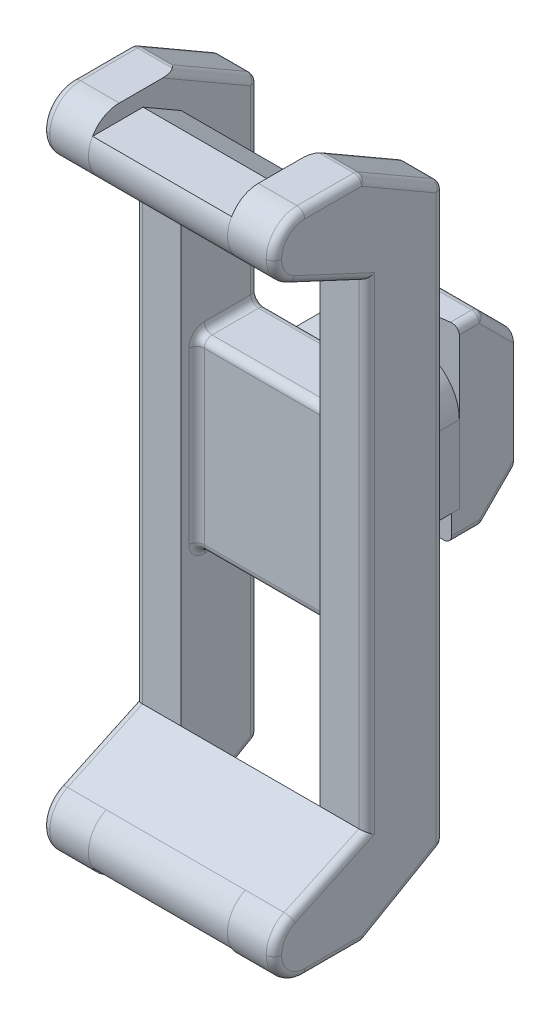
ISO-10303-21;
HEADER;
FILE_DESCRIPTION(('STEP AP214'),'2;1');
FILE_NAME('part.step','',(''),(''),'','','');
FILE_SCHEMA(('AUTOMOTIVE_DESIGN { 1 0 10303 214 1 1 1 1 }'));
ENDSEC;
DATA;
#1=APPLICATION_CONTEXT('core data for automotive mechanical design processes');
#2=APPLICATION_PROTOCOL_DEFINITION('international standard','automotive_design',2000,#1);
#3=PRODUCT_CONTEXT('',#1,'mechanical');
#4=PRODUCT('Part','Part','',(#3));
#5=PRODUCT_RELATED_PRODUCT_CATEGORY('part','',(#4));
#6=PRODUCT_DEFINITION_FORMATION('','',#4);
#7=PRODUCT_DEFINITION_CONTEXT('part definition',#1,'design');
#8=PRODUCT_DEFINITION('design','',#6,#7);
#9=PRODUCT_DEFINITION_SHAPE('','',#8);
#10=(LENGTH_UNIT() NAMED_UNIT(*) SI_UNIT(.MILLI.,.METRE.));
#11=(NAMED_UNIT(*) PLANE_ANGLE_UNIT() SI_UNIT($,.RADIAN.));
#12=(NAMED_UNIT(*) SI_UNIT($,.STERADIAN.) SOLID_ANGLE_UNIT());
#13=UNCERTAINTY_MEASURE_WITH_UNIT(LENGTH_MEASURE(1.E-05),#10,'distance_accuracy_value','');
#14=(GEOMETRIC_REPRESENTATION_CONTEXT(3) GLOBAL_UNCERTAINTY_ASSIGNED_CONTEXT((#13)) GLOBAL_UNIT_ASSIGNED_CONTEXT((#10,
#11,#12)) REPRESENTATION_CONTEXT('',''));
#15=CARTESIAN_POINT('',(0.,0.,0.));
#16=DIRECTION('',(0.,0.,1.));
#17=DIRECTION('',(1.,0.,0.));
#18=AXIS2_PLACEMENT_3D('',#15,#16,#17);
#19=CARTESIAN_POINT('',(-3.,4.64644660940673,-7.14644660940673));
#20=DIRECTION('',(0.,0.707106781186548,0.707106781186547));
#21=DIRECTION('',(0.,-0.707106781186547,0.707106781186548));
#22=AXIS2_PLACEMENT_3D('',#19,#20,#21);
#23=CYLINDRICAL_SURFACE('',#22,0.5);
#24=CARTESIAN_POINT('',(-3.5,3.29289321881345,-8.5));
#25=CARTESIAN_POINT('',(-3.5,3.48293601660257,-8.50000000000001));
#26=CARTESIAN_POINT('',(-3.44857478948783,3.65851266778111,-8.50000000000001));
#27=CARTESIAN_POINT('',(-3.35355339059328,3.79289321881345,-8.5));
#28=(BOUNDED_CURVE() B_SPLINE_CURVE(3,(#24,#25,#26,#27),.UNSPECIFIED.,.F.,
.F.) B_SPLINE_CURVE_WITH_KNOTS((4,4),(4.71238898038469,5.49778714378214),
.UNSPECIFIED.) CURVE() GEOMETRIC_REPRESENTATION_ITEM() RATIONAL_B_SPLINE_CURVE((1.,
0.949253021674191,0.949253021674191,1.)) REPRESENTATION_ITEM(''));
#29=CARTESIAN_POINT('',(-3.5,3.29289321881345,-8.5));
#30=VERTEX_POINT('',#29);
#31=CARTESIAN_POINT('',(-3.35355339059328,3.79289321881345,-8.5));
#32=VERTEX_POINT('',#31);
#33=EDGE_CURVE('P0_E274',#30,#32,#28,.T.);
#34=ORIENTED_EDGE('',*,*,#33,.F.);
#35=DIRECTION('',(0.,-0.707106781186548,-0.707106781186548));
#36=VECTOR('',#35,1.);
#37=CARTESIAN_POINT('',(-3.5,2.75338893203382,-9.03950428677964));
#38=LINE('',#37,#36);
#39=CARTESIAN_POINT('',(-3.5,5.49999999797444,-6.29289322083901));
#40=VERTEX_POINT('',#39);
#41=EDGE_CURVE('P0_E448',#40,#30,#38,.T.);
#42=ORIENTED_EDGE('',*,*,#41,.F.);
#43=CARTESIAN_POINT('',(-3.,5.49999999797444,-6.29289322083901));
#44=DIRECTION('',(0.,-0.707106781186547,-0.707106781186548));
#45=DIRECTION('',(0.,0.707106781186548,-0.707106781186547));
#46=AXIS2_PLACEMENT_3D('',#43,#44,#45);
#47=CIRCLE('',#46,0.5);
#48=CARTESIAN_POINT('',(-2.99999999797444,5.85355339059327,-6.64644660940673));
#49=VERTEX_POINT('',#48);
#50=EDGE_CURVE('P0_E11',#40,#49,#47,.T.);
#51=ORIENTED_EDGE('',*,*,#50,.T.);
#52=DIRECTION('',(0.,0.707106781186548,0.707106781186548));
#53=VECTOR('',#52,1.);
#54=CARTESIAN_POINT('',(-3.,5.,-7.5));
#55=LINE('',#54,#53);
#56=CARTESIAN_POINT('',(-3.,4.14644660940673,-8.35355339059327));
#57=VERTEX_POINT('',#56);
#58=EDGE_CURVE('P0_E301',#57,#49,#55,.T.);
#59=ORIENTED_EDGE('',*,*,#58,.F.);
#60=CARTESIAN_POINT('',(-3.,4.14644660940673,-8.35355339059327));
#61=CARTESIAN_POINT('',(-3.13438055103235,4.05142521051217,-8.44857478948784));
#62=CARTESIAN_POINT('',(-3.25853199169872,3.9272737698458,-8.50000000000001));
#63=CARTESIAN_POINT('',(-3.35355339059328,3.79289321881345,-8.5));
#64=(BOUNDED_CURVE() B_SPLINE_CURVE(3,(#60,#61,#62,#63),.UNSPECIFIED.,.F.,
.F.) B_SPLINE_CURVE_WITH_KNOTS((4,4),(4.71238898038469,5.49778714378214),
.UNSPECIFIED.) CURVE() GEOMETRIC_REPRESENTATION_ITEM() RATIONAL_B_SPLINE_CURVE((1.,
0.949253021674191,0.949253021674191,1.)) REPRESENTATION_ITEM(''));
#65=EDGE_CURVE('P0_E27',#57,#32,#64,.T.);
#66=ORIENTED_EDGE('',*,*,#65,.T.);
#67=EDGE_LOOP('',(#34,#42,#51,#59,#66));
#68=FACE_BOUND('',#67,.T.);
#69=ADVANCED_FACE('P0_F17',(#68),#23,.T.);
#70=CARTESIAN_POINT('',(-2.99999999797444,5.49999999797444,-6.29289322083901));
#71=DIRECTION('',(1.,0.,0.));
#72=DIRECTION('',(0.,0.707106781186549,0.707106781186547));
#73=AXIS2_PLACEMENT_3D('',#70,#71,#72);
#74=SPHERICAL_SURFACE('',#73,0.5);
#75=CARTESIAN_POINT('',(-2.99999999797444,5.49999999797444,-6.29289322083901));
#76=DIRECTION('',(0.,0.,1.));
#77=DIRECTION('',(-1.,0.,0.));
#78=AXIS2_PLACEMENT_3D('',#75,#76,#77);
#79=CIRCLE('',#78,0.500000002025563);
#80=CARTESIAN_POINT('',(-2.99999999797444,6.,-6.29289322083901));
#81=VERTEX_POINT('',#80);
#82=EDGE_CURVE('P0_E452',#81,#40,#79,.T.);
#83=ORIENTED_EDGE('',*,*,#82,.F.);
#84=CARTESIAN_POINT('',(-2.99999999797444,5.5,-6.29289321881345));
#85=DIRECTION('',(-1.,0.,0.));
#86=DIRECTION('',(0.,0.,1.));
#87=AXIS2_PLACEMENT_3D('',#84,#85,#86);
#88=CIRCLE('',#87,0.5);
#89=EDGE_CURVE('P0_E21',#81,#49,#88,.T.);
#90=ORIENTED_EDGE('',*,*,#89,.T.);
#91=ORIENTED_EDGE('',*,*,#50,.F.);
#92=EDGE_LOOP('',(#83,#90,#91));
#93=FACE_BOUND('',#92,.T.);
#94=ADVANCED_FACE('P0_F533',(#93),#74,.T.);
#95=CARTESIAN_POINT('',(3.5,3.79289321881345,-8.));
#96=DIRECTION('',(-1.,0.,0.));
#97=DIRECTION('',(0.,0.,1.));
#98=AXIS2_PLACEMENT_3D('',#95,#96,#97);
#99=CYLINDRICAL_SURFACE('',#98,0.5);
#100=CARTESIAN_POINT('',(3.,4.14644660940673,-8.35355339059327));
#101=CARTESIAN_POINT('',(3.13438055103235,4.05142521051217,-8.44857478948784));
#102=CARTESIAN_POINT('',(3.25853199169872,3.9272737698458,-8.49999999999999));
#103=CARTESIAN_POINT('',(3.35355339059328,3.79289321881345,-8.5));
#104=(BOUNDED_CURVE() B_SPLINE_CURVE(3,(#100,#101,#102,#103),.UNSPECIFIED.,.F.,
.F.) B_SPLINE_CURVE_WITH_KNOTS((4,4),(1.5707963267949,2.35619449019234),
.UNSPECIFIED.) CURVE() GEOMETRIC_REPRESENTATION_ITEM() RATIONAL_B_SPLINE_CURVE((1.,
0.949253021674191,0.949253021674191,1.)) REPRESENTATION_ITEM(''));
#105=CARTESIAN_POINT('',(3.,4.14644660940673,-8.35355339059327));
#106=VERTEX_POINT('',#105);
#107=CARTESIAN_POINT('',(3.35355339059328,3.79289321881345,-8.5));
#108=VERTEX_POINT('',#107);
#109=EDGE_CURVE('P0_E290',#106,#108,#104,.T.);
#110=ORIENTED_EDGE('',*,*,#109,.T.);
#111=DIRECTION('',(1.,0.,0.));
#112=VECTOR('',#111,1.);
#113=CARTESIAN_POINT('',(3.5,3.79289321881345,-8.5));
#114=LINE('',#113,#112);
#115=EDGE_CURVE('P0_E283',#32,#108,#114,.T.);
#116=ORIENTED_EDGE('',*,*,#115,.F.);
#117=ORIENTED_EDGE('',*,*,#65,.F.);
#118=DIRECTION('',(-1.,0.,0.));
#119=VECTOR('',#118,1.);
#120=CARTESIAN_POINT('',(3.5,4.14644660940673,-8.35355339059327));
#121=LINE('',#120,#119);
#122=EDGE_CURVE('P0_E428',#106,#57,#121,.T.);
#123=ORIENTED_EDGE('',*,*,#122,.F.);
#124=EDGE_LOOP('',(#110,#116,#117,#123));
#125=FACE_BOUND('',#124,.T.);
#126=ADVANCED_FACE('P0_F19',(#125),#99,.T.);
#127=CARTESIAN_POINT('',(3.5,5.5,-6.29289321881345));
#128=DIRECTION('',(-1.,0.,0.));
#129=DIRECTION('',(0.,0.,1.));
#130=AXIS2_PLACEMENT_3D('',#127,#128,#129);
#131=CYLINDRICAL_SURFACE('',#130,0.5);
#132=CARTESIAN_POINT('',(2.99999999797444,5.5,-6.29289322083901));
#133=DIRECTION('',(-1.,0.,0.));
#134=DIRECTION('',(0.,0.,1.));
#135=AXIS2_PLACEMENT_3D('',#132,#133,#134);
#136=CIRCLE('',#135,0.5);
#137=CARTESIAN_POINT('',(2.99999999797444,6.,-6.29289321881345));
#138=VERTEX_POINT('',#137);
#139=CARTESIAN_POINT('',(2.99999999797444,5.85355339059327,-6.64644660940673));
#140=VERTEX_POINT('',#139);
#141=EDGE_CURVE('P0_E212',#138,#140,#136,.T.);
#142=ORIENTED_EDGE('',*,*,#141,.T.);
#143=DIRECTION('',(1.,0.,0.));
#144=VECTOR('',#143,1.);
#145=CARTESIAN_POINT('',(3.5,5.85355339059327,-6.64644660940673));
#146=LINE('',#145,#144);
#147=EDGE_CURVE('P0_E296',#49,#140,#146,.T.);
#148=ORIENTED_EDGE('',*,*,#147,.F.);
#149=ORIENTED_EDGE('',*,*,#89,.F.);
#150=DIRECTION('',(-1.,0.,0.));
#151=VECTOR('',#150,1.);
#152=CARTESIAN_POINT('',(3.5,6.,-6.29289321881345));
#153=LINE('',#152,#151);
#154=EDGE_CURVE('P0_E413',#138,#81,#153,.T.);
#155=ORIENTED_EDGE('',*,*,#154,.F.);
#156=EDGE_LOOP('',(#142,#148,#149,#155));
#157=FACE_BOUND('',#156,.T.);
#158=ADVANCED_FACE('P0_F508',(#157),#131,.T.);
#159=CARTESIAN_POINT('',(3.,4.64644660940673,-7.14644660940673));
#160=DIRECTION('',(0.,0.707106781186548,0.707106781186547));
#161=DIRECTION('',(0.,-0.707106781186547,0.707106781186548));
#162=AXIS2_PLACEMENT_3D('',#159,#160,#161);
#163=CYLINDRICAL_SURFACE('',#162,0.5);
#164=DIRECTION('',(0.,0.707106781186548,0.707106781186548));
#165=VECTOR('',#164,1.);
#166=CARTESIAN_POINT('',(3.5,5.14644660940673,-6.64644660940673));
#167=LINE('',#166,#165);
#168=CARTESIAN_POINT('',(3.5,3.29289321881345,-8.5));
#169=VERTEX_POINT('',#168);
#170=CARTESIAN_POINT('',(3.5,5.49999999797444,-6.29289322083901));
#171=VERTEX_POINT('',#170);
#172=EDGE_CURVE('P0_E257',#169,#171,#167,.T.);
#173=ORIENTED_EDGE('',*,*,#172,.F.);
#174=CARTESIAN_POINT('',(3.35355339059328,3.79289321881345,-8.5));
#175=CARTESIAN_POINT('',(3.44857478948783,3.65851266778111,-8.50000000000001));
#176=CARTESIAN_POINT('',(3.5,3.48293601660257,-8.50000000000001));
#177=CARTESIAN_POINT('',(3.5,3.29289321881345,-8.5));
#178=(BOUNDED_CURVE() B_SPLINE_CURVE(3,(#174,#175,#176,#177),.UNSPECIFIED.,.F.,
.F.) B_SPLINE_CURVE_WITH_KNOTS((4,4),(0.785398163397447,1.5707963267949),
.UNSPECIFIED.) CURVE() GEOMETRIC_REPRESENTATION_ITEM() RATIONAL_B_SPLINE_CURVE((1.,
0.949253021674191,0.949253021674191,1.)) REPRESENTATION_ITEM(''));
#179=EDGE_CURVE('P0_E265',#108,#169,#178,.T.);
#180=ORIENTED_EDGE('',*,*,#179,.F.);
#181=ORIENTED_EDGE('',*,*,#109,.F.);
#182=DIRECTION('',(0.,-0.707106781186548,-0.707106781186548));
#183=VECTOR('',#182,1.);
#184=CARTESIAN_POINT('',(3.,4.,-8.5));
#185=LINE('',#184,#183);
#186=EDGE_CURVE('P0_E300',#140,#106,#185,.T.);
#187=ORIENTED_EDGE('',*,*,#186,.F.);
#188=CARTESIAN_POINT('',(2.99999999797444,5.49999999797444,-6.29289322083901));
#189=DIRECTION('',(0.,-0.707106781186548,-0.707106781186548));
#190=DIRECTION('',(0.,0.707106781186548,-0.707106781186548));
#191=AXIS2_PLACEMENT_3D('',#188,#189,#190);
#192=CIRCLE('',#191,0.5);
#193=EDGE_CURVE('P0_E41',#140,#171,#192,.T.);
#194=ORIENTED_EDGE('',*,*,#193,.T.);
#195=EDGE_LOOP('',(#173,#180,#181,#187,#194));
#196=FACE_BOUND('',#195,.T.);
#197=ADVANCED_FACE('P0_F512',(#196),#163,.T.);
#198=CARTESIAN_POINT('',(2.99999999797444,5.49999999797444,-6.29289322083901));
#199=DIRECTION('',(1.,0.,0.));
#200=DIRECTION('',(0.,0.707106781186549,0.707106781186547));
#201=AXIS2_PLACEMENT_3D('',#198,#199,#200);
#202=SPHERICAL_SURFACE('',#201,0.5);
#203=ORIENTED_EDGE('',*,*,#141,.F.);
#204=CARTESIAN_POINT('',(2.99999999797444,5.49999999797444,-6.29289322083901));
#205=DIRECTION('',(0.,0.,1.));
#206=DIRECTION('',(-1.,0.,0.));
#207=AXIS2_PLACEMENT_3D('',#204,#205,#206);
#208=CIRCLE('',#207,0.500000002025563);
#209=EDGE_CURVE('P0_E309',#171,#138,#208,.T.);
#210=ORIENTED_EDGE('',*,*,#209,.F.);
#211=ORIENTED_EDGE('',*,*,#193,.F.);
#212=EDGE_LOOP('',(#203,#210,#211));
#213=FACE_BOUND('',#212,.T.);
#214=ADVANCED_FACE('P0_F1064',(#213),#202,.T.);
#215=CARTESIAN_POINT('',(3.,-4.64644660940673,-7.14644660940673));
#216=DIRECTION('',(0.,0.707106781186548,-0.707106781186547));
#217=DIRECTION('',(0.,0.707106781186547,0.707106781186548));
#218=AXIS2_PLACEMENT_3D('',#215,#216,#217);
#219=CYLINDRICAL_SURFACE('',#218,0.5);
#220=CARTESIAN_POINT('',(3.5,-3.29289321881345,-8.5));
#221=CARTESIAN_POINT('',(3.5,-3.48293601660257,-8.50000000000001));
#222=CARTESIAN_POINT('',(3.44857478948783,-3.65851266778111,-8.50000000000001));
#223=CARTESIAN_POINT('',(3.35355339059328,-3.79289321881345,-8.5));
#224=(BOUNDED_CURVE() B_SPLINE_CURVE(3,(#220,#221,#222,#223),.UNSPECIFIED.,.F.,
.F.) B_SPLINE_CURVE_WITH_KNOTS((4,4),(1.5707963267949,2.35619449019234),
.UNSPECIFIED.) CURVE() GEOMETRIC_REPRESENTATION_ITEM() RATIONAL_B_SPLINE_CURVE((1.,
0.949253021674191,0.949253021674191,1.)) REPRESENTATION_ITEM(''));
#225=CARTESIAN_POINT('',(3.5,-3.29289321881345,-8.5));
#226=VERTEX_POINT('',#225);
#227=CARTESIAN_POINT('',(3.35355339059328,-3.79289321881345,-8.5));
#228=VERTEX_POINT('',#227);
#229=EDGE_CURVE('P0_E231',#226,#228,#224,.T.);
#230=ORIENTED_EDGE('',*,*,#229,.F.);
#231=DIRECTION('',(0.,0.707106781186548,-0.707106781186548));
#232=VECTOR('',#231,1.);
#233=CARTESIAN_POINT('',(3.5,-3.64644660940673,-8.14644660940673));
#234=LINE('',#233,#232);
#235=CARTESIAN_POINT('',(3.5,-5.49999999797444,-6.29289322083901));
#236=VERTEX_POINT('',#235);
#237=EDGE_CURVE('P0_E228',#236,#226,#234,.T.);
#238=ORIENTED_EDGE('',*,*,#237,.F.);
#239=CARTESIAN_POINT('',(3.,-5.49999999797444,-6.29289322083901));
#240=DIRECTION('',(0.,0.707106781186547,-0.707106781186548));
#241=DIRECTION('',(0.,0.707106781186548,0.707106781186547));
#242=AXIS2_PLACEMENT_3D('',#239,#240,#241);
#243=CIRCLE('',#242,0.5);
#244=CARTESIAN_POINT('',(2.99999999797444,-5.85355339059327,-6.64644660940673));
#245=VERTEX_POINT('',#244);
#246=EDGE_CURVE('P0_E201',#236,#245,#243,.T.);
#247=ORIENTED_EDGE('',*,*,#246,.T.);
#248=DIRECTION('',(0.,-0.707106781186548,0.707106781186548));
#249=VECTOR('',#248,1.);
#250=CARTESIAN_POINT('',(3.,-5.5,-7.));
#251=LINE('',#250,#249);
#252=CARTESIAN_POINT('',(3.,-4.14644660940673,-8.35355339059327));
#253=VERTEX_POINT('',#252);
#254=EDGE_CURVE('P0_E474',#253,#245,#251,.T.);
#255=ORIENTED_EDGE('',*,*,#254,.F.);
#256=CARTESIAN_POINT('',(3.,-4.14644660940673,-8.35355339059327));
#257=CARTESIAN_POINT('',(3.13438055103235,-4.05142521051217,-8.44857478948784));
#258=CARTESIAN_POINT('',(3.25853199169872,-3.9272737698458,-8.49999999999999));
#259=CARTESIAN_POINT('',(3.35355339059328,-3.79289321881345,-8.5));
#260=(BOUNDED_CURVE() B_SPLINE_CURVE(3,(#256,#257,#258,#259),.UNSPECIFIED.,.F.,
.F.) B_SPLINE_CURVE_WITH_KNOTS((4,4),(1.5707963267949,2.35619449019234),
.UNSPECIFIED.) CURVE() GEOMETRIC_REPRESENTATION_ITEM() RATIONAL_B_SPLINE_CURVE((1.,
0.949253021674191,0.949253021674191,1.)) REPRESENTATION_ITEM(''));
#261=EDGE_CURVE('P0_E213',#253,#228,#260,.T.);
#262=ORIENTED_EDGE('',*,*,#261,.T.);
#263=EDGE_LOOP('',(#230,#238,#247,#255,#262));
#264=FACE_BOUND('',#263,.T.);
#265=ADVANCED_FACE('P0_F229',(#264),#219,.T.);
#266=CARTESIAN_POINT('',(2.99999999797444,-5.49999999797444,-6.29289322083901));
#267=DIRECTION('',(1.,0.,0.));
#268=DIRECTION('',(0.,0.707106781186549,-0.707106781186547));
#269=AXIS2_PLACEMENT_3D('',#266,#267,#268);
#270=SPHERICAL_SURFACE('',#269,0.5);
#271=CARTESIAN_POINT('',(2.99999999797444,-5.49999999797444,-6.29289322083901));
#272=DIRECTION('',(0.,0.,1.));
#273=DIRECTION('',(-1.,0.,0.));
#274=AXIS2_PLACEMENT_3D('',#271,#272,#273);
#275=CIRCLE('',#274,0.500000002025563);
#276=CARTESIAN_POINT('',(2.99999999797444,-6.,-6.29289322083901));
#277=VERTEX_POINT('',#276);
#278=EDGE_CURVE('P0_E204',#277,#236,#275,.T.);
#279=ORIENTED_EDGE('',*,*,#278,.F.);
#280=CARTESIAN_POINT('',(2.99999999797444,-5.5,-6.29289321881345));
#281=DIRECTION('',(1.,0.,0.));
#282=DIRECTION('',(0.,0.,-1.));
#283=AXIS2_PLACEMENT_3D('',#280,#281,#282);
#284=CIRCLE('',#283,0.5);
#285=EDGE_CURVE('P0_E206',#277,#245,#284,.T.);
#286=ORIENTED_EDGE('',*,*,#285,.T.);
#287=ORIENTED_EDGE('',*,*,#246,.F.);
#288=EDGE_LOOP('',(#279,#286,#287));
#289=FACE_BOUND('',#288,.T.);
#290=ADVANCED_FACE('P0_F203',(#289),#270,.T.);
#291=CARTESIAN_POINT('',(3.5,-3.79289321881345,-8.));
#292=DIRECTION('',(-1.,0.,0.));
#293=DIRECTION('',(0.,0.,1.));
#294=AXIS2_PLACEMENT_3D('',#291,#292,#293);
#295=CYLINDRICAL_SURFACE('',#294,0.5);
#296=CARTESIAN_POINT('',(-3.,-4.14644660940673,-8.35355339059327));
#297=CARTESIAN_POINT('',(-3.13438055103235,-4.05142521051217,-8.44857478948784));
#298=CARTESIAN_POINT('',(-3.25853199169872,-3.9272737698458,-8.50000000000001));
#299=CARTESIAN_POINT('',(-3.35355339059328,-3.79289321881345,-8.5));
#300=(BOUNDED_CURVE() B_SPLINE_CURVE(3,(#296,#297,#298,#299),.UNSPECIFIED.,.F.,
.F.) B_SPLINE_CURVE_WITH_KNOTS((4,4),(4.71238898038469,5.49778714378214),
.UNSPECIFIED.) CURVE() GEOMETRIC_REPRESENTATION_ITEM() RATIONAL_B_SPLINE_CURVE((1.,
0.949253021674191,0.949253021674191,1.)) REPRESENTATION_ITEM(''));
#301=CARTESIAN_POINT('',(-3.,-4.14644660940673,-8.35355339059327));
#302=VERTEX_POINT('',#301);
#303=CARTESIAN_POINT('',(-3.35355339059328,-3.79289321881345,-8.5));
#304=VERTEX_POINT('',#303);
#305=EDGE_CURVE('P0_E354',#302,#304,#300,.T.);
#306=ORIENTED_EDGE('',*,*,#305,.T.);
#307=DIRECTION('',(-1.,0.,0.));
#308=VECTOR('',#307,1.);
#309=CARTESIAN_POINT('',(3.5,-3.79289321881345,-8.5));
#310=LINE('',#309,#308);
#311=EDGE_CURVE('P0_E273',#228,#304,#310,.T.);
#312=ORIENTED_EDGE('',*,*,#311,.F.);
#313=ORIENTED_EDGE('',*,*,#261,.F.);
#314=DIRECTION('',(1.,0.,0.));
#315=VECTOR('',#314,1.);
#316=CARTESIAN_POINT('',(3.5,-4.14644660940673,-8.35355339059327));
#317=LINE('',#316,#315);
#318=EDGE_CURVE('P0_E467',#302,#253,#317,.T.);
#319=ORIENTED_EDGE('',*,*,#318,.F.);
#320=EDGE_LOOP('',(#306,#312,#313,#319));
#321=FACE_BOUND('',#320,.T.);
#322=ADVANCED_FACE('P0_F1034',(#321),#295,.T.);
#323=CARTESIAN_POINT('',(3.5,-5.5,-6.29289321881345));
#324=DIRECTION('',(-1.,0.,0.));
#325=DIRECTION('',(0.,0.,1.));
#326=AXIS2_PLACEMENT_3D('',#323,#324,#325);
#327=CYLINDRICAL_SURFACE('',#326,0.5);
#328=CARTESIAN_POINT('',(-2.99999999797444,-5.5,-6.29289322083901));
#329=DIRECTION('',(1.,0.,0.));
#330=DIRECTION('',(0.,0.,-1.));
#331=AXIS2_PLACEMENT_3D('',#328,#329,#330);
#332=CIRCLE('',#331,0.5);
#333=CARTESIAN_POINT('',(-2.99999999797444,-6.,-6.29289321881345));
#334=VERTEX_POINT('',#333);
#335=CARTESIAN_POINT('',(-2.99999999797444,-5.85355339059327,-6.64644660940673));
#336=VERTEX_POINT('',#335);
#337=EDGE_CURVE('P0_E355',#334,#336,#332,.T.);
#338=ORIENTED_EDGE('',*,*,#337,.T.);
#339=DIRECTION('',(-1.,0.,0.));
#340=VECTOR('',#339,1.);
#341=CARTESIAN_POINT('',(3.5,-5.85355339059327,-6.64644660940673));
#342=LINE('',#341,#340);
#343=EDGE_CURVE('P0_E478',#245,#336,#342,.T.);
#344=ORIENTED_EDGE('',*,*,#343,.F.);
#345=ORIENTED_EDGE('',*,*,#285,.F.);
#346=DIRECTION('',(1.,0.,0.));
#347=VECTOR('',#346,1.);
#348=CARTESIAN_POINT('',(3.5,-6.,-6.29289321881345));
#349=LINE('',#348,#347);
#350=EDGE_CURVE('P0_E462',#334,#277,#349,.T.);
#351=ORIENTED_EDGE('',*,*,#350,.F.);
#352=EDGE_LOOP('',(#338,#344,#345,#351));
#353=FACE_BOUND('',#352,.T.);
#354=ADVANCED_FACE('P0_F1023',(#353),#327,.T.);
#355=CARTESIAN_POINT('',(-3.,-4.64644660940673,-7.14644660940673));
#356=DIRECTION('',(0.,0.707106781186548,-0.707106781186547));
#357=DIRECTION('',(0.,0.707106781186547,0.707106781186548));
#358=AXIS2_PLACEMENT_3D('',#355,#356,#357);
#359=CYLINDRICAL_SURFACE('',#358,0.5);
#360=DIRECTION('',(0.,-0.707106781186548,0.707106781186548));
#361=VECTOR('',#360,1.);
#362=CARTESIAN_POINT('',(-3.5,-2.75338893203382,-9.03950428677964));
#363=LINE('',#362,#361);
#364=CARTESIAN_POINT('',(-3.5,-3.29289321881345,-8.5));
#365=VERTEX_POINT('',#364);
#366=CARTESIAN_POINT('',(-3.5,-5.49999999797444,-6.29289322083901));
#367=VERTEX_POINT('',#366);
#368=EDGE_CURVE('P0_E304',#365,#367,#363,.T.);
#369=ORIENTED_EDGE('',*,*,#368,.F.);
#370=CARTESIAN_POINT('',(-3.35355339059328,-3.79289321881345,-8.5));
#371=CARTESIAN_POINT('',(-3.44857478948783,-3.65851266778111,-8.49999999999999));
#372=CARTESIAN_POINT('',(-3.5,-3.48293601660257,-8.49999999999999));
#373=CARTESIAN_POINT('',(-3.5,-3.29289321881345,-8.5));
#374=(BOUNDED_CURVE() B_SPLINE_CURVE(3,(#370,#371,#372,#373),.UNSPECIFIED.,.F.,
.F.) B_SPLINE_CURVE_WITH_KNOTS((4,4),(3.92699081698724,4.71238898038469),
.UNSPECIFIED.) CURVE() GEOMETRIC_REPRESENTATION_ITEM() RATIONAL_B_SPLINE_CURVE((1.,
0.949253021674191,0.949253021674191,1.)) REPRESENTATION_ITEM(''));
#375=EDGE_CURVE('P0_E312',#304,#365,#374,.T.);
#376=ORIENTED_EDGE('',*,*,#375,.F.);
#377=ORIENTED_EDGE('',*,*,#305,.F.);
#378=DIRECTION('',(0.,0.707106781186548,-0.707106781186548));
#379=VECTOR('',#378,1.);
#380=CARTESIAN_POINT('',(-3.,-5.,-7.5));
#381=LINE('',#380,#379);
#382=EDGE_CURVE('P0_E225',#336,#302,#381,.T.);
#383=ORIENTED_EDGE('',*,*,#382,.F.);
#384=CARTESIAN_POINT('',(-2.99999999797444,-5.49999999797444,-6.29289322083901));
#385=DIRECTION('',(0.,0.707106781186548,-0.707106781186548));
#386=DIRECTION('',(0.,0.707106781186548,0.707106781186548));
#387=AXIS2_PLACEMENT_3D('',#384,#385,#386);
#388=CIRCLE('',#387,0.5);
#389=EDGE_CURVE('P0_E351',#336,#367,#388,.T.);
#390=ORIENTED_EDGE('',*,*,#389,.T.);
#391=EDGE_LOOP('',(#369,#376,#377,#383,#390));
#392=FACE_BOUND('',#391,.T.);
#393=ADVANCED_FACE('P0_F1012',(#392),#359,.T.);
#394=CARTESIAN_POINT('',(-2.99999999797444,-5.49999999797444,-6.29289322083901));
#395=DIRECTION('',(1.,0.,0.));
#396=DIRECTION('',(0.,0.707106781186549,-0.707106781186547));
#397=AXIS2_PLACEMENT_3D('',#394,#395,#396);
#398=SPHERICAL_SURFACE('',#397,0.5);
#399=ORIENTED_EDGE('',*,*,#337,.F.);
#400=CARTESIAN_POINT('',(-2.99999999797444,-5.49999999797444,-6.29289322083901));
#401=DIRECTION('',(0.,0.,1.));
#402=DIRECTION('',(-1.,0.,0.));
#403=AXIS2_PLACEMENT_3D('',#400,#401,#402);
#404=CIRCLE('',#403,0.500000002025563);
#405=EDGE_CURVE('P0_E455',#367,#334,#404,.T.);
#406=ORIENTED_EDGE('',*,*,#405,.F.);
#407=ORIENTED_EDGE('',*,*,#389,.F.);
#408=EDGE_LOOP('',(#399,#406,#407));
#409=FACE_BOUND('',#408,.T.);
#410=ADVANCED_FACE('P0_F916',(#409),#398,.T.);
#411=CARTESIAN_POINT('',(-2.99999999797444,5.49999999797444,-4.5));
#412=DIRECTION('',(0.,0.,-1.));
#413=DIRECTION('',(-1.,4.05112747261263E-09,0.));
#414=AXIS2_PLACEMENT_3D('',#411,#412,#413);
#415=CYLINDRICAL_SURFACE('',#414,0.500000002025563);
#416=DIRECTION('',(0.,0.,1.));
#417=VECTOR('',#416,1.);
#418=CARTESIAN_POINT('',(-2.99999999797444,6.,-5.5));
#419=LINE('',#418,#417);
#420=CARTESIAN_POINT('',(-3.,6.,-4.5));
#421=VERTEX_POINT('',#420);
#422=EDGE_CURVE('P0_E417',#81,#421,#419,.T.);
#423=ORIENTED_EDGE('',*,*,#422,.F.);
#424=ORIENTED_EDGE('',*,*,#82,.T.);
#425=DIRECTION('',(0.,0.,1.));
#426=VECTOR('',#425,1.);
#427=CARTESIAN_POINT('',(-3.5,5.49999999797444,-6.5));
#428=LINE('',#427,#426);
#429=CARTESIAN_POINT('',(-3.5,5.5,-4.5));
#430=VERTEX_POINT('',#429);
#431=EDGE_CURVE('P0_E444',#40,#430,#428,.T.);
#432=ORIENTED_EDGE('',*,*,#431,.T.);
#433=CARTESIAN_POINT('',(-2.99999999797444,5.49999999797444,-4.5));
#434=DIRECTION('',(0.,0.,1.));
#435=DIRECTION('',(-1.,4.05112747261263E-09,0.));
#436=AXIS2_PLACEMENT_3D('',#433,#434,#435);
#437=CIRCLE('',#436,0.500000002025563);
#438=EDGE_CURVE('P0_E224',#421,#430,#437,.T.);
#439=ORIENTED_EDGE('',*,*,#438,.F.);
#440=EDGE_LOOP('',(#423,#424,#432,#439));
#441=FACE_BOUND('',#440,.T.);
#442=ADVANCED_FACE('P0_F530',(#441),#415,.T.);
#443=CARTESIAN_POINT('',(3.5,5.,-7.5));
#444=DIRECTION('',(0.,0.707106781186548,-0.707106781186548));
#445=DIRECTION('',(-1.,0.,0.));
#446=AXIS2_PLACEMENT_3D('',#443,#444,#445);
#447=PLANE('',#446);
#448=ORIENTED_EDGE('',*,*,#122,.T.);
#449=ORIENTED_EDGE('',*,*,#58,.T.);
#450=ORIENTED_EDGE('',*,*,#147,.T.);
#451=ORIENTED_EDGE('',*,*,#186,.T.);
#452=EDGE_LOOP('',(#448,#449,#450,#451));
#453=FACE_BOUND('',#452,.T.);
#454=ADVANCED_FACE('P0_F516',(#453),#447,.T.);
#455=CARTESIAN_POINT('',(3.5,0.,-4.5));
#456=DIRECTION('',(0.,0.,1.));
#457=DIRECTION('',(1.,0.,0.));
#458=AXIS2_PLACEMENT_3D('',#455,#456,#457);
#459=PLANE('',#458);
#460=ORIENTED_EDGE('',*,*,#438,.T.);
#461=DIRECTION('',(0.,-1.,0.));
#462=VECTOR('',#461,1.);
#463=CARTESIAN_POINT('',(-3.5,-6.,-4.5));
#464=LINE('',#463,#462);
#465=CARTESIAN_POINT('',(-3.5,0.,-4.5));
#466=VERTEX_POINT('',#465);
#467=EDGE_CURVE('P0_E434',#430,#466,#464,.T.);
#468=ORIENTED_EDGE('',*,*,#467,.T.);
#469=DIRECTION('',(1.,0.,0.));
#470=VECTOR('',#469,1.);
#471=CARTESIAN_POINT('',(0.816941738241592,0.,-4.5));
#472=LINE('',#471,#470);
#473=CARTESIAN_POINT('',(0.,0.,-4.5));
#474=VERTEX_POINT('',#473);
#475=EDGE_CURVE('P0_E376',#466,#474,#472,.T.);
#476=ORIENTED_EDGE('',*,*,#475,.T.);
#477=DIRECTION('',(0.,1.,0.));
#478=VECTOR('',#477,1.);
#479=CARTESIAN_POINT('',(0.,0.,-4.5));
#480=LINE('',#479,#478);
#481=CARTESIAN_POINT('',(0.,6.,-4.5));
#482=VERTEX_POINT('',#481);
#483=EDGE_CURVE('P0_E372',#474,#482,#480,.T.);
#484=ORIENTED_EDGE('',*,*,#483,.T.);
#485=DIRECTION('',(-1.,0.,0.));
#486=VECTOR('',#485,1.);
#487=CARTESIAN_POINT('',(3.5,6.,-4.5));
#488=LINE('',#487,#486);
#489=EDGE_CURVE('P0_E421',#482,#421,#488,.T.);
#490=ORIENTED_EDGE('',*,*,#489,.T.);
#491=EDGE_LOOP('',(#460,#468,#476,#484,#490));
#492=FACE_BOUND('',#491,.T.);
#493=ADVANCED_FACE('P0_F881',(#492),#459,.T.);
#494=CARTESIAN_POINT('',(2.99999999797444,-5.49999999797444,-4.5));
#495=DIRECTION('',(0.,0.,-1.));
#496=DIRECTION('',(1.,-4.05112747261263E-09,0.));
#497=AXIS2_PLACEMENT_3D('',#494,#495,#496);
#498=CYLINDRICAL_SURFACE('',#497,0.500000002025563);
#499=DIRECTION('',(0.,0.,1.));
#500=VECTOR('',#499,1.);
#501=CARTESIAN_POINT('',(2.99999999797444,-6.,-5.5));
#502=LINE('',#501,#500);
#503=CARTESIAN_POINT('',(3.,-6.,-4.5));
#504=VERTEX_POINT('',#503);
#505=EDGE_CURVE('P0_E221',#277,#504,#502,.T.);
#506=ORIENTED_EDGE('',*,*,#505,.F.);
#507=ORIENTED_EDGE('',*,*,#278,.T.);
#508=DIRECTION('',(0.,0.,1.));
#509=VECTOR('',#508,1.);
#510=CARTESIAN_POINT('',(3.5,-5.49999999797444,-6.5));
#511=LINE('',#510,#509);
#512=CARTESIAN_POINT('',(3.5,-5.5,-4.5));
#513=VERTEX_POINT('',#512);
#514=EDGE_CURVE('P0_E220',#236,#513,#511,.T.);
#515=ORIENTED_EDGE('',*,*,#514,.T.);
#516=CARTESIAN_POINT('',(2.99999999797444,-5.49999999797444,-4.5));
#517=DIRECTION('',(0.,0.,1.));
#518=DIRECTION('',(1.,-4.05112747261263E-09,0.));
#519=AXIS2_PLACEMENT_3D('',#516,#517,#518);
#520=CIRCLE('',#519,0.500000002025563);
#521=EDGE_CURVE('P0_E261',#504,#513,#520,.T.);
#522=ORIENTED_EDGE('',*,*,#521,.F.);
#523=EDGE_LOOP('',(#506,#507,#515,#522));
#524=FACE_BOUND('',#523,.T.);
#525=ADVANCED_FACE('P0_F217',(#524),#498,.T.);
#526=CARTESIAN_POINT('',(3.5,-5.,-7.5));
#527=DIRECTION('',(0.,-0.707106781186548,-0.707106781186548));
#528=DIRECTION('',(0.,-0.707106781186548,0.707106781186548));
#529=AXIS2_PLACEMENT_3D('',#526,#527,#528);
#530=PLANE('',#529);
#531=ORIENTED_EDGE('',*,*,#318,.T.);
#532=ORIENTED_EDGE('',*,*,#254,.T.);
#533=ORIENTED_EDGE('',*,*,#343,.T.);
#534=ORIENTED_EDGE('',*,*,#382,.T.);
#535=EDGE_LOOP('',(#531,#532,#533,#534));
#536=FACE_BOUND('',#535,.T.);
#537=ADVANCED_FACE('P0_F862',(#536),#530,.T.);
#538=CARTESIAN_POINT('',(3.5,-6.,-5.5));
#539=DIRECTION('',(0.,-1.,0.));
#540=DIRECTION('',(0.,0.,-1.));
#541=AXIS2_PLACEMENT_3D('',#538,#539,#540);
#542=PLANE('',#541);
#543=DIRECTION('',(0.,0.,1.));
#544=VECTOR('',#543,1.);
#545=CARTESIAN_POINT('',(-2.99999999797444,-6.,-5.5));
#546=LINE('',#545,#544);
#547=CARTESIAN_POINT('',(-3.,-6.,-4.92857142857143));
#548=VERTEX_POINT('',#547);
#549=EDGE_CURVE('P0_E459',#334,#548,#546,.T.);
#550=ORIENTED_EDGE('',*,*,#549,.F.);
#551=ORIENTED_EDGE('',*,*,#350,.T.);
#552=ORIENTED_EDGE('',*,*,#505,.T.);
#553=DIRECTION('',(-1.,0.,0.));
#554=VECTOR('',#553,1.);
#555=CARTESIAN_POINT('',(3.5,-6.,-4.5));
#556=LINE('',#555,#554);
#557=CARTESIAN_POINT('',(0.,-6.,-4.5));
#558=VERTEX_POINT('',#557);
#559=EDGE_CURVE('P0_E346',#504,#558,#556,.T.);
#560=ORIENTED_EDGE('',*,*,#559,.T.);
#561=DIRECTION('',(-0.989949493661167,0.,-0.14142135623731));
#562=VECTOR('',#561,1.);
#563=CARTESIAN_POINT('',(0.77,-6.,-4.39));
#564=LINE('',#563,#562);
#565=EDGE_CURVE('P0_E399',#558,#548,#564,.T.);
#566=ORIENTED_EDGE('',*,*,#565,.T.);
#567=EDGE_LOOP('',(#550,#551,#552,#560,#566));
#568=FACE_BOUND('',#567,.T.);
#569=ADVANCED_FACE('P0_F819',(#568),#542,.T.);
#570=CARTESIAN_POINT('',(-2.99999999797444,-5.49999999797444,-4.5));
#571=DIRECTION('',(0.,0.,-1.));
#572=DIRECTION('',(-4.05112660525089E-09,-1.,0.));
#573=AXIS2_PLACEMENT_3D('',#570,#571,#572);
#574=CYLINDRICAL_SURFACE('',#573,0.500000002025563);
#575=DIRECTION('',(0.,0.,1.));
#576=VECTOR('',#575,1.);
#577=CARTESIAN_POINT('',(-3.5,-5.49999999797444,-6.5));
#578=LINE('',#577,#576);
#579=CARTESIAN_POINT('',(-3.5,-5.5,-5.));
#580=VERTEX_POINT('',#579);
#581=EDGE_CURVE('P0_E308',#367,#580,#578,.T.);
#582=ORIENTED_EDGE('',*,*,#581,.F.);
#583=ORIENTED_EDGE('',*,*,#405,.T.);
#584=ORIENTED_EDGE('',*,*,#549,.T.);
#585=CARTESIAN_POINT('',(-3.5,-5.5,-5.));
#586=CARTESIAN_POINT('',(-3.49999999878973,-5.79289321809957,-4.9999999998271));
#587=CARTESIAN_POINT('',(-3.29289321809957,-5.99999999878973,-4.97041331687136));
#588=CARTESIAN_POINT('',(-3.,-6.,-4.92857142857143));
#589=(BOUNDED_CURVE() B_SPLINE_CURVE(3,(#585,#586,#587,#588),.UNSPECIFIED.,.F.,
.F.) B_SPLINE_CURVE_WITH_KNOTS((4,4),(8.10224728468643E-09,1.57079632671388),
.UNSPECIFIED.) CURVE() GEOMETRIC_REPRESENTATION_ITEM() RATIONAL_B_SPLINE_CURVE((1.,
0.804737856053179,0.804737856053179,1.)) REPRESENTATION_ITEM(''));
#590=EDGE_CURVE('P0_E394',#580,#548,#589,.T.);
#591=ORIENTED_EDGE('',*,*,#590,.F.);
#592=EDGE_LOOP('',(#582,#583,#584,#591));
#593=FACE_BOUND('',#592,.T.);
#594=ADVANCED_FACE('P0_F814',(#593),#574,.T.);
#595=CARTESIAN_POINT('',(-3.5,0.,-6.28611535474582));
#596=DIRECTION('',(-1.,0.,0.));
#597=DIRECTION('',(0.,0.,1.));
#598=AXIS2_PLACEMENT_3D('',#595,#596,#597);
#599=PLANE('',#598);
#600=DIRECTION('',(0.,1.,0.));
#601=VECTOR('',#600,1.);
#602=CARTESIAN_POINT('',(-3.5,4.,-8.5));
#603=LINE('',#602,#601);
#604=EDGE_CURVE('P0_E284',#365,#30,#603,.T.);
#605=ORIENTED_EDGE('',*,*,#604,.F.);
#606=ORIENTED_EDGE('',*,*,#368,.T.);
#607=ORIENTED_EDGE('',*,*,#581,.T.);
#608=DIRECTION('',(0.,1.,0.));
#609=VECTOR('',#608,1.);
#610=CARTESIAN_POINT('',(-3.5,0.,-5.));
#611=LINE('',#610,#609);
#612=CARTESIAN_POINT('',(-3.5,0.,-5.));
#613=VERTEX_POINT('',#612);
#614=EDGE_CURVE('P0_E407',#580,#613,#611,.T.);
#615=ORIENTED_EDGE('',*,*,#614,.T.);
#616=DIRECTION('',(0.,0.,1.));
#617=VECTOR('',#616,1.);
#618=CARTESIAN_POINT('',(-3.5,0.,-5.4599994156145));
#619=LINE('',#618,#617);
#620=EDGE_CURVE('P0_E380',#613,#466,#619,.T.);
#621=ORIENTED_EDGE('',*,*,#620,.T.);
#622=ORIENTED_EDGE('',*,*,#467,.F.);
#623=ORIENTED_EDGE('',*,*,#431,.F.);
#624=ORIENTED_EDGE('',*,*,#41,.T.);
#625=EDGE_LOOP('',(#605,#606,#607,#615,#621,#622,#623,#624));
#626=FACE_BOUND('',#625,.T.);
#627=ADVANCED_FACE('P0_F525',(#626),#599,.T.);
#628=CARTESIAN_POINT('',(2.99999999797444,5.49999999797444,-4.5));
#629=DIRECTION('',(0.,0.,-1.));
#630=DIRECTION('',(4.05112660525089E-09,1.,0.));
#631=AXIS2_PLACEMENT_3D('',#628,#629,#630);
#632=CYLINDRICAL_SURFACE('',#631,0.500000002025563);
#633=DIRECTION('',(0.,0.,1.));
#634=VECTOR('',#633,1.);
#635=CARTESIAN_POINT('',(3.5,5.49999999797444,-6.5));
#636=LINE('',#635,#634);
#637=CARTESIAN_POINT('',(3.5,5.5,-5.));
#638=VERTEX_POINT('',#637);
#639=EDGE_CURVE('P0_E253',#171,#638,#636,.T.);
#640=ORIENTED_EDGE('',*,*,#639,.F.);
#641=ORIENTED_EDGE('',*,*,#209,.T.);
#642=DIRECTION('',(0.,0.,1.));
#643=VECTOR('',#642,1.);
#644=CARTESIAN_POINT('',(2.99999999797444,6.,-5.5));
#645=LINE('',#644,#643);
#646=CARTESIAN_POINT('',(3.,6.,-4.92857142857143));
#647=VERTEX_POINT('',#646);
#648=EDGE_CURVE('P0_E410',#138,#647,#645,.T.);
#649=ORIENTED_EDGE('',*,*,#648,.T.);
#650=CARTESIAN_POINT('',(3.5,5.5,-5.));
#651=CARTESIAN_POINT('',(3.49999999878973,5.79289321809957,-4.9999999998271));
#652=CARTESIAN_POINT('',(3.29289321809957,5.99999999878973,-4.97041331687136));
#653=CARTESIAN_POINT('',(3.,6.,-4.92857142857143));
#654=(BOUNDED_CURVE() B_SPLINE_CURVE(3,(#650,#651,#652,#653),.UNSPECIFIED.,.F.,
.F.) B_SPLINE_CURVE_WITH_KNOTS((4,4),(8.10224728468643E-09,1.57079632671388),
.UNSPECIFIED.) CURVE() GEOMETRIC_REPRESENTATION_ITEM() RATIONAL_B_SPLINE_CURVE((1.,
0.804737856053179,0.804737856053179,1.)) REPRESENTATION_ITEM(''));
#655=EDGE_CURVE('P0_E359',#638,#647,#654,.T.);
#656=ORIENTED_EDGE('',*,*,#655,.F.);
#657=EDGE_LOOP('',(#640,#641,#649,#656));
#658=FACE_BOUND('',#657,.T.);
#659=ADVANCED_FACE('P0_F945',(#658),#632,.T.);
#660=CARTESIAN_POINT('',(3.5,6.,-5.5));
#661=DIRECTION('',(0.,1.,0.));
#662=DIRECTION('',(1.,0.,0.));
#663=AXIS2_PLACEMENT_3D('',#660,#661,#662);
#664=PLANE('',#663);
#665=ORIENTED_EDGE('',*,*,#648,.F.);
#666=ORIENTED_EDGE('',*,*,#154,.T.);
#667=ORIENTED_EDGE('',*,*,#422,.T.);
#668=ORIENTED_EDGE('',*,*,#489,.F.);
#669=DIRECTION('',(0.989949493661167,0.,-0.14142135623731));
#670=VECTOR('',#669,1.);
#671=CARTESIAN_POINT('',(2.66,6.,-4.88));
#672=LINE('',#671,#670);
#673=EDGE_CURVE('P0_E365',#482,#647,#672,.T.);
#674=ORIENTED_EDGE('',*,*,#673,.T.);
#675=EDGE_LOOP('',(#665,#666,#667,#668,#674));
#676=FACE_BOUND('',#675,.T.);
#677=ADVANCED_FACE('P0_F841',(#676),#664,.T.);
#678=CARTESIAN_POINT('',(-1.75,0.,-4.75));
#679=DIRECTION('',(0.14142135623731,0.,-0.989949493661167));
#680=DIRECTION('',(0.,-1.,0.));
#681=AXIS2_PLACEMENT_3D('',#678,#679,#680);
#682=PLANE('',#681);
#683=ORIENTED_EDGE('',*,*,#590,.T.);
#684=ORIENTED_EDGE('',*,*,#565,.F.);
#685=DIRECTION('',(0.,-1.,0.));
#686=VECTOR('',#685,1.);
#687=CARTESIAN_POINT('',(0.,0.,-4.5));
#688=LINE('',#687,#686);
#689=EDGE_CURVE('P0_E342',#474,#558,#688,.T.);
#690=ORIENTED_EDGE('',*,*,#689,.F.);
#691=DIRECTION('',(0.989949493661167,0.,0.14142135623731));
#692=VECTOR('',#691,1.);
#693=CARTESIAN_POINT('',(-3.5,0.,-5.));
#694=LINE('',#693,#692);
#695=EDGE_CURVE('P0_E391',#613,#474,#694,.T.);
#696=ORIENTED_EDGE('',*,*,#695,.F.);
#697=ORIENTED_EDGE('',*,*,#614,.F.);
#698=EDGE_LOOP('',(#683,#684,#690,#696,#697));
#699=FACE_BOUND('',#698,.T.);
#700=ADVANCED_FACE('P0_F836',(#699),#682,.F.);
#701=CARTESIAN_POINT('',(-1.86611652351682,0.,-4.63388347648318));
#702=DIRECTION('',(0.,-1.,0.));
#703=DIRECTION('',(0.,0.,-1.));
#704=AXIS2_PLACEMENT_3D('',#701,#702,#703);
#705=PLANE('',#704);
#706=ORIENTED_EDGE('',*,*,#475,.F.);
#707=ORIENTED_EDGE('',*,*,#620,.F.);
#708=ORIENTED_EDGE('',*,*,#695,.T.);
#709=EDGE_LOOP('',(#706,#707,#708));
#710=FACE_BOUND('',#709,.T.);
#711=ADVANCED_FACE('P0_F840',(#710),#705,.T.);
#712=CARTESIAN_POINT('',(1.75,0.,-4.75));
#713=DIRECTION('',(-0.14142135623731,0.,-0.989949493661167));
#714=DIRECTION('',(-0.989949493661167,0.,0.14142135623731));
#715=AXIS2_PLACEMENT_3D('',#712,#713,#714);
#716=PLANE('',#715);
#717=ORIENTED_EDGE('',*,*,#655,.T.);
#718=ORIENTED_EDGE('',*,*,#673,.F.);
#719=ORIENTED_EDGE('',*,*,#483,.F.);
#720=DIRECTION('',(-0.989949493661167,0.,0.14142135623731));
#721=VECTOR('',#720,1.);
#722=CARTESIAN_POINT('',(3.5,0.,-5.));
#723=LINE('',#722,#721);
#724=CARTESIAN_POINT('',(3.5,0.,-5.));
#725=VERTEX_POINT('',#724);
#726=EDGE_CURVE('P0_E350',#725,#474,#723,.T.);
#727=ORIENTED_EDGE('',*,*,#726,.F.);
#728=DIRECTION('',(0.,-1.,0.));
#729=VECTOR('',#728,1.);
#730=CARTESIAN_POINT('',(3.5,0.,-5.));
#731=LINE('',#730,#729);
#732=EDGE_CURVE('P0_E249',#638,#725,#731,.T.);
#733=ORIENTED_EDGE('',*,*,#732,.F.);
#734=EDGE_LOOP('',(#717,#718,#719,#727,#733));
#735=FACE_BOUND('',#734,.T.);
#736=ADVANCED_FACE('P0_F892',(#735),#716,.F.);
#737=CARTESIAN_POINT('',(1.86611652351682,0.,-4.63388347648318));
#738=DIRECTION('',(0.,1.,0.));
#739=DIRECTION('',(1.,0.,0.));
#740=AXIS2_PLACEMENT_3D('',#737,#738,#739);
#741=PLANE('',#740);
#742=DIRECTION('',(-1.,0.,0.));
#743=VECTOR('',#742,1.);
#744=CARTESIAN_POINT('',(2.68305826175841,0.,-4.5));
#745=LINE('',#744,#743);
#746=CARTESIAN_POINT('',(3.5,0.,-4.5));
#747=VERTEX_POINT('',#746);
#748=EDGE_CURVE('P0_E264',#747,#474,#745,.T.);
#749=ORIENTED_EDGE('',*,*,#748,.F.);
#750=DIRECTION('',(0.,0.,1.));
#751=VECTOR('',#750,1.);
#752=CARTESIAN_POINT('',(3.5,0.,-5.4599994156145));
#753=LINE('',#752,#751);
#754=EDGE_CURVE('P0_E252',#725,#747,#753,.T.);
#755=ORIENTED_EDGE('',*,*,#754,.F.);
#756=ORIENTED_EDGE('',*,*,#726,.T.);
#757=EDGE_LOOP('',(#749,#755,#756));
#758=FACE_BOUND('',#757,.T.);
#759=ADVANCED_FACE('P0_F873',(#758),#741,.T.);
#760=CARTESIAN_POINT('',(3.5,0.,-4.5));
#761=DIRECTION('',(0.,0.,1.));
#762=DIRECTION('',(1.,0.,0.));
#763=AXIS2_PLACEMENT_3D('',#760,#761,#762);
#764=PLANE('',#763);
#765=ORIENTED_EDGE('',*,*,#521,.T.);
#766=DIRECTION('',(0.,1.,0.));
#767=VECTOR('',#766,1.);
#768=CARTESIAN_POINT('',(3.5,-6.,-4.5));
#769=LINE('',#768,#767);
#770=EDGE_CURVE('P0_E242',#513,#747,#769,.T.);
#771=ORIENTED_EDGE('',*,*,#770,.T.);
#772=ORIENTED_EDGE('',*,*,#748,.T.);
#773=ORIENTED_EDGE('',*,*,#689,.T.);
#774=ORIENTED_EDGE('',*,*,#559,.F.);
#775=EDGE_LOOP('',(#765,#771,#772,#773,#774));
#776=FACE_BOUND('',#775,.T.);
#777=ADVANCED_FACE('P0_F852',(#776),#764,.T.);
#778=CARTESIAN_POINT('',(3.5,0.,-8.5));
#779=DIRECTION('',(0.,0.,-1.));
#780=DIRECTION('',(0.,-1.,0.));
#781=AXIS2_PLACEMENT_3D('',#778,#779,#780);
#782=PLANE('',#781);
#783=DIRECTION('',(0.,-1.,0.));
#784=VECTOR('',#783,1.);
#785=CARTESIAN_POINT('',(3.5,4.,-8.5));
#786=LINE('',#785,#784);
#787=EDGE_CURVE('P0_E236',#169,#226,#786,.T.);
#788=ORIENTED_EDGE('',*,*,#787,.T.);
#789=ORIENTED_EDGE('',*,*,#229,.T.);
#790=ORIENTED_EDGE('',*,*,#311,.T.);
#791=ORIENTED_EDGE('',*,*,#375,.T.);
#792=ORIENTED_EDGE('',*,*,#604,.T.);
#793=ORIENTED_EDGE('',*,*,#33,.T.);
#794=ORIENTED_EDGE('',*,*,#115,.T.);
#795=ORIENTED_EDGE('',*,*,#179,.T.);
#796=EDGE_LOOP('',(#788,#789,#790,#791,#792,#793,#794,#795));
#797=FACE_BOUND('',#796,.T.);
#798=ADVANCED_FACE('P0_F521',(#797),#782,.T.);
#799=CARTESIAN_POINT('',(3.5,0.,-6.28611535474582));
#800=DIRECTION('',(-1.,0.,0.));
#801=DIRECTION('',(0.,0.,1.));
#802=AXIS2_PLACEMENT_3D('',#799,#800,#801);
#803=PLANE('',#802);
#804=ORIENTED_EDGE('',*,*,#514,.F.);
#805=ORIENTED_EDGE('',*,*,#237,.T.);
#806=ORIENTED_EDGE('',*,*,#787,.F.);
#807=ORIENTED_EDGE('',*,*,#172,.T.);
#808=ORIENTED_EDGE('',*,*,#639,.T.);
#809=ORIENTED_EDGE('',*,*,#732,.T.);
#810=ORIENTED_EDGE('',*,*,#754,.T.);
#811=ORIENTED_EDGE('',*,*,#770,.F.);
#812=EDGE_LOOP('',(#804,#805,#806,#807,#808,#809,#810,#811));
#813=FACE_BOUND('',#812,.T.);
#814=ADVANCED_FACE('P0_F239',(#813),#803,.F.);
#815=CLOSED_SHELL('',(#69,#94,#126,#158,#197,#214,#265,#290,#322,#354,#393,#410,#442,#454,#493,
#525,#537,#569,#594,#627,#659,#677,#700,#711,#736,#759,#777,#798,#814));
#816=MANIFOLD_SOLID_BREP('P0_B1',#815);
#817=CARTESIAN_POINT('',(1.41789398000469E-08,-0.749999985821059,-0.5));
#818=DIRECTION('',(0.,0.,-1.));
#819=DIRECTION('',(-1.,0.,0.));
#820=AXIS2_PLACEMENT_3D('',#817,#818,#819);
#821=TOROIDAL_SURFACE('',#820,4.00000001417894,0.5);
#822=CARTESIAN_POINT('',(-4.,-0.750000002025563,-0.5));
#823=DIRECTION('',(-4.05112597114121E-09,1.,0.));
#824=DIRECTION('',(-1.,-4.05112597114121E-09,0.));
#825=AXIS2_PLACEMENT_3D('',#822,#823,#824);
#826=CIRCLE('',#825,0.5);
#827=CARTESIAN_POINT('',(-4.,-0.750000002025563,0.));
#828=VERTEX_POINT('',#827);
#829=CARTESIAN_POINT('',(-3.5,-0.75,-0.5));
#830=VERTEX_POINT('',#829);
#831=EDGE_CURVE('P1_E25',#828,#830,#826,.T.);
#832=ORIENTED_EDGE('',*,*,#831,.T.);
#833=CARTESIAN_POINT('',(1.41789398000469E-08,-0.749999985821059,-0.5));
#834=DIRECTION('',(0.,0.,-1.));
#835=DIRECTION('',(-1.,0.,0.));
#836=AXIS2_PLACEMENT_3D('',#833,#834,#835);
#837=CIRCLE('',#836,3.50000001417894);
#838=CARTESIAN_POINT('',(0.,-4.25,-0.5));
#839=VERTEX_POINT('',#838);
#840=EDGE_CURVE('P1_E1055',#839,#830,#837,.T.);
#841=ORIENTED_EDGE('',*,*,#840,.F.);
#842=CARTESIAN_POINT('',(0.,-4.75,-0.5));
#843=DIRECTION('',(1.,0.,4.05112576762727E-09));
#844=DIRECTION('',(4.05112576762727E-09,0.,-1.));
#845=AXIS2_PLACEMENT_3D('',#842,#843,#844);
#846=CIRCLE('',#845,0.5);
#847=CARTESIAN_POINT('',(-2.02556332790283E-09,-4.75,0.));
#848=VERTEX_POINT('',#847);
#849=EDGE_CURVE('P1_E10',#839,#848,#846,.T.);
#850=ORIENTED_EDGE('',*,*,#849,.T.);
#851=CARTESIAN_POINT('',(1.41789398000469E-08,-0.749999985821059,0.));
#852=DIRECTION('',(0.,0.,1.));
#853=DIRECTION('',(-1.,0.,0.));
#854=AXIS2_PLACEMENT_3D('',#851,#852,#853);
#855=CIRCLE('',#854,4.00000001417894);
#856=EDGE_CURVE('P1_E887',#828,#848,#855,.T.);
#857=ORIENTED_EDGE('',*,*,#856,.F.);
#858=EDGE_LOOP('',(#832,#841,#850,#857));
#859=FACE_BOUND('',#858,.T.);
#860=ADVANCED_FACE('P1_F16',(#859),#821,.F.);
#861=CARTESIAN_POINT('',(-4.5,-4.75,-0.5));
#862=DIRECTION('',(-1.,0.,0.));
#863=DIRECTION('',(0.,0.,1.));
#864=AXIS2_PLACEMENT_3D('',#861,#862,#863);
#865=CYLINDRICAL_SURFACE('',#864,0.5);
#866=CARTESIAN_POINT('',(3.5,-4.25,-0.5));
#867=CARTESIAN_POINT('',(3.5,-4.25,-0.207106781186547));
#868=CARTESIAN_POINT('',(3.70710678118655,-4.45710678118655,0.));
#869=CARTESIAN_POINT('',(4.,-4.75,0.));
#870=(BOUNDED_CURVE() B_SPLINE_CURVE(3,(#866,#867,#868,#869),.UNSPECIFIED.,.F.,
.F.) B_SPLINE_CURVE_WITH_KNOTS((4,4),(0.,1.5707963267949),
.UNSPECIFIED.) CURVE() GEOMETRIC_REPRESENTATION_ITEM() RATIONAL_B_SPLINE_CURVE((1.,
0.804737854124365,0.804737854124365,1.)) REPRESENTATION_ITEM(''));
#871=CARTESIAN_POINT('',(3.5,-4.25,-0.5));
#872=VERTEX_POINT('',#871);
#873=CARTESIAN_POINT('',(4.,-4.75,0.));
#874=VERTEX_POINT('',#873);
#875=EDGE_CURVE('P1_E1296',#872,#874,#870,.T.);
#876=ORIENTED_EDGE('',*,*,#875,.T.);
#877=DIRECTION('',(1.,0.,0.));
#878=VECTOR('',#877,1.);
#879=CARTESIAN_POINT('',(3.5,-4.75,0.));
#880=LINE('',#879,#878);
#881=EDGE_CURVE('P1_E891',#848,#874,#880,.T.);
#882=ORIENTED_EDGE('',*,*,#881,.F.);
#883=ORIENTED_EDGE('',*,*,#849,.F.);
#884=DIRECTION('',(-1.,0.,0.));
#885=VECTOR('',#884,1.);
#886=CARTESIAN_POINT('',(0.,-4.25,-0.5));
#887=LINE('',#886,#885);
#888=EDGE_CURVE('P1_E1058',#872,#839,#887,.T.);
#889=ORIENTED_EDGE('',*,*,#888,.F.);
#890=EDGE_LOOP('',(#876,#882,#883,#889));
#891=FACE_BOUND('',#890,.T.);
#892=ADVANCED_FACE('P1_F18',(#891),#865,.F.);
#893=CARTESIAN_POINT('',(-4.,5.00000041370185E-09,-0.5));
#894=DIRECTION('',(0.,1.,0.));
#895=DIRECTION('',(0.,0.,1.));
#896=AXIS2_PLACEMENT_3D('',#893,#894,#895);
#897=CYLINDRICAL_SURFACE('',#896,0.5);
#898=CARTESIAN_POINT('',(-4.,4.75,0.));
#899=CARTESIAN_POINT('',(-3.70710678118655,4.45710678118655,0.));
#900=CARTESIAN_POINT('',(-3.5,4.25,-0.207106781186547));
#901=CARTESIAN_POINT('',(-3.5,4.25,-0.5));
#902=(BOUNDED_CURVE() B_SPLINE_CURVE(3,(#898,#899,#900,#901),.UNSPECIFIED.,.F.,
.F.) B_SPLINE_CURVE_WITH_KNOTS((4,4),(4.71238898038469,6.28318530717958),
.UNSPECIFIED.) CURVE() GEOMETRIC_REPRESENTATION_ITEM() RATIONAL_B_SPLINE_CURVE((1.,
0.804737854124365,0.804737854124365,1.)) REPRESENTATION_ITEM(''));
#903=CARTESIAN_POINT('',(-4.,4.75,0.));
#904=VERTEX_POINT('',#903);
#905=CARTESIAN_POINT('',(-3.5,4.25,-0.5));
#906=VERTEX_POINT('',#905);
#907=EDGE_CURVE('P1_E1291',#904,#906,#902,.T.);
#908=ORIENTED_EDGE('',*,*,#907,.T.);
#909=DIRECTION('',(0.,1.,0.));
#910=VECTOR('',#909,1.);
#911=CARTESIAN_POINT('',(-3.5,4.25,-0.5));
#912=LINE('',#911,#910);
#913=EDGE_CURVE('P1_E1050',#830,#906,#912,.T.);
#914=ORIENTED_EDGE('',*,*,#913,.F.);
#915=ORIENTED_EDGE('',*,*,#831,.F.);
#916=DIRECTION('',(0.,-1.,0.));
#917=VECTOR('',#916,1.);
#918=CARTESIAN_POINT('',(-4.,-0.75,0.));
#919=LINE('',#918,#917);
#920=EDGE_CURVE('P1_E883',#904,#828,#919,.T.);
#921=ORIENTED_EDGE('',*,*,#920,.F.);
#922=EDGE_LOOP('',(#908,#914,#915,#921));
#923=FACE_BOUND('',#922,.T.);
#924=ADVANCED_FACE('P1_F4141',(#923),#897,.F.);
#925=CARTESIAN_POINT('',(4.,5.00000041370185E-09,-0.5));
#926=DIRECTION('',(0.,-1.,0.));
#927=DIRECTION('',(0.,0.,-1.));
#928=AXIS2_PLACEMENT_3D('',#925,#926,#927);
#929=CYLINDRICAL_SURFACE('',#928,0.5);
#930=CARTESIAN_POINT('',(4.,0.750000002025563,-0.5));
#931=DIRECTION('',(-4.05112683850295E-09,1.,0.));
#932=DIRECTION('',(-1.,-4.05112683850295E-09,0.));
#933=AXIS2_PLACEMENT_3D('',#930,#931,#932);
#934=CIRCLE('',#933,0.5);
#935=CARTESIAN_POINT('',(3.5,0.75,-0.5));
#936=VERTEX_POINT('',#935);
#937=CARTESIAN_POINT('',(4.,0.750000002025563,0.));
#938=VERTEX_POINT('',#937);
#939=EDGE_CURVE('P1_E767',#936,#938,#934,.T.);
#940=ORIENTED_EDGE('',*,*,#939,.T.);
#941=DIRECTION('',(0.,1.,0.));
#942=VECTOR('',#941,1.);
#943=CARTESIAN_POINT('',(4.,0.75,0.));
#944=LINE('',#943,#942);
#945=EDGE_CURVE('P1_E895',#874,#938,#944,.T.);
#946=ORIENTED_EDGE('',*,*,#945,.F.);
#947=ORIENTED_EDGE('',*,*,#875,.F.);
#948=DIRECTION('',(0.,-1.,0.));
#949=VECTOR('',#948,1.);
#950=CARTESIAN_POINT('',(3.5,-4.25,-0.5));
#951=LINE('',#950,#949);
#952=EDGE_CURVE('P1_E1025',#936,#872,#951,.T.);
#953=ORIENTED_EDGE('',*,*,#952,.F.);
#954=EDGE_LOOP('',(#940,#946,#947,#953));
#955=FACE_BOUND('',#954,.T.);
#956=ADVANCED_FACE('P1_F4136',(#955),#929,.F.);
#957=CARTESIAN_POINT('',(-4.5,4.75,-0.5));
#958=DIRECTION('',(1.,0.,0.));
#959=DIRECTION('',(0.,0.,-1.));
#960=AXIS2_PLACEMENT_3D('',#957,#958,#959);
#961=CYLINDRICAL_SURFACE('',#960,0.5);
#962=CARTESIAN_POINT('',(0.,4.75,-0.5));
#963=DIRECTION('',(1.,0.,0.));
#964=DIRECTION('',(0.,1.,0.));
#965=AXIS2_PLACEMENT_3D('',#962,#963,#964);
#966=CIRCLE('',#965,0.5);
#967=CARTESIAN_POINT('',(0.,4.75,0.));
#968=VERTEX_POINT('',#967);
#969=CARTESIAN_POINT('',(0.,4.25,-0.5));
#970=VERTEX_POINT('',#969);
#971=EDGE_CURVE('P1_E770',#968,#970,#966,.T.);
#972=ORIENTED_EDGE('',*,*,#971,.T.);
#973=DIRECTION('',(1.,0.,0.));
#974=VECTOR('',#973,1.);
#975=CARTESIAN_POINT('',(0.,4.25,-0.5));
#976=LINE('',#975,#974);
#977=EDGE_CURVE('P1_E1045',#906,#970,#976,.T.);
#978=ORIENTED_EDGE('',*,*,#977,.F.);
#979=ORIENTED_EDGE('',*,*,#907,.F.);
#980=DIRECTION('',(-1.,0.,0.));
#981=VECTOR('',#980,1.);
#982=CARTESIAN_POINT('',(-3.5,4.75,0.));
#983=LINE('',#982,#981);
#984=EDGE_CURVE('P1_E903',#968,#904,#983,.T.);
#985=ORIENTED_EDGE('',*,*,#984,.F.);
#986=EDGE_LOOP('',(#972,#978,#979,#985));
#987=FACE_BOUND('',#986,.T.);
#988=ADVANCED_FACE('P1_F4140',(#987),#961,.F.);
#989=CARTESIAN_POINT('',(-1.41789437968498E-08,0.749999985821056,-0.5));
#990=DIRECTION('',(0.,0.,-1.));
#991=DIRECTION('',(-1.,0.,0.));
#992=AXIS2_PLACEMENT_3D('',#989,#990,#991);
#993=TOROIDAL_SURFACE('',#992,4.00000001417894,0.5);
#994=ORIENTED_EDGE('',*,*,#939,.F.);
#995=CARTESIAN_POINT('',(-1.41789437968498E-08,0.749999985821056,-0.5));
#996=DIRECTION('',(0.,0.,-1.));
#997=DIRECTION('',(-1.,0.,0.));
#998=AXIS2_PLACEMENT_3D('',#995,#996,#997);
#999=CIRCLE('',#998,3.50000001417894);
#1000=EDGE_CURVE('P1_E1037',#970,#936,#999,.T.);
#1001=ORIENTED_EDGE('',*,*,#1000,.F.);
#1002=ORIENTED_EDGE('',*,*,#971,.F.);
#1003=CARTESIAN_POINT('',(-1.41789437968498E-08,0.749999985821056,0.));
#1004=DIRECTION('',(0.,0.,1.));
#1005=DIRECTION('',(-1.,0.,0.));
#1006=AXIS2_PLACEMENT_3D('',#1003,#1004,#1005);
#1007=CIRCLE('',#1006,4.00000001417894);
#1008=EDGE_CURVE('P1_E899',#938,#968,#1007,.T.);
#1009=ORIENTED_EDGE('',*,*,#1008,.F.);
#1010=EDGE_LOOP('',(#994,#1001,#1002,#1009));
#1011=FACE_BOUND('',#1010,.T.);
#1012=ADVANCED_FACE('P1_F4244',(#1011),#993,.F.);
#1013=CARTESIAN_POINT('',(-7.,-18.2094684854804,0.5));
#1014=DIRECTION('',(0.,1.,0.));
#1015=DIRECTION('',(1.,0.,0.));
#1016=AXIS2_PLACEMENT_3D('',#1013,#1014,#1015);
#1017=SPHERICAL_SURFACE('',#1016,0.5);
#1018=CARTESIAN_POINT('',(-7.,-18.2094684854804,0.5));
#1019=DIRECTION('',(0.,-0.500000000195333,0.866025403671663));
#1020=DIRECTION('',(0.,0.866025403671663,0.500000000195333));
#1021=AXIS2_PLACEMENT_3D('',#1018,#1019,#1020);
#1022=CIRCLE('',#1021,0.5);
#1023=CARTESIAN_POINT('',(-7.5,-18.2094684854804,0.5));
#1024=VERTEX_POINT('',#1023);
#1025=CARTESIAN_POINT('',(-7.,-18.6424811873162,0.249999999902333));
#1026=VERTEX_POINT('',#1025);
#1027=EDGE_CURVE('P1_E1011',#1024,#1026,#1022,.T.);
#1028=ORIENTED_EDGE('',*,*,#1027,.F.);
#1029=CARTESIAN_POINT('',(-7.,-18.2094684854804,0.5));
#1030=DIRECTION('',(0.,1.,0.));
#1031=DIRECTION('',(0.,0.,1.));
#1032=AXIS2_PLACEMENT_3D('',#1029,#1030,#1031);
#1033=CIRCLE('',#1032,0.5);
#1034=CARTESIAN_POINT('',(-7.,-18.2094684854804,0.));
#1035=VERTEX_POINT('',#1034);
#1036=EDGE_CURVE('P1_E1007',#1035,#1024,#1033,.T.);
#1037=ORIENTED_EDGE('',*,*,#1036,.F.);
#1038=CARTESIAN_POINT('',(-7.,-18.2094684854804,0.5));
#1039=DIRECTION('',(-1.,0.,0.));
#1040=DIRECTION('',(0.,0.,1.));
#1041=AXIS2_PLACEMENT_3D('',#1038,#1039,#1040);
#1042=CIRCLE('',#1041,0.5);
#1043=EDGE_CURVE('P1_E771',#1035,#1026,#1042,.T.);
#1044=ORIENTED_EDGE('',*,*,#1043,.T.);
#1045=EDGE_LOOP('',(#1028,#1037,#1044));
#1046=FACE_BOUND('',#1045,.T.);
#1047=ADVANCED_FACE('P1_F3935',(#1046),#1017,.T.);
#1048=CARTESIAN_POINT('',(-4.5,-18.2094684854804,0.5));
#1049=DIRECTION('',(-1.,0.,0.));
#1050=DIRECTION('',(0.,0.,1.));
#1051=AXIS2_PLACEMENT_3D('',#1048,#1049,#1050);
#1052=CYLINDRICAL_SURFACE('',#1051,0.5);
#1053=CARTESIAN_POINT('',(-5.,-18.2094684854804,0.5));
#1054=DIRECTION('',(-1.,0.,0.));
#1055=DIRECTION('',(0.,0.,-1.));
#1056=AXIS2_PLACEMENT_3D('',#1053,#1054,#1055);
#1057=CIRCLE('',#1056,0.5);
#1058=CARTESIAN_POINT('',(-5.,-18.2094684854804,0.));
#1059=VERTEX_POINT('',#1058);
#1060=CARTESIAN_POINT('',(-5.,-18.6424811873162,0.249999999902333));
#1061=VERTEX_POINT('',#1060);
#1062=EDGE_CURVE('P1_E1113',#1059,#1061,#1057,.T.);
#1063=ORIENTED_EDGE('',*,*,#1062,.T.);
#1064=DIRECTION('',(1.,0.,0.));
#1065=VECTOR('',#1064,1.);
#1066=CARTESIAN_POINT('',(-4.5,-18.6424811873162,0.249999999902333));
#1067=LINE('',#1066,#1065);
#1068=EDGE_CURVE('P1_E914',#1026,#1061,#1067,.T.);
#1069=ORIENTED_EDGE('',*,*,#1068,.F.);
#1070=ORIENTED_EDGE('',*,*,#1043,.F.);
#1071=DIRECTION('',(-1.,0.,0.));
#1072=VECTOR('',#1071,1.);
#1073=CARTESIAN_POINT('',(-4.5,-18.2094684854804,0.));
#1074=LINE('',#1073,#1072);
#1075=EDGE_CURVE('P1_E879',#1059,#1035,#1074,.T.);
#1076=ORIENTED_EDGE('',*,*,#1075,.F.);
#1077=EDGE_LOOP('',(#1063,#1069,#1070,#1076));
#1078=FACE_BOUND('',#1077,.T.);
#1079=ADVANCED_FACE('P1_F3930',(#1078),#1052,.T.);
#1080=CARTESIAN_POINT('',(-5.,-18.2094684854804,0.5));
#1081=DIRECTION('',(0.,1.,0.));
#1082=DIRECTION('',(0.,0.,-1.));
#1083=AXIS2_PLACEMENT_3D('',#1080,#1081,#1082);
#1084=SPHERICAL_SURFACE('',#1083,0.5);
#1085=CARTESIAN_POINT('',(-5.,-18.2094684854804,0.5));
#1086=DIRECTION('',(0.,-1.,0.));
#1087=DIRECTION('',(0.,0.,-1.));
#1088=AXIS2_PLACEMENT_3D('',#1085,#1086,#1087);
#1089=CIRCLE('',#1088,0.5);
#1090=CARTESIAN_POINT('',(-4.5,-18.2094684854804,0.5));
#1091=VERTEX_POINT('',#1090);
#1092=EDGE_CURVE('P1_E1110',#1059,#1091,#1089,.T.);
#1093=ORIENTED_EDGE('',*,*,#1092,.T.);
#1094=CARTESIAN_POINT('',(-5.,-18.2094684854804,0.5));
#1095=DIRECTION('',(0.,0.500000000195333,-0.866025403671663));
#1096=DIRECTION('',(0.,0.866025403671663,0.500000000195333));
#1097=AXIS2_PLACEMENT_3D('',#1094,#1095,#1096);
#1098=CIRCLE('',#1097,0.5);
#1099=EDGE_CURVE('P1_E961',#1091,#1061,#1098,.T.);
#1100=ORIENTED_EDGE('',*,*,#1099,.T.);
#1101=ORIENTED_EDGE('',*,*,#1062,.F.);
#1102=EDGE_LOOP('',(#1093,#1100,#1101));
#1103=FACE_BOUND('',#1102,.T.);
#1104=ADVANCED_FACE('P1_F3934',(#1103),#1084,.T.);
#1105=CARTESIAN_POINT('',(-5.,5.00000041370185E-09,0.5));
#1106=DIRECTION('',(0.,1.,0.));
#1107=DIRECTION('',(0.,0.,1.));
#1108=AXIS2_PLACEMENT_3D('',#1105,#1106,#1107);
#1109=CYLINDRICAL_SURFACE('',#1108,0.5);
#1110=CARTESIAN_POINT('',(-5.,-6.5,0.5));
#1111=DIRECTION('',(0.,-1.,0.));
#1112=DIRECTION('',(0.,0.,-1.));
#1113=AXIS2_PLACEMENT_3D('',#1110,#1111,#1112);
#1114=CIRCLE('',#1113,0.5);
#1115=CARTESIAN_POINT('',(-5.,-6.5,0.));
#1116=VERTEX_POINT('',#1115);
#1117=CARTESIAN_POINT('',(-4.5,-6.5,0.5));
#1118=VERTEX_POINT('',#1117);
#1119=EDGE_CURVE('P1_E958',#1116,#1118,#1114,.T.);
#1120=ORIENTED_EDGE('',*,*,#1119,.T.);
#1121=DIRECTION('',(0.,1.,0.));
#1122=VECTOR('',#1121,1.);
#1123=CARTESIAN_POINT('',(-4.5,-6.5,0.5));
#1124=LINE('',#1123,#1122);
#1125=EDGE_CURVE('P1_E756',#1091,#1118,#1124,.T.);
#1126=ORIENTED_EDGE('',*,*,#1125,.F.);
#1127=ORIENTED_EDGE('',*,*,#1092,.F.);
#1128=DIRECTION('',(0.,-1.,0.));
#1129=VECTOR('',#1128,1.);
#1130=CARTESIAN_POINT('',(-5.,-18.49814362,0.));
#1131=LINE('',#1130,#1129);
#1132=EDGE_CURVE('P1_E875',#1116,#1059,#1131,.T.);
#1133=ORIENTED_EDGE('',*,*,#1132,.F.);
#1134=EDGE_LOOP('',(#1120,#1126,#1127,#1133));
#1135=FACE_BOUND('',#1134,.T.);
#1136=ADVANCED_FACE('P1_F4084',(#1135),#1109,.T.);
#1137=CARTESIAN_POINT('',(-5.,-19.5651309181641,2.84807621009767));
#1138=DIRECTION('',(0.,0.500000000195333,-0.866025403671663));
#1139=DIRECTION('',(0.,0.866025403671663,0.500000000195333));
#1140=AXIS2_PLACEMENT_3D('',#1137,#1138,#1139);
#1141=CYLINDRICAL_SURFACE('',#1140,0.5);
#1142=CARTESIAN_POINT('',(-4.74999999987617,-21.49814362,5.330127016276));
#1143=CARTESIAN_POINT('',(-4.8264512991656,-21.4981436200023,5.24184865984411));
#1144=CARTESIAN_POINT('',(-4.91172164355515,-21.4752955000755,5.15657831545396));
#1145=CARTESIAN_POINT('',(-5.,-21.4311563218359,5.08012701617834));
#1146=(BOUNDED_CURVE() B_SPLINE_CURVE(3,(#1142,#1143,#1144,#1145),.UNSPECIFIED.,.F.,
.F.) B_SPLINE_CURVE_WITH_KNOTS((4,4),(4.18879020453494,4.71238898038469),
.UNSPECIFIED.) CURVE() GEOMETRIC_REPRESENTATION_ITEM() RATIONAL_B_SPLINE_CURVE((1.,
0.977283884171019,0.977283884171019,1.)) REPRESENTATION_ITEM(''));
#1147=CARTESIAN_POINT('',(-4.74999999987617,-21.49814362,5.330127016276));
#1148=VERTEX_POINT('',#1147);
#1149=CARTESIAN_POINT('',(-5.,-21.4311563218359,5.08012701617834));
#1150=VERTEX_POINT('',#1149);
#1151=EDGE_CURVE('P1_E962',#1148,#1150,#1146,.T.);
#1152=ORIENTED_EDGE('',*,*,#1151,.T.);
#1153=DIRECTION('',(0.,-0.500000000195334,0.866025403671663));
#1154=VECTOR('',#1153,1.);
#1155=CARTESIAN_POINT('',(-5.,-21.49814362,5.19615242));
#1156=LINE('',#1155,#1154);
#1157=EDGE_CURVE('P1_E918',#1061,#1150,#1156,.T.);
#1158=ORIENTED_EDGE('',*,*,#1157,.F.);
#1159=ORIENTED_EDGE('',*,*,#1099,.F.);
#1160=DIRECTION('',(0.,0.500000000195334,-0.866025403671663));
#1161=VECTOR('',#1160,1.);
#1162=CARTESIAN_POINT('',(-4.5,-18.0651309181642,0.250000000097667));
#1163=LINE('',#1162,#1161);
#1164=CARTESIAN_POINT('',(-4.5,-21.49814362,6.19615241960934));
#1165=VERTEX_POINT('',#1164);
#1166=EDGE_CURVE('P1_E755',#1165,#1091,#1163,.T.);
#1167=ORIENTED_EDGE('',*,*,#1166,.F.);
#1168=CARTESIAN_POINT('',(-4.74999999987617,-21.49814362,5.330127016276));
#1169=CARTESIAN_POINT('',(-4.59150635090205,-21.49814362,5.5131397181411));
#1170=CARTESIAN_POINT('',(-4.5,-21.49814362,5.83012701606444));
#1171=CARTESIAN_POINT('',(-4.5,-21.49814362,6.19615241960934));
#1172=(BOUNDED_CURVE() B_SPLINE_CURVE(3,(#1168,#1169,#1170,#1171),.UNSPECIFIED.,.F.,
.F.) B_SPLINE_CURVE_WITH_KNOTS((4,4),(0.523598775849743,1.5707963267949),
.UNSPECIFIED.) CURVE() GEOMETRIC_REPRESENTATION_ITEM() RATIONAL_B_SPLINE_CURVE((1.,
0.910683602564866,0.910683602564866,1.)) REPRESENTATION_ITEM(''));
#1173=EDGE_CURVE('P1_E930',#1148,#1165,#1172,.T.);
#1174=ORIENTED_EDGE('',*,*,#1173,.F.);
#1175=EDGE_LOOP('',(#1152,#1158,#1159,#1167,#1174));
#1176=FACE_BOUND('',#1175,.T.);
#1177=ADVANCED_FACE('P1_F3868',(#1176),#1141,.T.);
#1178=CARTESIAN_POINT('',(-4.,-6.5,0.5));
#1179=DIRECTION('',(0.,0.,-1.));
#1180=DIRECTION('',(-1.,0.,0.));
#1181=AXIS2_PLACEMENT_3D('',#1178,#1179,#1180);
#1182=TOROIDAL_SURFACE('',#1181,1.,0.5);
#1183=CARTESIAN_POINT('',(-4.,-5.5,0.5));
#1184=DIRECTION('',(-1.,0.,0.));
#1185=DIRECTION('',(0.,0.,1.));
#1186=AXIS2_PLACEMENT_3D('',#1183,#1184,#1185);
#1187=CIRCLE('',#1186,0.5);
#1188=CARTESIAN_POINT('',(-4.,-5.5,0.));
#1189=VERTEX_POINT('',#1188);
#1190=CARTESIAN_POINT('',(-4.,-6.,0.5));
#1191=VERTEX_POINT('',#1190);
#1192=EDGE_CURVE('P1_E1272',#1189,#1191,#1187,.T.);
#1193=ORIENTED_EDGE('',*,*,#1192,.T.);
#1194=CARTESIAN_POINT('',(-4.,-6.5,0.5));
#1195=DIRECTION('',(0.,0.,-1.));
#1196=DIRECTION('',(-1.,0.,0.));
#1197=AXIS2_PLACEMENT_3D('',#1194,#1195,#1196);
#1198=CIRCLE('',#1197,0.5);
#1199=EDGE_CURVE('P1_E843',#1118,#1191,#1198,.T.);
#1200=ORIENTED_EDGE('',*,*,#1199,.F.);
#1201=ORIENTED_EDGE('',*,*,#1119,.F.);
#1202=CARTESIAN_POINT('',(-4.,-6.5,0.));
#1203=DIRECTION('',(0.,0.,1.));
#1204=DIRECTION('',(-1.,0.,0.));
#1205=AXIS2_PLACEMENT_3D('',#1202,#1203,#1204);
#1206=CIRCLE('',#1205,1.);
#1207=EDGE_CURVE('P1_E871',#1189,#1116,#1206,.T.);
#1208=ORIENTED_EDGE('',*,*,#1207,.F.);
#1209=EDGE_LOOP('',(#1193,#1200,#1201,#1208));
#1210=FACE_BOUND('',#1209,.T.);
#1211=ADVANCED_FACE('P1_F3863',(#1210),#1182,.T.);
#1212=CARTESIAN_POINT('',(-4.5,-20.99814362,5.330127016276));
#1213=DIRECTION('',(-1.,0.,0.));
#1214=DIRECTION('',(0.,0.,1.));
#1215=AXIS2_PLACEMENT_3D('',#1212,#1213,#1214);
#1216=CYLINDRICAL_SURFACE('',#1215,0.5);
#1217=CARTESIAN_POINT('',(-7.,-20.99814362,5.330127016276));
#1218=DIRECTION('',(1.,0.,0.));
#1219=DIRECTION('',(0.,0.,-1.));
#1220=AXIS2_PLACEMENT_3D('',#1217,#1218,#1219);
#1221=CIRCLE('',#1220,0.5);
#1222=CARTESIAN_POINT('',(-7.,-21.49814362,5.330127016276));
#1223=VERTEX_POINT('',#1222);
#1224=CARTESIAN_POINT('',(-7.,-21.4311563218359,5.08012701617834));
#1225=VERTEX_POINT('',#1224);
#1226=EDGE_CURVE('P1_E1271',#1223,#1225,#1221,.T.);
#1227=ORIENTED_EDGE('',*,*,#1226,.T.);
#1228=DIRECTION('',(-1.,0.,0.));
#1229=VECTOR('',#1228,1.);
#1230=CARTESIAN_POINT('',(-4.5,-21.4311563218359,5.08012701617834));
#1231=LINE('',#1230,#1229);
#1232=EDGE_CURVE('P1_E922',#1150,#1225,#1231,.T.);
#1233=ORIENTED_EDGE('',*,*,#1232,.F.);
#1234=ORIENTED_EDGE('',*,*,#1151,.F.);
#1235=DIRECTION('',(1.,0.,0.));
#1236=VECTOR('',#1235,1.);
#1237=CARTESIAN_POINT('',(-4.5,-21.49814362,5.330127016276));
#1238=LINE('',#1237,#1236);
#1239=EDGE_CURVE('P1_E926',#1223,#1148,#1238,.T.);
#1240=ORIENTED_EDGE('',*,*,#1239,.F.);
#1241=EDGE_LOOP('',(#1227,#1233,#1234,#1240));
#1242=FACE_BOUND('',#1241,.T.);
#1243=ADVANCED_FACE('P1_F3867',(#1242),#1216,.T.);
#1244=CARTESIAN_POINT('',(0.,-5.5,0.5));
#1245=DIRECTION('',(-1.,0.,0.));
#1246=DIRECTION('',(0.,0.,1.));
#1247=AXIS2_PLACEMENT_3D('',#1244,#1245,#1246);
#1248=CYLINDRICAL_SURFACE('',#1247,0.5);
#1249=CARTESIAN_POINT('',(4.,-5.5,0.5));
#1250=DIRECTION('',(-1.,0.,0.));
#1251=DIRECTION('',(0.,0.,1.));
#1252=AXIS2_PLACEMENT_3D('',#1249,#1250,#1251);
#1253=CIRCLE('',#1252,0.5);
#1254=CARTESIAN_POINT('',(4.,-5.5,0.));
#1255=VERTEX_POINT('',#1254);
#1256=CARTESIAN_POINT('',(4.,-6.,0.5));
#1257=VERTEX_POINT('',#1256);
#1258=EDGE_CURVE('P1_E1268',#1255,#1257,#1253,.T.);
#1259=ORIENTED_EDGE('',*,*,#1258,.T.);
#1260=DIRECTION('',(1.,0.,0.));
#1261=VECTOR('',#1260,1.);
#1262=CARTESIAN_POINT('',(4.,-6.,0.5));
#1263=LINE('',#1262,#1261);
#1264=EDGE_CURVE('P1_E970',#1191,#1257,#1263,.T.);
#1265=ORIENTED_EDGE('',*,*,#1264,.F.);
#1266=ORIENTED_EDGE('',*,*,#1192,.F.);
#1267=DIRECTION('',(-1.,0.,0.));
#1268=VECTOR('',#1267,1.);
#1269=CARTESIAN_POINT('',(-4.,-5.5,0.));
#1270=LINE('',#1269,#1268);
#1271=EDGE_CURVE('P1_E867',#1255,#1189,#1270,.T.);
#1272=ORIENTED_EDGE('',*,*,#1271,.F.);
#1273=EDGE_LOOP('',(#1259,#1265,#1266,#1272));
#1274=FACE_BOUND('',#1273,.T.);
#1275=ADVANCED_FACE('P1_F4001',(#1274),#1248,.T.);
#1276=CARTESIAN_POINT('',(-7.,-20.99814362,5.330127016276));
#1277=DIRECTION('',(0.,1.,0.));
#1278=DIRECTION('',(1.,0.,0.));
#1279=AXIS2_PLACEMENT_3D('',#1276,#1277,#1278);
#1280=SPHERICAL_SURFACE('',#1279,0.5);
#1281=CARTESIAN_POINT('',(-7.,-20.99814362,5.330127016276));
#1282=DIRECTION('',(0.,0.,1.));
#1283=DIRECTION('',(-1.,0.,0.));
#1284=AXIS2_PLACEMENT_3D('',#1281,#1282,#1283);
#1285=CIRCLE('',#1284,0.5);
#1286=CARTESIAN_POINT('',(-7.5,-20.99814362,5.33012701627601));
#1287=VERTEX_POINT('',#1286);
#1288=EDGE_CURVE('P1_E1083',#1287,#1223,#1285,.T.);
#1289=ORIENTED_EDGE('',*,*,#1288,.F.);
#1290=CARTESIAN_POINT('',(-7.,-20.99814362,5.330127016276));
#1291=DIRECTION('',(0.,0.500000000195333,-0.866025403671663));
#1292=DIRECTION('',(0.,0.866025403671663,0.500000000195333));
#1293=AXIS2_PLACEMENT_3D('',#1290,#1291,#1292);
#1294=CIRCLE('',#1293,0.5);
#1295=EDGE_CURVE('P1_E1194',#1225,#1287,#1294,.T.);
#1296=ORIENTED_EDGE('',*,*,#1295,.F.);
#1297=ORIENTED_EDGE('',*,*,#1226,.F.);
#1298=EDGE_LOOP('',(#1289,#1296,#1297));
#1299=FACE_BOUND('',#1298,.T.);
#1300=ADVANCED_FACE('P1_F3996',(#1299),#1280,.T.);
#1301=CARTESIAN_POINT('',(4.,-6.5,0.5));
#1302=DIRECTION('',(0.,0.,-1.));
#1303=DIRECTION('',(-1.,0.,0.));
#1304=AXIS2_PLACEMENT_3D('',#1301,#1302,#1303);
#1305=TOROIDAL_SURFACE('',#1304,1.,0.5);
#1306=CARTESIAN_POINT('',(5.,-6.5,0.5));
#1307=DIRECTION('',(0.,1.,0.));
#1308=DIRECTION('',(0.,0.,1.));
#1309=AXIS2_PLACEMENT_3D('',#1306,#1307,#1308);
#1310=CIRCLE('',#1309,0.5);
#1311=CARTESIAN_POINT('',(5.,-6.5,0.));
#1312=VERTEX_POINT('',#1311);
#1313=CARTESIAN_POINT('',(4.5,-6.5,0.5));
#1314=VERTEX_POINT('',#1313);
#1315=EDGE_CURVE('P1_E1265',#1312,#1314,#1310,.T.);
#1316=ORIENTED_EDGE('',*,*,#1315,.T.);
#1317=CARTESIAN_POINT('',(4.,-6.5,0.5));
#1318=DIRECTION('',(0.,0.,-1.));
#1319=DIRECTION('',(-1.,0.,0.));
#1320=AXIS2_PLACEMENT_3D('',#1317,#1318,#1319);
#1321=CIRCLE('',#1320,0.5);
#1322=EDGE_CURVE('P1_E975',#1257,#1314,#1321,.T.);
#1323=ORIENTED_EDGE('',*,*,#1322,.F.);
#1324=ORIENTED_EDGE('',*,*,#1258,.F.);
#1325=CARTESIAN_POINT('',(4.,-6.5,0.));
#1326=DIRECTION('',(0.,0.,1.));
#1327=DIRECTION('',(-1.,0.,0.));
#1328=AXIS2_PLACEMENT_3D('',#1325,#1326,#1327);
#1329=CIRCLE('',#1328,1.);
#1330=EDGE_CURVE('P1_E863',#1312,#1255,#1329,.T.);
#1331=ORIENTED_EDGE('',*,*,#1330,.F.);
#1332=EDGE_LOOP('',(#1316,#1323,#1324,#1331));
#1333=FACE_BOUND('',#1332,.T.);
#1334=ADVANCED_FACE('P1_F4000',(#1333),#1305,.T.);
#1335=CARTESIAN_POINT('',(5.,5.00000041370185E-09,0.5));
#1336=DIRECTION('',(0.,1.,0.));
#1337=DIRECTION('',(0.,0.,1.));
#1338=AXIS2_PLACEMENT_3D('',#1335,#1336,#1337);
#1339=CYLINDRICAL_SURFACE('',#1338,0.5);
#1340=CARTESIAN_POINT('',(5.,-18.2094684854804,0.5));
#1341=DIRECTION('',(0.,1.,0.));
#1342=DIRECTION('',(0.,0.,-1.));
#1343=AXIS2_PLACEMENT_3D('',#1340,#1341,#1342);
#1344=CIRCLE('',#1343,0.5);
#1345=CARTESIAN_POINT('',(5.,-18.2094684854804,0.));
#1346=VERTEX_POINT('',#1345);
#1347=CARTESIAN_POINT('',(4.5,-18.2094684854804,0.5));
#1348=VERTEX_POINT('',#1347);
#1349=EDGE_CURVE('P1_E1262',#1346,#1348,#1344,.T.);
#1350=ORIENTED_EDGE('',*,*,#1349,.T.);
#1351=DIRECTION('',(0.,-1.,0.));
#1352=VECTOR('',#1351,1.);
#1353=CARTESIAN_POINT('',(4.5,5.00000052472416E-09,0.5));
#1354=LINE('',#1353,#1352);
#1355=EDGE_CURVE('P1_E2444',#1314,#1348,#1354,.T.);
#1356=ORIENTED_EDGE('',*,*,#1355,.F.);
#1357=ORIENTED_EDGE('',*,*,#1315,.F.);
#1358=DIRECTION('',(0.,1.,0.));
#1359=VECTOR('',#1358,1.);
#1360=CARTESIAN_POINT('',(5.,5.00000041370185E-09,0.));
#1361=LINE('',#1360,#1359);
#1362=EDGE_CURVE('P1_E859',#1346,#1312,#1361,.T.);
#1363=ORIENTED_EDGE('',*,*,#1362,.F.);
#1364=EDGE_LOOP('',(#1350,#1356,#1357,#1363));
#1365=FACE_BOUND('',#1364,.T.);
#1366=ADVANCED_FACE('P1_F4231',(#1365),#1339,.T.);
#1367=CARTESIAN_POINT('',(5.,-18.2094684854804,0.5));
#1368=DIRECTION('',(0.,0.,1.));
#1369=DIRECTION('',(0.,-1.,0.));
#1370=AXIS2_PLACEMENT_3D('',#1367,#1368,#1369);
#1371=SPHERICAL_SURFACE('',#1370,0.5);
#1372=CARTESIAN_POINT('',(5.,-18.2094684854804,0.5));
#1373=DIRECTION('',(-1.,0.,0.));
#1374=DIRECTION('',(0.,-1.,0.));
#1375=AXIS2_PLACEMENT_3D('',#1372,#1373,#1374);
#1376=CIRCLE('',#1375,0.5);
#1377=CARTESIAN_POINT('',(5.,-18.6424811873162,0.249999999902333));
#1378=VERTEX_POINT('',#1377);
#1379=EDGE_CURVE('P1_E912',#1346,#1378,#1376,.T.);
#1380=ORIENTED_EDGE('',*,*,#1379,.T.);
#1381=CARTESIAN_POINT('',(5.,-18.2094684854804,0.5));
#1382=DIRECTION('',(0.,0.500000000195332,-0.866025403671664));
#1383=DIRECTION('',(0.,0.866025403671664,0.500000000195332));
#1384=AXIS2_PLACEMENT_3D('',#1381,#1382,#1383);
#1385=CIRCLE('',#1384,0.5);
#1386=EDGE_CURVE('P1_E908',#1378,#1348,#1385,.T.);
#1387=ORIENTED_EDGE('',*,*,#1386,.T.);
#1388=ORIENTED_EDGE('',*,*,#1349,.F.);
#1389=EDGE_LOOP('',(#1380,#1387,#1388));
#1390=FACE_BOUND('',#1389,.T.);
#1391=ADVANCED_FACE('P1_F4219',(#1390),#1371,.T.);
#1392=CARTESIAN_POINT('',(-4.5,-18.2094684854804,0.5));
#1393=DIRECTION('',(-1.,0.,0.));
#1394=DIRECTION('',(0.,0.,1.));
#1395=AXIS2_PLACEMENT_3D('',#1392,#1393,#1394);
#1396=CYLINDRICAL_SURFACE('',#1395,0.5);
#1397=CARTESIAN_POINT('',(7.,-18.2094684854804,0.5));
#1398=DIRECTION('',(-1.,0.,0.));
#1399=DIRECTION('',(0.,-1.,0.));
#1400=AXIS2_PLACEMENT_3D('',#1397,#1398,#1399);
#1401=CIRCLE('',#1400,0.5);
#1402=CARTESIAN_POINT('',(7.,-18.2094684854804,0.));
#1403=VERTEX_POINT('',#1402);
#1404=CARTESIAN_POINT('',(7.,-18.6424811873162,0.249999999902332));
#1405=VERTEX_POINT('',#1404);
#1406=EDGE_CURVE('P1_E913',#1403,#1405,#1401,.T.);
#1407=ORIENTED_EDGE('',*,*,#1406,.T.);
#1408=DIRECTION('',(1.,0.,0.));
#1409=VECTOR('',#1408,1.);
#1410=CARTESIAN_POINT('',(7.5,-18.6424811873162,0.249999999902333));
#1411=LINE('',#1410,#1409);
#1412=EDGE_CURVE('P1_E2636',#1378,#1405,#1411,.T.);
#1413=ORIENTED_EDGE('',*,*,#1412,.F.);
#1414=ORIENTED_EDGE('',*,*,#1379,.F.);
#1415=DIRECTION('',(-1.,0.,0.));
#1416=VECTOR('',#1415,1.);
#1417=CARTESIAN_POINT('',(-4.5,-18.2094684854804,0.));
#1418=LINE('',#1417,#1416);
#1419=EDGE_CURVE('P1_E855',#1403,#1346,#1418,.T.);
#1420=ORIENTED_EDGE('',*,*,#1419,.F.);
#1421=EDGE_LOOP('',(#1407,#1413,#1414,#1420));
#1422=FACE_BOUND('',#1421,.T.);
#1423=ADVANCED_FACE('P1_F4042',(#1422),#1396,.T.);
#1424=CARTESIAN_POINT('',(5.,-19.5651309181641,2.84807621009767));
#1425=DIRECTION('',(0.,0.500000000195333,-0.866025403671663));
#1426=DIRECTION('',(0.,0.866025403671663,0.500000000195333));
#1427=AXIS2_PLACEMENT_3D('',#1424,#1425,#1426);
#1428=CYLINDRICAL_SURFACE('',#1427,0.5);
#1429=CARTESIAN_POINT('',(4.5,-21.49814362,6.19615241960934));
#1430=CARTESIAN_POINT('',(4.5,-21.49814362,5.83012701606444));
#1431=CARTESIAN_POINT('',(4.59150635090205,-21.49814362,5.5131397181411));
#1432=CARTESIAN_POINT('',(4.74999999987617,-21.49814362,5.330127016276));
#1433=(BOUNDED_CURVE() B_SPLINE_CURVE(3,(#1429,#1430,#1431,#1432),.UNSPECIFIED.,.F.,
.F.) B_SPLINE_CURVE_WITH_KNOTS((4,4),(4.71238898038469,5.75958653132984),
.UNSPECIFIED.) CURVE() GEOMETRIC_REPRESENTATION_ITEM() RATIONAL_B_SPLINE_CURVE((1.,
0.910683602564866,0.910683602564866,1.)) REPRESENTATION_ITEM(''));
#1434=CARTESIAN_POINT('',(4.5,-21.49814362,6.19615241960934));
#1435=VERTEX_POINT('',#1434);
#1436=CARTESIAN_POINT('',(4.74999999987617,-21.49814362,5.330127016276));
#1437=VERTEX_POINT('',#1436);
#1438=EDGE_CURVE('P1_E2877',#1435,#1437,#1433,.T.);
#1439=ORIENTED_EDGE('',*,*,#1438,.F.);
#1440=DIRECTION('',(0.,-0.500000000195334,0.866025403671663));
#1441=VECTOR('',#1440,1.);
#1442=CARTESIAN_POINT('',(4.5,-15.150826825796,-4.79772275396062));
#1443=LINE('',#1442,#1441);
#1444=EDGE_CURVE('P1_E2434',#1348,#1435,#1443,.T.);
#1445=ORIENTED_EDGE('',*,*,#1444,.F.);
#1446=ORIENTED_EDGE('',*,*,#1386,.F.);
#1447=DIRECTION('',(0.,0.500000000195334,-0.866025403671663));
#1448=VECTOR('',#1447,1.);
#1449=CARTESIAN_POINT('',(5.,-19.99814362,2.59807621));
#1450=LINE('',#1449,#1448);
#1451=CARTESIAN_POINT('',(5.,-21.4311563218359,5.08012701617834));
#1452=VERTEX_POINT('',#1451);
#1453=EDGE_CURVE('P1_E2632',#1452,#1378,#1450,.T.);
#1454=ORIENTED_EDGE('',*,*,#1453,.F.);
#1455=CARTESIAN_POINT('',(5.,-21.4311563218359,5.08012701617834));
#1456=CARTESIAN_POINT('',(4.91172164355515,-21.4752955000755,5.15657831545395));
#1457=CARTESIAN_POINT('',(4.8264512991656,-21.4981436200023,5.24184865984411));
#1458=CARTESIAN_POINT('',(4.74999999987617,-21.49814362,5.330127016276));
#1459=(BOUNDED_CURVE() B_SPLINE_CURVE(3,(#1455,#1456,#1457,#1458),.UNSPECIFIED.,.F.,
.F.) B_SPLINE_CURVE_WITH_KNOTS((4,4),(4.71238898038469,5.23598775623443),
.UNSPECIFIED.) CURVE() GEOMETRIC_REPRESENTATION_ITEM() RATIONAL_B_SPLINE_CURVE((1.,
0.977283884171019,0.977283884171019,1.)) REPRESENTATION_ITEM(''));
#1460=EDGE_CURVE('P1_E1250',#1452,#1437,#1459,.T.);
#1461=ORIENTED_EDGE('',*,*,#1460,.T.);
#1462=EDGE_LOOP('',(#1439,#1445,#1446,#1454,#1461));
#1463=FACE_BOUND('',#1462,.T.);
#1464=ADVANCED_FACE('P1_F3450',(#1463),#1428,.T.);
#1465=CARTESIAN_POINT('',(7.,-18.2094684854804,0.5));
#1466=DIRECTION('',(0.,1.,0.));
#1467=DIRECTION('',(1.,0.,0.));
#1468=AXIS2_PLACEMENT_3D('',#1465,#1466,#1467);
#1469=SPHERICAL_SURFACE('',#1468,0.5);
#1470=CARTESIAN_POINT('',(7.,-18.2094684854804,0.5));
#1471=DIRECTION('',(0.,1.,0.));
#1472=DIRECTION('',(0.,0.,1.));
#1473=AXIS2_PLACEMENT_3D('',#1470,#1471,#1472);
#1474=CIRCLE('',#1473,0.5);
#1475=CARTESIAN_POINT('',(7.5,-18.2094684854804,0.5));
#1476=VERTEX_POINT('',#1475);
#1477=EDGE_CURVE('P1_E1127',#1476,#1403,#1474,.T.);
#1478=ORIENTED_EDGE('',*,*,#1477,.F.);
#1479=CARTESIAN_POINT('',(7.,-18.2094684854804,0.5));
#1480=DIRECTION('',(0.,-0.500000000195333,0.866025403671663));
#1481=DIRECTION('',(0.,0.866025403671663,0.500000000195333));
#1482=AXIS2_PLACEMENT_3D('',#1479,#1480,#1481);
#1483=CIRCLE('',#1482,0.5);
#1484=EDGE_CURVE('P1_E1136',#1405,#1476,#1483,.T.);
#1485=ORIENTED_EDGE('',*,*,#1484,.F.);
#1486=ORIENTED_EDGE('',*,*,#1406,.F.);
#1487=EDGE_LOOP('',(#1478,#1485,#1486));
#1488=FACE_BOUND('',#1487,.T.);
#1489=ADVANCED_FACE('P1_F3445',(#1488),#1469,.T.);
#1490=CARTESIAN_POINT('',(7.5,-20.99814362,5.330127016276));
#1491=DIRECTION('',(-1.,0.,0.));
#1492=DIRECTION('',(0.,0.,1.));
#1493=AXIS2_PLACEMENT_3D('',#1490,#1491,#1492);
#1494=CYLINDRICAL_SURFACE('',#1493,0.5);
#1495=CARTESIAN_POINT('',(7.,-20.99814362,5.33012701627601));
#1496=DIRECTION('',(-1.,0.,0.));
#1497=DIRECTION('',(0.,0.,1.));
#1498=AXIS2_PLACEMENT_3D('',#1495,#1496,#1497);
#1499=CIRCLE('',#1498,0.5);
#1500=CARTESIAN_POINT('',(7.,-21.4311563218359,5.08012701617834));
#1501=VERTEX_POINT('',#1500);
#1502=CARTESIAN_POINT('',(7.,-21.49814362,5.330127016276));
#1503=VERTEX_POINT('',#1502);
#1504=EDGE_CURVE('P1_E1249',#1501,#1503,#1499,.T.);
#1505=ORIENTED_EDGE('',*,*,#1504,.T.);
#1506=DIRECTION('',(1.,0.,0.));
#1507=VECTOR('',#1506,1.);
#1508=CARTESIAN_POINT('',(7.5,-21.49814362,5.330127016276));
#1509=LINE('',#1508,#1507);
#1510=EDGE_CURVE('P1_E2884',#1437,#1503,#1509,.T.);
#1511=ORIENTED_EDGE('',*,*,#1510,.F.);
#1512=ORIENTED_EDGE('',*,*,#1460,.F.);
#1513=DIRECTION('',(-1.,0.,0.));
#1514=VECTOR('',#1513,1.);
#1515=CARTESIAN_POINT('',(7.5,-21.4311563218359,5.08012701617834));
#1516=LINE('',#1515,#1514);
#1517=EDGE_CURVE('P1_E2637',#1501,#1452,#1516,.T.);
#1518=ORIENTED_EDGE('',*,*,#1517,.F.);
#1519=EDGE_LOOP('',(#1505,#1511,#1512,#1518));
#1520=FACE_BOUND('',#1519,.T.);
#1521=ADVANCED_FACE('P1_F3449',(#1520),#1494,.T.);
#1522=CARTESIAN_POINT('',(7.,-20.99814362,5.33012701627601));
#1523=DIRECTION('',(0.,1.,0.));
#1524=DIRECTION('',(1.,0.,0.));
#1525=AXIS2_PLACEMENT_3D('',#1522,#1523,#1524);
#1526=SPHERICAL_SURFACE('',#1525,0.5);
#1527=CARTESIAN_POINT('',(7.,-20.99814362,5.33012701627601));
#1528=DIRECTION('',(0.,0.500000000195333,-0.866025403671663));
#1529=DIRECTION('',(0.,0.866025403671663,0.500000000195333));
#1530=AXIS2_PLACEMENT_3D('',#1527,#1528,#1529);
#1531=CIRCLE('',#1530,0.5);
#1532=CARTESIAN_POINT('',(7.5,-20.99814362,5.330127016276));
#1533=VERTEX_POINT('',#1532);
#1534=EDGE_CURVE('P1_E1132',#1533,#1501,#1531,.T.);
#1535=ORIENTED_EDGE('',*,*,#1534,.F.);
#1536=CARTESIAN_POINT('',(7.,-20.99814362,5.33012701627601));
#1537=DIRECTION('',(0.,0.,1.));
#1538=DIRECTION('',(-1.,0.,0.));
#1539=AXIS2_PLACEMENT_3D('',#1536,#1537,#1538);
#1540=CIRCLE('',#1539,0.5);
#1541=EDGE_CURVE('P1_E1140',#1503,#1533,#1540,.T.);
#1542=ORIENTED_EDGE('',*,*,#1541,.F.);
#1543=ORIENTED_EDGE('',*,*,#1504,.F.);
#1544=EDGE_LOOP('',(#1535,#1542,#1543));
#1545=FACE_BOUND('',#1544,.T.);
#1546=ADVANCED_FACE('P1_F3145',(#1545),#1526,.T.);
#1547=CARTESIAN_POINT('',(-7.,20.99814363,5.330127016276));
#1548=DIRECTION('',(0.,1.,0.));
#1549=DIRECTION('',(1.,0.,0.));
#1550=AXIS2_PLACEMENT_3D('',#1547,#1548,#1549);
#1551=SPHERICAL_SURFACE('',#1550,0.5);
#1552=CARTESIAN_POINT('',(-7.,20.99814363,5.330127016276));
#1553=DIRECTION('',(0.,-0.500000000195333,-0.866025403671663));
#1554=DIRECTION('',(0.,-0.866025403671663,0.500000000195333));
#1555=AXIS2_PLACEMENT_3D('',#1552,#1553,#1554);
#1556=CIRCLE('',#1555,0.5);
#1557=CARTESIAN_POINT('',(-7.5,20.99814363,5.330127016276));
#1558=VERTEX_POINT('',#1557);
#1559=CARTESIAN_POINT('',(-7.,21.4311563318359,5.08012701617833));
#1560=VERTEX_POINT('',#1559);
#1561=EDGE_CURVE('P1_E1183',#1558,#1560,#1556,.T.);
#1562=ORIENTED_EDGE('',*,*,#1561,.F.);
#1563=CARTESIAN_POINT('',(-7.,20.99814363,5.330127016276));
#1564=DIRECTION('',(0.,0.,1.));
#1565=DIRECTION('',(1.,0.,0.));
#1566=AXIS2_PLACEMENT_3D('',#1563,#1564,#1565);
#1567=CIRCLE('',#1566,0.5);
#1568=CARTESIAN_POINT('',(-7.,21.49814363,5.330127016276));
#1569=VERTEX_POINT('',#1568);
#1570=EDGE_CURVE('P1_E1179',#1569,#1558,#1567,.T.);
#1571=ORIENTED_EDGE('',*,*,#1570,.F.);
#1572=CARTESIAN_POINT('',(-7.,20.99814363,5.330127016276));
#1573=DIRECTION('',(-1.,0.,0.));
#1574=DIRECTION('',(0.,0.,1.));
#1575=AXIS2_PLACEMENT_3D('',#1572,#1573,#1574);
#1576=CIRCLE('',#1575,0.5);
#1577=EDGE_CURVE('P1_E1243',#1569,#1560,#1576,.T.);
#1578=ORIENTED_EDGE('',*,*,#1577,.T.);
#1579=EDGE_LOOP('',(#1562,#1571,#1578));
#1580=FACE_BOUND('',#1579,.T.);
#1581=ADVANCED_FACE('P1_F3140',(#1580),#1551,.T.);
#1582=CARTESIAN_POINT('',(-4.5,20.99814363,5.330127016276));
#1583=DIRECTION('',(-1.,0.,0.));
#1584=DIRECTION('',(0.,0.,1.));
#1585=AXIS2_PLACEMENT_3D('',#1582,#1583,#1584);
#1586=CYLINDRICAL_SURFACE('',#1585,0.5);
#1587=CARTESIAN_POINT('',(-4.74999999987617,21.49814363,5.330127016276));
#1588=CARTESIAN_POINT('',(-4.8264512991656,21.4981436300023,5.2418486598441));
#1589=CARTESIAN_POINT('',(-4.91172164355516,21.4752955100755,5.15657831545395));
#1590=CARTESIAN_POINT('',(-5.,21.4311563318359,5.08012701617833));
#1591=(BOUNDED_CURVE() B_SPLINE_CURVE(3,(#1587,#1588,#1589,#1590),.UNSPECIFIED.,.F.,
.F.) B_SPLINE_CURVE_WITH_KNOTS((4,4),(4.18879020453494,4.71238898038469),
.UNSPECIFIED.) CURVE() GEOMETRIC_REPRESENTATION_ITEM() RATIONAL_B_SPLINE_CURVE((1.,
0.97728388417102,0.97728388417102,1.)) REPRESENTATION_ITEM(''));
#1592=CARTESIAN_POINT('',(-4.74999999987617,21.49814363,5.330127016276));
#1593=VERTEX_POINT('',#1592);
#1594=CARTESIAN_POINT('',(-5.,21.4311563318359,5.08012701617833));
#1595=VERTEX_POINT('',#1594);
#1596=EDGE_CURVE('P1_E1238',#1593,#1595,#1591,.T.);
#1597=ORIENTED_EDGE('',*,*,#1596,.T.);
#1598=DIRECTION('',(1.,0.,0.));
#1599=VECTOR('',#1598,1.);
#1600=CARTESIAN_POINT('',(-4.5,21.4311563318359,5.08012701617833));
#1601=LINE('',#1600,#1599);
#1602=EDGE_CURVE('P1_E802',#1560,#1595,#1601,.T.);
#1603=ORIENTED_EDGE('',*,*,#1602,.F.);
#1604=ORIENTED_EDGE('',*,*,#1577,.F.);
#1605=DIRECTION('',(-1.,0.,0.));
#1606=VECTOR('',#1605,1.);
#1607=CARTESIAN_POINT('',(-4.5,21.49814363,5.330127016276));
#1608=LINE('',#1607,#1606);
#1609=EDGE_CURVE('P1_E794',#1593,#1569,#1608,.T.);
#1610=ORIENTED_EDGE('',*,*,#1609,.F.);
#1611=EDGE_LOOP('',(#1597,#1603,#1604,#1610));
#1612=FACE_BOUND('',#1611,.T.);
#1613=ADVANCED_FACE('P1_F3144',(#1612),#1586,.T.);
#1614=CARTESIAN_POINT('',(-5.,19.5651309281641,2.84807621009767));
#1615=DIRECTION('',(0.,0.500000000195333,0.866025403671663));
#1616=DIRECTION('',(0.,-0.866025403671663,0.500000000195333));
#1617=AXIS2_PLACEMENT_3D('',#1614,#1615,#1616);
#1618=CYLINDRICAL_SURFACE('',#1617,0.5);
#1619=CARTESIAN_POINT('',(-5.,18.2094684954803,0.5));
#1620=DIRECTION('',(0.,0.500000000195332,0.866025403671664));
#1621=DIRECTION('',(0.,0.866025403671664,-0.500000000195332));
#1622=AXIS2_PLACEMENT_3D('',#1619,#1620,#1621);
#1623=CIRCLE('',#1622,0.5);
#1624=CARTESIAN_POINT('',(-4.5,18.2094684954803,0.5));
#1625=VERTEX_POINT('',#1624);
#1626=CARTESIAN_POINT('',(-5.,18.6424811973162,0.249999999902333));
#1627=VERTEX_POINT('',#1626);
#1628=EDGE_CURVE('P1_E1235',#1625,#1627,#1623,.T.);
#1629=ORIENTED_EDGE('',*,*,#1628,.T.);
#1630=DIRECTION('',(0.,-0.500000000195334,-0.866025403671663));
#1631=VECTOR('',#1630,1.);
#1632=CARTESIAN_POINT('',(-5.,18.49814363,0.));
#1633=LINE('',#1632,#1631);
#1634=EDGE_CURVE('P1_E807',#1595,#1627,#1633,.T.);
#1635=ORIENTED_EDGE('',*,*,#1634,.F.);
#1636=ORIENTED_EDGE('',*,*,#1596,.F.);
#1637=CARTESIAN_POINT('',(-4.5,21.49814363,6.19615241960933));
#1638=CARTESIAN_POINT('',(-4.5,21.49814363,5.83012701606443));
#1639=CARTESIAN_POINT('',(-4.59150635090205,21.49814363,5.51313971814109));
#1640=CARTESIAN_POINT('',(-4.74999999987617,21.49814363,5.330127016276));
#1641=(BOUNDED_CURVE() B_SPLINE_CURVE(3,(#1637,#1638,#1639,#1640),.UNSPECIFIED.,.F.,
.F.) B_SPLINE_CURVE_WITH_KNOTS((4,4),(1.5707963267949,2.61799387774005),
.UNSPECIFIED.) CURVE() GEOMETRIC_REPRESENTATION_ITEM() RATIONAL_B_SPLINE_CURVE((1.,
0.910683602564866,0.910683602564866,1.)) REPRESENTATION_ITEM(''));
#1642=CARTESIAN_POINT('',(-4.5,21.49814363,6.19615241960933));
#1643=VERTEX_POINT('',#1642);
#1644=EDGE_CURVE('P1_E788',#1643,#1593,#1641,.T.);
#1645=ORIENTED_EDGE('',*,*,#1644,.F.);
#1646=DIRECTION('',(0.,0.500000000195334,0.866025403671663));
#1647=VECTOR('',#1646,1.);
#1648=CARTESIAN_POINT('',(-4.5,21.0651309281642,5.44615242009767));
#1649=LINE('',#1648,#1647);
#1650=EDGE_CURVE('P1_E736',#1625,#1643,#1649,.T.);
#1651=ORIENTED_EDGE('',*,*,#1650,.F.);
#1652=EDGE_LOOP('',(#1629,#1635,#1636,#1645,#1651));
#1653=FACE_BOUND('',#1652,.T.);
#1654=ADVANCED_FACE('P1_F3268',(#1653),#1618,.T.);
#1655=CARTESIAN_POINT('',(-5.,18.2094684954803,0.5));
#1656=DIRECTION('',(0.,1.,0.));
#1657=DIRECTION('',(0.,0.,-1.));
#1658=AXIS2_PLACEMENT_3D('',#1655,#1656,#1657);
#1659=SPHERICAL_SURFACE('',#1658,0.5);
#1660=CARTESIAN_POINT('',(-5.,18.2094684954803,0.5));
#1661=DIRECTION('',(0.,1.,0.));
#1662=DIRECTION('',(0.,0.,1.));
#1663=AXIS2_PLACEMENT_3D('',#1660,#1661,#1662);
#1664=CIRCLE('',#1663,0.5);
#1665=CARTESIAN_POINT('',(-5.,18.2094684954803,0.));
#1666=VERTEX_POINT('',#1665);
#1667=EDGE_CURVE('P1_E1232',#1625,#1666,#1664,.T.);
#1668=ORIENTED_EDGE('',*,*,#1667,.T.);
#1669=CARTESIAN_POINT('',(-5.,18.2094684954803,0.5));
#1670=DIRECTION('',(1.,0.,0.));
#1671=DIRECTION('',(0.,0.,-1.));
#1672=AXIS2_PLACEMENT_3D('',#1669,#1670,#1671);
#1673=CIRCLE('',#1672,0.5);
#1674=EDGE_CURVE('P1_E1231',#1666,#1627,#1673,.T.);
#1675=ORIENTED_EDGE('',*,*,#1674,.T.);
#1676=ORIENTED_EDGE('',*,*,#1628,.F.);
#1677=EDGE_LOOP('',(#1668,#1675,#1676));
#1678=FACE_BOUND('',#1677,.T.);
#1679=ADVANCED_FACE('P1_F3263',(#1678),#1659,.T.);
#1680=CARTESIAN_POINT('',(-5.,5.00000041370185E-09,0.5));
#1681=DIRECTION('',(0.,1.,0.));
#1682=DIRECTION('',(0.,0.,1.));
#1683=AXIS2_PLACEMENT_3D('',#1680,#1681,#1682);
#1684=CYLINDRICAL_SURFACE('',#1683,0.5);
#1685=CARTESIAN_POINT('',(-5.,6.5,0.5));
#1686=DIRECTION('',(0.,1.,0.));
#1687=DIRECTION('',(0.,0.,1.));
#1688=AXIS2_PLACEMENT_3D('',#1685,#1686,#1687);
#1689=CIRCLE('',#1688,0.5);
#1690=CARTESIAN_POINT('',(-4.5,6.5,0.5));
#1691=VERTEX_POINT('',#1690);
#1692=CARTESIAN_POINT('',(-5.,6.5,0.));
#1693=VERTEX_POINT('',#1692);
#1694=EDGE_CURVE('P1_E1228',#1691,#1693,#1689,.T.);
#1695=ORIENTED_EDGE('',*,*,#1694,.T.);
#1696=DIRECTION('',(0.,-1.,0.));
#1697=VECTOR('',#1696,1.);
#1698=CARTESIAN_POINT('',(-5.,6.5,0.));
#1699=LINE('',#1698,#1697);
#1700=EDGE_CURVE('P1_E823',#1666,#1693,#1699,.T.);
#1701=ORIENTED_EDGE('',*,*,#1700,.F.);
#1702=ORIENTED_EDGE('',*,*,#1667,.F.);
#1703=DIRECTION('',(0.,1.,0.));
#1704=VECTOR('',#1703,1.);
#1705=CARTESIAN_POINT('',(-4.5,18.49814363,0.5));
#1706=LINE('',#1705,#1704);
#1707=EDGE_CURVE('P1_E732',#1691,#1625,#1706,.T.);
#1708=ORIENTED_EDGE('',*,*,#1707,.F.);
#1709=EDGE_LOOP('',(#1695,#1701,#1702,#1708));
#1710=FACE_BOUND('',#1709,.T.);
#1711=ADVANCED_FACE('P1_F3267',(#1710),#1684,.T.);
#1712=CARTESIAN_POINT('',(-4.5,18.2094684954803,0.5));
#1713=DIRECTION('',(-1.,0.,0.));
#1714=DIRECTION('',(0.,0.,1.));
#1715=AXIS2_PLACEMENT_3D('',#1712,#1713,#1714);
#1716=CYLINDRICAL_SURFACE('',#1715,0.5);
#1717=CARTESIAN_POINT('',(-7.,18.2094684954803,0.5));
#1718=DIRECTION('',(1.,0.,0.));
#1719=DIRECTION('',(0.,0.,-1.));
#1720=AXIS2_PLACEMENT_3D('',#1717,#1718,#1719);
#1721=CIRCLE('',#1720,0.5);
#1722=CARTESIAN_POINT('',(-7.,18.2094684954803,0.));
#1723=VERTEX_POINT('',#1722);
#1724=CARTESIAN_POINT('',(-7.,18.6424811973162,0.249999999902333));
#1725=VERTEX_POINT('',#1724);
#1726=EDGE_CURVE('P1_E1225',#1723,#1725,#1721,.T.);
#1727=ORIENTED_EDGE('',*,*,#1726,.T.);
#1728=DIRECTION('',(-1.,0.,0.));
#1729=VECTOR('',#1728,1.);
#1730=CARTESIAN_POINT('',(-4.5,18.6424811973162,0.249999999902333));
#1731=LINE('',#1730,#1729);
#1732=EDGE_CURVE('P1_E811',#1627,#1725,#1731,.T.);
#1733=ORIENTED_EDGE('',*,*,#1732,.F.);
#1734=ORIENTED_EDGE('',*,*,#1674,.F.);
#1735=DIRECTION('',(1.,0.,0.));
#1736=VECTOR('',#1735,1.);
#1737=CARTESIAN_POINT('',(-4.5,18.2094684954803,0.));
#1738=LINE('',#1737,#1736);
#1739=EDGE_CURVE('P1_E819',#1723,#1666,#1738,.T.);
#1740=ORIENTED_EDGE('',*,*,#1739,.F.);
#1741=EDGE_LOOP('',(#1727,#1733,#1734,#1740));
#1742=FACE_BOUND('',#1741,.T.);
#1743=ADVANCED_FACE('P1_F3353',(#1742),#1716,.T.);
#1744=CARTESIAN_POINT('',(-4.,6.5,0.5));
#1745=DIRECTION('',(0.,0.,-1.));
#1746=DIRECTION('',(-1.,0.,0.));
#1747=AXIS2_PLACEMENT_3D('',#1744,#1745,#1746);
#1748=TOROIDAL_SURFACE('',#1747,1.,0.5);
#1749=CARTESIAN_POINT('',(-4.,5.5,0.5));
#1750=DIRECTION('',(-1.,0.,0.));
#1751=DIRECTION('',(0.,0.,1.));
#1752=AXIS2_PLACEMENT_3D('',#1749,#1750,#1751);
#1753=CIRCLE('',#1752,0.5);
#1754=CARTESIAN_POINT('',(-4.,6.,0.5));
#1755=VERTEX_POINT('',#1754);
#1756=CARTESIAN_POINT('',(-4.,5.5,0.));
#1757=VERTEX_POINT('',#1756);
#1758=EDGE_CURVE('P1_E1222',#1755,#1757,#1753,.T.);
#1759=ORIENTED_EDGE('',*,*,#1758,.T.);
#1760=CARTESIAN_POINT('',(-4.,6.5,0.));
#1761=DIRECTION('',(0.,0.,1.));
#1762=DIRECTION('',(-1.,0.,0.));
#1763=AXIS2_PLACEMENT_3D('',#1760,#1761,#1762);
#1764=CIRCLE('',#1763,1.);
#1765=EDGE_CURVE('P1_E827',#1693,#1757,#1764,.T.);
#1766=ORIENTED_EDGE('',*,*,#1765,.F.);
#1767=ORIENTED_EDGE('',*,*,#1694,.F.);
#1768=CARTESIAN_POINT('',(-4.,6.5,0.5));
#1769=DIRECTION('',(0.,0.,-1.));
#1770=DIRECTION('',(-1.,0.,0.));
#1771=AXIS2_PLACEMENT_3D('',#1768,#1769,#1770);
#1772=CIRCLE('',#1771,0.5);
#1773=EDGE_CURVE('P1_E1087',#1755,#1691,#1772,.T.);
#1774=ORIENTED_EDGE('',*,*,#1773,.F.);
#1775=EDGE_LOOP('',(#1759,#1766,#1767,#1774));
#1776=FACE_BOUND('',#1775,.T.);
#1777=ADVANCED_FACE('P1_F3357',(#1776),#1748,.T.);
#1778=CARTESIAN_POINT('',(-7.,18.2094684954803,0.5));
#1779=DIRECTION('',(0.,1.,0.));
#1780=DIRECTION('',(1.,0.,0.));
#1781=AXIS2_PLACEMENT_3D('',#1778,#1779,#1780);
#1782=SPHERICAL_SURFACE('',#1781,0.5);
#1783=CARTESIAN_POINT('',(-7.,18.2094684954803,0.5));
#1784=DIRECTION('',(0.,-1.,0.));
#1785=DIRECTION('',(0.,0.,1.));
#1786=AXIS2_PLACEMENT_3D('',#1783,#1784,#1785);
#1787=CIRCLE('',#1786,0.5);
#1788=CARTESIAN_POINT('',(-7.5,18.2094684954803,0.5));
#1789=VERTEX_POINT('',#1788);
#1790=EDGE_CURVE('P1_E1012',#1789,#1723,#1787,.T.);
#1791=ORIENTED_EDGE('',*,*,#1790,.F.);
#1792=CARTESIAN_POINT('',(-7.,18.2094684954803,0.5));
#1793=DIRECTION('',(0.,0.500000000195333,0.866025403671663));
#1794=DIRECTION('',(0.,-0.866025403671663,0.500000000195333));
#1795=AXIS2_PLACEMENT_3D('',#1792,#1793,#1794);
#1796=CIRCLE('',#1795,0.5);
#1797=EDGE_CURVE('P1_E1187',#1725,#1789,#1796,.T.);
#1798=ORIENTED_EDGE('',*,*,#1797,.F.);
#1799=ORIENTED_EDGE('',*,*,#1726,.F.);
#1800=EDGE_LOOP('',(#1791,#1798,#1799));
#1801=FACE_BOUND('',#1800,.T.);
#1802=ADVANCED_FACE('P1_F3403',(#1801),#1782,.T.);
#1803=CARTESIAN_POINT('',(-4.5,5.5,0.5));
#1804=DIRECTION('',(-1.,0.,0.));
#1805=DIRECTION('',(0.,0.,1.));
#1806=AXIS2_PLACEMENT_3D('',#1803,#1804,#1805);
#1807=CYLINDRICAL_SURFACE('',#1806,0.5);
#1808=CARTESIAN_POINT('',(4.,5.5,0.5));
#1809=DIRECTION('',(-1.,0.,0.));
#1810=DIRECTION('',(0.,0.,1.));
#1811=AXIS2_PLACEMENT_3D('',#1808,#1809,#1810);
#1812=CIRCLE('',#1811,0.5);
#1813=CARTESIAN_POINT('',(4.,6.,0.5));
#1814=VERTEX_POINT('',#1813);
#1815=CARTESIAN_POINT('',(4.,5.5,0.));
#1816=VERTEX_POINT('',#1815);
#1817=EDGE_CURVE('P1_E1219',#1814,#1816,#1812,.T.);
#1818=ORIENTED_EDGE('',*,*,#1817,.T.);
#1819=DIRECTION('',(1.,0.,0.));
#1820=VECTOR('',#1819,1.);
#1821=CARTESIAN_POINT('',(4.,5.5,0.));
#1822=LINE('',#1821,#1820);
#1823=EDGE_CURVE('P1_E831',#1757,#1816,#1822,.T.);
#1824=ORIENTED_EDGE('',*,*,#1823,.F.);
#1825=ORIENTED_EDGE('',*,*,#1758,.F.);
#1826=DIRECTION('',(-1.,0.,0.));
#1827=VECTOR('',#1826,1.);
#1828=CARTESIAN_POINT('',(-4.,6.,0.5));
#1829=LINE('',#1828,#1827);
#1830=EDGE_CURVE('P1_E952',#1814,#1755,#1829,.T.);
#1831=ORIENTED_EDGE('',*,*,#1830,.F.);
#1832=EDGE_LOOP('',(#1818,#1824,#1825,#1831));
#1833=FACE_BOUND('',#1832,.T.);
#1834=ADVANCED_FACE('P1_F3836',(#1833),#1807,.T.);
#1835=CARTESIAN_POINT('',(4.,6.5,0.5));
#1836=DIRECTION('',(0.,0.,-1.));
#1837=DIRECTION('',(-1.,0.,0.));
#1838=AXIS2_PLACEMENT_3D('',#1835,#1836,#1837);
#1839=TOROIDAL_SURFACE('',#1838,1.,0.5);
#1840=CARTESIAN_POINT('',(5.,6.5,0.5));
#1841=DIRECTION('',(0.,-1.,0.));
#1842=DIRECTION('',(0.,0.,-1.));
#1843=AXIS2_PLACEMENT_3D('',#1840,#1841,#1842);
#1844=CIRCLE('',#1843,0.5);
#1845=CARTESIAN_POINT('',(4.5,6.5,0.5));
#1846=VERTEX_POINT('',#1845);
#1847=CARTESIAN_POINT('',(5.,6.5,0.));
#1848=VERTEX_POINT('',#1847);
#1849=EDGE_CURVE('P1_E1216',#1846,#1848,#1844,.T.);
#1850=ORIENTED_EDGE('',*,*,#1849,.T.);
#1851=CARTESIAN_POINT('',(4.,6.5,0.));
#1852=DIRECTION('',(0.,0.,1.));
#1853=DIRECTION('',(-1.,0.,0.));
#1854=AXIS2_PLACEMENT_3D('',#1851,#1852,#1853);
#1855=CIRCLE('',#1854,1.);
#1856=EDGE_CURVE('P1_E835',#1816,#1848,#1855,.T.);
#1857=ORIENTED_EDGE('',*,*,#1856,.F.);
#1858=ORIENTED_EDGE('',*,*,#1817,.F.);
#1859=CARTESIAN_POINT('',(4.,6.5,0.5));
#1860=DIRECTION('',(0.,0.,-1.));
#1861=DIRECTION('',(-1.,0.,0.));
#1862=AXIS2_PLACEMENT_3D('',#1859,#1860,#1861);
#1863=CIRCLE('',#1862,0.5);
#1864=EDGE_CURVE('P1_E1061',#1846,#1814,#1863,.T.);
#1865=ORIENTED_EDGE('',*,*,#1864,.F.);
#1866=EDGE_LOOP('',(#1850,#1857,#1858,#1865));
#1867=FACE_BOUND('',#1866,.T.);
#1868=ADVANCED_FACE('P1_F4128',(#1867),#1839,.T.);
#1869=CARTESIAN_POINT('',(5.,5.00000041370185E-09,0.5));
#1870=DIRECTION('',(0.,1.,0.));
#1871=DIRECTION('',(0.,0.,1.));
#1872=AXIS2_PLACEMENT_3D('',#1869,#1870,#1871);
#1873=CYLINDRICAL_SURFACE('',#1872,0.5);
#1874=CARTESIAN_POINT('',(5.,18.2094684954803,0.5));
#1875=DIRECTION('',(0.,-1.,0.));
#1876=DIRECTION('',(0.,0.,1.));
#1877=AXIS2_PLACEMENT_3D('',#1874,#1875,#1876);
#1878=CIRCLE('',#1877,0.5);
#1879=CARTESIAN_POINT('',(4.5,18.2094684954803,0.5));
#1880=VERTEX_POINT('',#1879);
#1881=CARTESIAN_POINT('',(5.,18.2094684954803,0.));
#1882=VERTEX_POINT('',#1881);
#1883=EDGE_CURVE('P1_E1213',#1880,#1882,#1878,.T.);
#1884=ORIENTED_EDGE('',*,*,#1883,.T.);
#1885=DIRECTION('',(0.,1.,0.));
#1886=VECTOR('',#1885,1.);
#1887=CARTESIAN_POINT('',(5.,5.00000041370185E-09,0.));
#1888=LINE('',#1887,#1886);
#1889=EDGE_CURVE('P1_E839',#1848,#1882,#1888,.T.);
#1890=ORIENTED_EDGE('',*,*,#1889,.F.);
#1891=ORIENTED_EDGE('',*,*,#1849,.F.);
#1892=DIRECTION('',(0.,-1.,0.));
#1893=VECTOR('',#1892,1.);
#1894=CARTESIAN_POINT('',(4.5,5.00000052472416E-09,0.5));
#1895=LINE('',#1894,#1893);
#1896=EDGE_CURVE('P1_E2486',#1880,#1846,#1895,.T.);
#1897=ORIENTED_EDGE('',*,*,#1896,.F.);
#1898=EDGE_LOOP('',(#1884,#1890,#1891,#1897));
#1899=FACE_BOUND('',#1898,.T.);
#1900=ADVANCED_FACE('P1_F4117',(#1899),#1873,.T.);
#1901=CARTESIAN_POINT('',(5.,18.2094684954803,0.5));
#1902=DIRECTION('',(0.,1.,0.));
#1903=DIRECTION('',(0.,0.,1.));
#1904=AXIS2_PLACEMENT_3D('',#1901,#1902,#1903);
#1905=SPHERICAL_SURFACE('',#1904,0.5);
#1906=CARTESIAN_POINT('',(5.,18.2094684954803,0.5));
#1907=DIRECTION('',(0.,-0.500000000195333,-0.866025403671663));
#1908=DIRECTION('',(0.,0.866025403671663,-0.500000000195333));
#1909=AXIS2_PLACEMENT_3D('',#1906,#1907,#1908);
#1910=CIRCLE('',#1909,0.5);
#1911=CARTESIAN_POINT('',(5.,18.6424811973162,0.249999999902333));
#1912=VERTEX_POINT('',#1911);
#1913=EDGE_CURVE('P1_E1210',#1880,#1912,#1910,.T.);
#1914=ORIENTED_EDGE('',*,*,#1913,.T.);
#1915=CARTESIAN_POINT('',(5.,18.2094684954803,0.5));
#1916=DIRECTION('',(-1.,0.,0.));
#1917=DIRECTION('',(0.,0.,1.));
#1918=AXIS2_PLACEMENT_3D('',#1915,#1916,#1917);
#1919=CIRCLE('',#1918,0.5);
#1920=EDGE_CURVE('P1_E1203',#1912,#1882,#1919,.T.);
#1921=ORIENTED_EDGE('',*,*,#1920,.T.);
#1922=ORIENTED_EDGE('',*,*,#1883,.F.);
#1923=EDGE_LOOP('',(#1914,#1921,#1922));
#1924=FACE_BOUND('',#1923,.T.);
#1925=ADVANCED_FACE('P1_F4106',(#1924),#1905,.T.);
#1926=CARTESIAN_POINT('',(5.,19.5651309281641,2.84807621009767));
#1927=DIRECTION('',(0.,0.500000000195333,0.866025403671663));
#1928=DIRECTION('',(0.,-0.866025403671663,0.500000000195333));
#1929=AXIS2_PLACEMENT_3D('',#1926,#1927,#1928);
#1930=CYLINDRICAL_SURFACE('',#1929,0.5);
#1931=CARTESIAN_POINT('',(4.74999999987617,21.49814363,5.330127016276));
#1932=CARTESIAN_POINT('',(4.8264512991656,21.4981436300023,5.2418486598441));
#1933=CARTESIAN_POINT('',(4.91172164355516,21.4752955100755,5.15657831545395));
#1934=CARTESIAN_POINT('',(5.,21.4311563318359,5.08012701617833));
#1935=(BOUNDED_CURVE() B_SPLINE_CURVE(3,(#1931,#1932,#1933,#1934),.UNSPECIFIED.,.F.,
.F.) B_SPLINE_CURVE_WITH_KNOTS((4,4),(1.04719755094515,1.5707963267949),
.UNSPECIFIED.) CURVE() GEOMETRIC_REPRESENTATION_ITEM() RATIONAL_B_SPLINE_CURVE((1.,
0.97728388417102,0.97728388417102,1.)) REPRESENTATION_ITEM(''));
#1936=CARTESIAN_POINT('',(4.74999999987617,21.49814363,5.330127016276));
#1937=VERTEX_POINT('',#1936);
#1938=CARTESIAN_POINT('',(5.,21.4311563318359,5.08012701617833));
#1939=VERTEX_POINT('',#1938);
#1940=EDGE_CURVE('P1_E1175',#1937,#1939,#1935,.T.);
#1941=ORIENTED_EDGE('',*,*,#1940,.T.);
#1942=DIRECTION('',(0.,0.500000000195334,0.866025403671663));
#1943=VECTOR('',#1942,1.);
#1944=CARTESIAN_POINT('',(5.,19.99814363,2.59807621));
#1945=LINE('',#1944,#1943);
#1946=EDGE_CURVE('P1_E2678',#1912,#1939,#1945,.T.);
#1947=ORIENTED_EDGE('',*,*,#1946,.F.);
#1948=ORIENTED_EDGE('',*,*,#1913,.F.);
#1949=DIRECTION('',(0.,-0.500000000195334,-0.866025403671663));
#1950=VECTOR('',#1949,1.);
#1951=CARTESIAN_POINT('',(4.5,15.150826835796,-4.79772275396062));
#1952=LINE('',#1951,#1950);
#1953=CARTESIAN_POINT('',(4.5,21.49814363,6.19615241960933));
#1954=VERTEX_POINT('',#1953);
#1955=EDGE_CURVE('P1_E2493',#1954,#1880,#1952,.T.);
#1956=ORIENTED_EDGE('',*,*,#1955,.F.);
#1957=CARTESIAN_POINT('',(4.74999999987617,21.49814363,5.330127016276));
#1958=CARTESIAN_POINT('',(4.59150635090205,21.49814363,5.51313971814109));
#1959=CARTESIAN_POINT('',(4.5,21.49814363,5.83012701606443));
#1960=CARTESIAN_POINT('',(4.5,21.49814363,6.19615241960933));
#1961=(BOUNDED_CURVE() B_SPLINE_CURVE(3,(#1957,#1958,#1959,#1960),.UNSPECIFIED.,.F.,
.F.) B_SPLINE_CURVE_WITH_KNOTS((4,4),(3.66519142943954,4.71238898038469),
.UNSPECIFIED.) CURVE() GEOMETRIC_REPRESENTATION_ITEM() RATIONAL_B_SPLINE_CURVE((1.,
0.910683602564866,0.910683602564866,1.)) REPRESENTATION_ITEM(''));
#1962=EDGE_CURVE('P1_E2624',#1937,#1954,#1961,.T.);
#1963=ORIENTED_EDGE('',*,*,#1962,.F.);
#1964=EDGE_LOOP('',(#1941,#1947,#1948,#1956,#1963));
#1965=FACE_BOUND('',#1964,.T.);
#1966=ADVANCED_FACE('P1_F4095',(#1965),#1930,.T.);
#1967=CARTESIAN_POINT('',(7.5,18.2094684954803,0.5));
#1968=DIRECTION('',(-1.,0.,0.));
#1969=DIRECTION('',(0.,0.,1.));
#1970=AXIS2_PLACEMENT_3D('',#1967,#1968,#1969);
#1971=CYLINDRICAL_SURFACE('',#1970,0.5);
#1972=CARTESIAN_POINT('',(7.,18.2094684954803,0.5));
#1973=DIRECTION('',(-1.,0.,0.));
#1974=DIRECTION('',(0.,0.,1.));
#1975=AXIS2_PLACEMENT_3D('',#1972,#1973,#1974);
#1976=CIRCLE('',#1975,0.5);
#1977=CARTESIAN_POINT('',(7.,18.6424811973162,0.249999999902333));
#1978=VERTEX_POINT('',#1977);
#1979=CARTESIAN_POINT('',(7.,18.2094684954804,0.));
#1980=VERTEX_POINT('',#1979);
#1981=EDGE_CURVE('P1_E1172',#1978,#1980,#1976,.T.);
#1982=ORIENTED_EDGE('',*,*,#1981,.T.);
#1983=DIRECTION('',(1.,0.,0.));
#1984=VECTOR('',#1983,1.);
#1985=CARTESIAN_POINT('',(-4.5,18.2094684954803,0.));
#1986=LINE('',#1985,#1984);
#1987=EDGE_CURVE('P1_E847',#1882,#1980,#1986,.T.);
#1988=ORIENTED_EDGE('',*,*,#1987,.F.);
#1989=ORIENTED_EDGE('',*,*,#1920,.F.);
#1990=DIRECTION('',(-1.,0.,0.));
#1991=VECTOR('',#1990,1.);
#1992=CARTESIAN_POINT('',(7.5,18.6424811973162,0.249999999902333));
#1993=LINE('',#1992,#1991);
#1994=EDGE_CURVE('P1_E2657',#1978,#1912,#1993,.T.);
#1995=ORIENTED_EDGE('',*,*,#1994,.F.);
#1996=EDGE_LOOP('',(#1982,#1988,#1989,#1995));
#1997=FACE_BOUND('',#1996,.T.);
#1998=ADVANCED_FACE('P1_F3414',(#1997),#1971,.T.);
#1999=CARTESIAN_POINT('',(7.5,20.99814363,5.330127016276));
#2000=DIRECTION('',(-1.,0.,0.));
#2001=DIRECTION('',(0.,0.,1.));
#2002=AXIS2_PLACEMENT_3D('',#1999,#2000,#2001);
#2003=CYLINDRICAL_SURFACE('',#2002,0.5);
#2004=CARTESIAN_POINT('',(7.,20.99814363,5.330127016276));
#2005=DIRECTION('',(-1.,0.,0.));
#2006=DIRECTION('',(0.,0.,1.));
#2007=AXIS2_PLACEMENT_3D('',#2004,#2005,#2006);
#2008=CIRCLE('',#2007,0.5);
#2009=CARTESIAN_POINT('',(7.,21.49814363,5.330127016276));
#2010=VERTEX_POINT('',#2009);
#2011=CARTESIAN_POINT('',(7.,21.4311563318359,5.08012701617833));
#2012=VERTEX_POINT('',#2011);
#2013=EDGE_CURVE('P1_E1176',#2010,#2012,#2008,.T.);
#2014=ORIENTED_EDGE('',*,*,#2013,.T.);
#2015=DIRECTION('',(1.,0.,0.));
#2016=VECTOR('',#2015,1.);
#2017=CARTESIAN_POINT('',(7.5,21.4311563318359,5.08012701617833));
#2018=LINE('',#2017,#2016);
#2019=EDGE_CURVE('P1_E2671',#1939,#2012,#2018,.T.);
#2020=ORIENTED_EDGE('',*,*,#2019,.F.);
#2021=ORIENTED_EDGE('',*,*,#1940,.F.);
#2022=DIRECTION('',(-1.,0.,0.));
#2023=VECTOR('',#2022,1.);
#2024=CARTESIAN_POINT('',(7.5,21.49814363,5.330127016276));
#2025=LINE('',#2024,#2023);
#2026=EDGE_CURVE('P1_E2629',#2010,#1937,#2025,.T.);
#2027=ORIENTED_EDGE('',*,*,#2026,.F.);
#2028=EDGE_LOOP('',(#2014,#2020,#2021,#2027));
#2029=FACE_BOUND('',#2028,.T.);
#2030=ADVANCED_FACE('P1_F3156',(#2029),#2003,.T.);
#2031=CARTESIAN_POINT('',(7.,18.2094684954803,0.5));
#2032=DIRECTION('',(0.,1.,0.));
#2033=DIRECTION('',(1.,0.,0.));
#2034=AXIS2_PLACEMENT_3D('',#2031,#2032,#2033);
#2035=SPHERICAL_SURFACE('',#2034,0.5);
#2036=CARTESIAN_POINT('',(7.,18.2094684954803,0.5));
#2037=DIRECTION('',(0.,0.500000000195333,0.866025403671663));
#2038=DIRECTION('',(0.,-0.866025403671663,0.500000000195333));
#2039=AXIS2_PLACEMENT_3D('',#2036,#2037,#2038);
#2040=CIRCLE('',#2039,0.5);
#2041=CARTESIAN_POINT('',(7.5,18.2094684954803,0.5));
#2042=VERTEX_POINT('',#2041);
#2043=EDGE_CURVE('P1_E744',#2042,#1978,#2040,.T.);
#2044=ORIENTED_EDGE('',*,*,#2043,.F.);
#2045=CARTESIAN_POINT('',(7.,18.2094684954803,0.5));
#2046=DIRECTION('',(0.,-1.,0.));
#2047=DIRECTION('',(0.,0.,1.));
#2048=AXIS2_PLACEMENT_3D('',#2045,#2046,#2047);
#2049=CIRCLE('',#2048,0.5);
#2050=EDGE_CURVE('P1_E748',#1980,#2042,#2049,.T.);
#2051=ORIENTED_EDGE('',*,*,#2050,.F.);
#2052=ORIENTED_EDGE('',*,*,#1981,.F.);
#2053=EDGE_LOOP('',(#2044,#2051,#2052));
#2054=FACE_BOUND('',#2053,.T.);
#2055=ADVANCED_FACE('P1_F3084',(#2054),#2035,.T.);
#2056=CARTESIAN_POINT('',(7.,20.99814363,5.330127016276));
#2057=DIRECTION('',(0.,1.,0.));
#2058=DIRECTION('',(1.,0.,0.));
#2059=AXIS2_PLACEMENT_3D('',#2056,#2057,#2058);
#2060=SPHERICAL_SURFACE('',#2059,0.5);
#2061=CARTESIAN_POINT('',(7.,20.99814363,5.330127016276));
#2062=DIRECTION('',(0.,0.,1.));
#2063=DIRECTION('',(1.,0.,0.));
#2064=AXIS2_PLACEMENT_3D('',#2061,#2062,#2063);
#2065=CIRCLE('',#2064,0.5);
#2066=CARTESIAN_POINT('',(7.5,20.99814363,5.330127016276));
#2067=VERTEX_POINT('',#2066);
#2068=EDGE_CURVE('P1_E1131',#2067,#2010,#2065,.T.);
#2069=ORIENTED_EDGE('',*,*,#2068,.F.);
#2070=CARTESIAN_POINT('',(7.,20.99814363,5.330127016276));
#2071=DIRECTION('',(0.,-0.500000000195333,-0.866025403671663));
#2072=DIRECTION('',(0.,-0.866025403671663,0.500000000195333));
#2073=AXIS2_PLACEMENT_3D('',#2070,#2071,#2072);
#2074=CIRCLE('',#2073,0.5);
#2075=EDGE_CURVE('P1_E749',#2012,#2067,#2074,.T.);
#2076=ORIENTED_EDGE('',*,*,#2075,.F.);
#2077=ORIENTED_EDGE('',*,*,#2013,.F.);
#2078=EDGE_LOOP('',(#2069,#2076,#2077));
#2079=FACE_BOUND('',#2078,.T.);
#2080=ADVANCED_FACE('P1_F3079',(#2079),#2060,.T.);
#2081=CARTESIAN_POINT('',(-7.,-19.5651309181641,2.84807621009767));
#2082=DIRECTION('',(0.,0.500000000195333,-0.866025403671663));
#2083=DIRECTION('',(0.,0.866025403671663,0.500000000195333));
#2084=AXIS2_PLACEMENT_3D('',#2081,#2082,#2083);
#2085=CYLINDRICAL_SURFACE('',#2084,0.5);
#2086=DIRECTION('',(0.,-0.500000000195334,0.866025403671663));
#2087=VECTOR('',#2086,1.);
#2088=CARTESIAN_POINT('',(-7.5,-15.150826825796,-4.79772275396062));
#2089=LINE('',#2088,#2087);
#2090=EDGE_CURVE('P1_E714',#1024,#1287,#2089,.T.);
#2091=ORIENTED_EDGE('',*,*,#2090,.F.);
#2092=ORIENTED_EDGE('',*,*,#1027,.T.);
#2093=DIRECTION('',(0.,0.500000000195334,-0.866025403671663));
#2094=VECTOR('',#2093,1.);
#2095=CARTESIAN_POINT('',(-7.,-19.99814362,2.59807621));
#2096=LINE('',#2095,#2094);
#2097=EDGE_CURVE('P1_E907',#1225,#1026,#2096,.T.);
#2098=ORIENTED_EDGE('',*,*,#2097,.F.);
#2099=ORIENTED_EDGE('',*,*,#1295,.T.);
#2100=EDGE_LOOP('',(#2091,#2092,#2098,#2099));
#2101=FACE_BOUND('',#2100,.T.);
#2102=ADVANCED_FACE('P1_F3083',(#2101),#2085,.T.);
#2103=CARTESIAN_POINT('',(-7.,5.00000041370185E-09,0.5));
#2104=DIRECTION('',(0.,1.,0.));
#2105=DIRECTION('',(0.,0.,1.));
#2106=AXIS2_PLACEMENT_3D('',#2103,#2104,#2105);
#2107=CYLINDRICAL_SURFACE('',#2106,0.5);
#2108=DIRECTION('',(0.,-1.,0.));
#2109=VECTOR('',#2108,1.);
#2110=CARTESIAN_POINT('',(-7.5,5.00000052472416E-09,0.5));
#2111=LINE('',#2110,#2109);
#2112=EDGE_CURVE('P1_E719',#1789,#1024,#2111,.T.);
#2113=ORIENTED_EDGE('',*,*,#2112,.F.);
#2114=ORIENTED_EDGE('',*,*,#1790,.T.);
#2115=DIRECTION('',(0.,1.,0.));
#2116=VECTOR('',#2115,1.);
#2117=CARTESIAN_POINT('',(-7.,5.00000041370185E-09,0.));
#2118=LINE('',#2117,#2116);
#2119=EDGE_CURVE('P1_E815',#1035,#1723,#2118,.T.);
#2120=ORIENTED_EDGE('',*,*,#2119,.F.);
#2121=ORIENTED_EDGE('',*,*,#1036,.T.);
#2122=EDGE_LOOP('',(#2113,#2114,#2120,#2121));
#2123=FACE_BOUND('',#2122,.T.);
#2124=ADVANCED_FACE('P1_F3203',(#2123),#2107,.T.);
#2125=CARTESIAN_POINT('',(-7.,-20.99814362,7.09807621));
#2126=DIRECTION('',(0.,0.,-1.));
#2127=DIRECTION('',(-1.,0.,0.));
#2128=AXIS2_PLACEMENT_3D('',#2125,#2126,#2127);
#2129=CYLINDRICAL_SURFACE('',#2128,0.5);
#2130=DIRECTION('',(0.,0.,1.));
#2131=VECTOR('',#2130,1.);
#2132=CARTESIAN_POINT('',(-7.5,-20.99814362,3.94961119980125));
#2133=LINE('',#2132,#2131);
#2134=CARTESIAN_POINT('',(-7.5,-20.99814362,8.99999999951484));
#2135=VERTEX_POINT('',#2134);
#2136=EDGE_CURVE('P1_E718',#1287,#2135,#2133,.T.);
#2137=ORIENTED_EDGE('',*,*,#2136,.F.);
#2138=ORIENTED_EDGE('',*,*,#1288,.T.);
#2139=DIRECTION('',(0.,0.,-1.));
#2140=VECTOR('',#2139,1.);
#2141=CARTESIAN_POINT('',(-7.,-21.49814362,7.09807621));
#2142=LINE('',#2141,#2140);
#2143=CARTESIAN_POINT('',(-7.,-21.49814362,9.));
#2144=VERTEX_POINT('',#2143);
#2145=EDGE_CURVE('P1_E935',#2144,#1223,#2142,.T.);
#2146=ORIENTED_EDGE('',*,*,#2145,.F.);
#2147=CARTESIAN_POINT('',(-7.,-20.9981436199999,8.99999999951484));
#2148=DIRECTION('',(0.,-9.70321045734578E-10,-1.));
#2149=DIRECTION('',(0.,1.,-9.70321045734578E-10));
#2150=AXIS2_PLACEMENT_3D('',#2147,#2148,#2149);
#2151=CIRCLE('',#2150,0.5);
#2152=EDGE_CURVE('P1_E2591',#2144,#2135,#2151,.T.);
#2153=ORIENTED_EDGE('',*,*,#2152,.T.);
#2154=EDGE_LOOP('',(#2137,#2138,#2146,#2153));
#2155=FACE_BOUND('',#2154,.T.);
#2156=ADVANCED_FACE('P1_F4053',(#2155),#2129,.T.);
#2157=CARTESIAN_POINT('',(-7.,19.5651309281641,2.84807621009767));
#2158=DIRECTION('',(0.,0.500000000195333,0.866025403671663));
#2159=DIRECTION('',(0.,-0.866025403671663,0.500000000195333));
#2160=AXIS2_PLACEMENT_3D('',#2157,#2158,#2159);
#2161=CYLINDRICAL_SURFACE('',#2160,0.5);
#2162=DIRECTION('',(0.,-0.500000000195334,-0.866025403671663));
#2163=VECTOR('',#2162,1.);
#2164=CARTESIAN_POINT('',(-7.5,15.150826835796,-4.79772275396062));
#2165=LINE('',#2164,#2163);
#2166=EDGE_CURVE('P1_E728',#1558,#1789,#2165,.T.);
#2167=ORIENTED_EDGE('',*,*,#2166,.F.);
#2168=ORIENTED_EDGE('',*,*,#1561,.T.);
#2169=DIRECTION('',(0.,0.500000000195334,0.866025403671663));
#2170=VECTOR('',#2169,1.);
#2171=CARTESIAN_POINT('',(-7.,19.99814363,2.59807621));
#2172=LINE('',#2171,#2170);
#2173=EDGE_CURVE('P1_E795',#1725,#1560,#2172,.T.);
#2174=ORIENTED_EDGE('',*,*,#2173,.F.);
#2175=ORIENTED_EDGE('',*,*,#1797,.T.);
#2176=EDGE_LOOP('',(#2167,#2168,#2174,#2175));
#2177=FACE_BOUND('',#2176,.T.);
#2178=ADVANCED_FACE('P1_F3948',(#2177),#2161,.T.);
#2179=CARTESIAN_POINT('',(-7.,-19.4981436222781,8.99999999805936));
#2180=DIRECTION('',(-1.,0.,0.));
#2181=DIRECTION('',(0.,0.,1.));
#2182=AXIS2_PLACEMENT_3D('',#2179,#2180,#2181);
#2183=TOROIDAL_SURFACE('',#2182,1.49999999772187,0.5);
#2184=CARTESIAN_POINT('',(-7.,-19.4981436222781,10.4999999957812));
#2185=DIRECTION('',(0.,-1.,0.));
#2186=DIRECTION('',(0.,0.,-1.));
#2187=AXIS2_PLACEMENT_3D('',#2184,#2185,#2186);
#2188=CIRCLE('',#2187,0.5);
#2189=CARTESIAN_POINT('',(-7.,-19.4981436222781,10.9999999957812));
#2190=VERTEX_POINT('',#2189);
#2191=CARTESIAN_POINT('',(-7.5,-19.4981436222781,10.4999999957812));
#2192=VERTEX_POINT('',#2191);
#2193=EDGE_CURVE('P1_E2575',#2190,#2192,#2188,.T.);
#2194=ORIENTED_EDGE('',*,*,#2193,.F.);
#2195=CARTESIAN_POINT('',(-7.,-19.4981436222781,8.99999999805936));
#2196=DIRECTION('',(1.,0.,0.));
#2197=DIRECTION('',(0.,0.,1.));
#2198=AXIS2_PLACEMENT_3D('',#2195,#2196,#2197);
#2199=CIRCLE('',#2198,1.99999999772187);
#2200=CARTESIAN_POINT('',(-7.,-17.68552805,9.84523652));
#2201=VERTEX_POINT('',#2200);
#2202=EDGE_CURVE('P1_E776',#2201,#2190,#2199,.T.);
#2203=ORIENTED_EDGE('',*,*,#2202,.F.);
#2204=CARTESIAN_POINT('',(-7.,-18.1386819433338,9.63392738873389));
#2205=DIRECTION('',(0.,-0.422618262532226,0.906307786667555));
#2206=DIRECTION('',(0.,-0.906307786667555,-0.422618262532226));
#2207=AXIS2_PLACEMENT_3D('',#2204,#2205,#2206);
#2208=CIRCLE('',#2207,0.5);
#2209=CARTESIAN_POINT('',(-7.5,-18.1386819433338,9.6339273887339));
#2210=VERTEX_POINT('',#2209);
#2211=EDGE_CURVE('P1_E1171',#2201,#2210,#2208,.T.);
#2212=ORIENTED_EDGE('',*,*,#2211,.T.);
#2213=CARTESIAN_POINT('',(-7.5,-19.4981436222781,8.99999999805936));
#2214=DIRECTION('',(-1.,0.,0.));
#2215=DIRECTION('',(0.,0.,1.));
#2216=AXIS2_PLACEMENT_3D('',#2213,#2214,#2215);
#2217=CIRCLE('',#2216,1.49999999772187);
#2218=EDGE_CURVE('P1_E722',#2192,#2210,#2217,.T.);
#2219=ORIENTED_EDGE('',*,*,#2218,.F.);
#2220=EDGE_LOOP('',(#2194,#2203,#2212,#2219));
#2221=FACE_BOUND('',#2220,.T.);
#2222=ADVANCED_FACE('P1_F3943',(#2221),#2183,.T.);
#2223=CARTESIAN_POINT('',(-7.,20.99814363,7.09807621));
#2224=DIRECTION('',(0.,0.,1.));
#2225=DIRECTION('',(1.,0.,0.));
#2226=AXIS2_PLACEMENT_3D('',#2223,#2224,#2225);
#2227=CYLINDRICAL_SURFACE('',#2226,0.5);
#2228=DIRECTION('',(0.,0.,1.));
#2229=VECTOR('',#2228,1.);
#2230=CARTESIAN_POINT('',(-7.,21.49814363,7.09807621));
#2231=LINE('',#2230,#2229);
#2232=CARTESIAN_POINT('',(-7.,21.49814363,9.));
#2233=VERTEX_POINT('',#2232);
#2234=EDGE_CURVE('P1_E803',#1569,#2233,#2231,.T.);
#2235=ORIENTED_EDGE('',*,*,#2234,.F.);
#2236=ORIENTED_EDGE('',*,*,#1570,.T.);
#2237=DIRECTION('',(0.,0.,-1.));
#2238=VECTOR('',#2237,1.);
#2239=CARTESIAN_POINT('',(-7.5,20.99814363,3.94961119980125));
#2240=LINE('',#2239,#2238);
#2241=CARTESIAN_POINT('',(-7.5,20.9981436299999,9.));
#2242=VERTEX_POINT('',#2241);
#2243=EDGE_CURVE('P1_E733',#2242,#1558,#2240,.T.);
#2244=ORIENTED_EDGE('',*,*,#2243,.F.);
#2245=CARTESIAN_POINT('',(-7.,20.9981436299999,9.));
#2246=DIRECTION('',(0.,0.,-1.));
#2247=DIRECTION('',(-1.,0.,0.));
#2248=AXIS2_PLACEMENT_3D('',#2245,#2246,#2247);
#2249=CIRCLE('',#2248,0.5);
#2250=EDGE_CURVE('P1_E1071',#2242,#2233,#2249,.T.);
#2251=ORIENTED_EDGE('',*,*,#2250,.T.);
#2252=EDGE_LOOP('',(#2235,#2236,#2244,#2251));
#2253=FACE_BOUND('',#2252,.T.);
#2254=ADVANCED_FACE('P1_F3947',(#2253),#2227,.T.);
#2255=CARTESIAN_POINT('',(-7.,-17.0089964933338,7.21130912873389));
#2256=DIRECTION('',(0.,-0.422618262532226,0.906307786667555));
#2257=DIRECTION('',(0.,-0.906307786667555,-0.422618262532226));
#2258=AXIS2_PLACEMENT_3D('',#2255,#2256,#2257);
#2259=CYLINDRICAL_SURFACE('',#2258,0.5);
#2260=CARTESIAN_POINT('',(-7.,-15.42615715,5.));
#2261=CARTESIAN_POINT('',(-7.29289321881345,-15.42615715,5.));
#2262=CARTESIAN_POINT('',(-7.5,-15.5580987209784,4.79289321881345));
#2263=CARTESIAN_POINT('',(-7.5,-15.7446922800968,4.5));
#2264=(BOUNDED_CURVE() B_SPLINE_CURVE(3,(#2260,#2261,#2262,#2263),.UNSPECIFIED.,.F.,
.F.) B_SPLINE_CURVE_WITH_KNOTS((4,4),(3.1415926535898,4.71238898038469),
.UNSPECIFIED.) CURVE() GEOMETRIC_REPRESENTATION_ITEM() RATIONAL_B_SPLINE_CURVE((1.,
0.804737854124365,0.804737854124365,1.)) REPRESENTATION_ITEM(''));
#2265=CARTESIAN_POINT('',(-7.,-15.42615715,5.));
#2266=VERTEX_POINT('',#2265);
#2267=CARTESIAN_POINT('',(-7.5,-15.7446922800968,4.5));
#2268=VERTEX_POINT('',#2267);
#2269=EDGE_CURVE('P1_E1066',#2266,#2268,#2264,.T.);
#2270=ORIENTED_EDGE('',*,*,#2269,.T.);
#2271=DIRECTION('',(0.,0.422618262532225,-0.906307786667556));
#2272=VECTOR('',#2271,1.);
#2273=CARTESIAN_POINT('',(-7.5,-12.7217815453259,-1.98265297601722));
#2274=LINE('',#2273,#2272);
#2275=EDGE_CURVE('P1_E723',#2210,#2268,#2274,.T.);
#2276=ORIENTED_EDGE('',*,*,#2275,.F.);
#2277=ORIENTED_EDGE('',*,*,#2211,.F.);
#2278=DIRECTION('',(0.,-0.422618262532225,0.906307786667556));
#2279=VECTOR('',#2278,1.);
#2280=CARTESIAN_POINT('',(-7.,-16.5558426,7.42261826));
#2281=LINE('',#2280,#2279);
#2282=EDGE_CURVE('P1_E2220',#2266,#2201,#2281,.T.);
#2283=ORIENTED_EDGE('',*,*,#2282,.F.);
#2284=EDGE_LOOP('',(#2270,#2276,#2277,#2283));
#2285=FACE_BOUND('',#2284,.T.);
#2286=ADVANCED_FACE('P1_F3169',(#2285),#2259,.T.);
#2287=CARTESIAN_POINT('',(-7.,19.4981436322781,8.99999999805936));
#2288=DIRECTION('',(-1.,0.,0.));
#2289=DIRECTION('',(0.,0.,1.));
#2290=AXIS2_PLACEMENT_3D('',#2287,#2288,#2289);
#2291=TOROIDAL_SURFACE('',#2290,1.49999999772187,0.5);
#2292=CARTESIAN_POINT('',(-7.,19.4981436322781,10.4999999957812));
#2293=DIRECTION('',(0.,-1.,0.));
#2294=DIRECTION('',(0.,0.,-1.));
#2295=AXIS2_PLACEMENT_3D('',#2292,#2293,#2294);
#2296=CIRCLE('',#2295,0.5);
#2297=CARTESIAN_POINT('',(-7.,19.4981436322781,10.9999999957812));
#2298=VERTEX_POINT('',#2297);
#2299=CARTESIAN_POINT('',(-7.5,19.4981436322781,10.4999999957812));
#2300=VERTEX_POINT('',#2299);
#2301=EDGE_CURVE('P1_E2182',#2298,#2300,#2296,.T.);
#2302=ORIENTED_EDGE('',*,*,#2301,.F.);
#2303=CARTESIAN_POINT('',(-7.,19.4981436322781,8.99999999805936));
#2304=DIRECTION('',(1.,0.,0.));
#2305=DIRECTION('',(0.,0.,1.));
#2306=AXIS2_PLACEMENT_3D('',#2303,#2304,#2305);
#2307=CIRCLE('',#2306,1.99999999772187);
#2308=EDGE_CURVE('P1_E784',#2233,#2298,#2307,.T.);
#2309=ORIENTED_EDGE('',*,*,#2308,.F.);
#2310=ORIENTED_EDGE('',*,*,#2250,.F.);
#2311=CARTESIAN_POINT('',(-7.5,19.4981436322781,8.99999999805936));
#2312=DIRECTION('',(-1.,0.,0.));
#2313=DIRECTION('',(0.,0.,1.));
#2314=AXIS2_PLACEMENT_3D('',#2311,#2312,#2313);
#2315=CIRCLE('',#2314,1.49999999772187);
#2316=EDGE_CURVE('P1_E2065',#2300,#2242,#2315,.T.);
#2317=ORIENTED_EDGE('',*,*,#2316,.F.);
#2318=EDGE_LOOP('',(#2302,#2309,#2310,#2317));
#2319=FACE_BOUND('',#2318,.T.);
#2320=ADVANCED_FACE('P1_F3164',(#2319),#2291,.T.);
#2321=CARTESIAN_POINT('',(-7.,5.00000041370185E-09,4.5));
#2322=DIRECTION('',(0.,-1.,0.));
#2323=DIRECTION('',(0.,0.,-1.));
#2324=AXIS2_PLACEMENT_3D('',#2321,#2322,#2323);
#2325=CYLINDRICAL_SURFACE('',#2324,0.5);
#2326=CARTESIAN_POINT('',(-7.,15.42615716,5.));
#2327=CARTESIAN_POINT('',(-7.29289321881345,15.42615716,5.));
#2328=CARTESIAN_POINT('',(-7.5,15.5580987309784,4.79289321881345));
#2329=CARTESIAN_POINT('',(-7.5,15.7446922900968,4.5));
#2330=(BOUNDED_CURVE() B_SPLINE_CURVE(3,(#2326,#2327,#2328,#2329),.UNSPECIFIED.,.F.,
.F.) B_SPLINE_CURVE_WITH_KNOTS((4,4),(3.1415926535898,4.71238898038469),
.UNSPECIFIED.) CURVE() GEOMETRIC_REPRESENTATION_ITEM() RATIONAL_B_SPLINE_CURVE((1.,
0.804737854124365,0.804737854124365,1.)) REPRESENTATION_ITEM(''));
#2331=CARTESIAN_POINT('',(-7.,15.42615716,5.));
#2332=VERTEX_POINT('',#2331);
#2333=CARTESIAN_POINT('',(-7.5,15.7446922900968,4.5));
#2334=VERTEX_POINT('',#2333);
#2335=EDGE_CURVE('P1_E1072',#2332,#2334,#2330,.T.);
#2336=ORIENTED_EDGE('',*,*,#2335,.T.);
#2337=DIRECTION('',(0.,1.,0.));
#2338=VECTOR('',#2337,1.);
#2339=CARTESIAN_POINT('',(-7.5,5.00000052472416E-09,4.5));
#2340=LINE('',#2339,#2338);
#2341=EDGE_CURVE('P1_E727',#2268,#2334,#2340,.T.);
#2342=ORIENTED_EDGE('',*,*,#2341,.F.);
#2343=ORIENTED_EDGE('',*,*,#2269,.F.);
#2344=DIRECTION('',(0.,-1.,0.));
#2345=VECTOR('',#2344,1.);
#2346=CARTESIAN_POINT('',(-7.,5.00000041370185E-09,5.));
#2347=LINE('',#2346,#2345);
#2348=EDGE_CURVE('P1_E785',#2332,#2266,#2347,.T.);
#2349=ORIENTED_EDGE('',*,*,#2348,.F.);
#2350=EDGE_LOOP('',(#2336,#2342,#2343,#2349));
#2351=FACE_BOUND('',#2350,.T.);
#2352=ADVANCED_FACE('P1_F3168',(#2351),#2325,.T.);
#2353=CARTESIAN_POINT('',(-7.,17.0089965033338,7.21130912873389));
#2354=DIRECTION('',(0.,-0.422618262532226,-0.906307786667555));
#2355=DIRECTION('',(0.,0.906307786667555,-0.422618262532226));
#2356=AXIS2_PLACEMENT_3D('',#2353,#2354,#2355);
#2357=CYLINDRICAL_SURFACE('',#2356,0.5);
#2358=CARTESIAN_POINT('',(-7.,18.1386819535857,9.63392738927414));
#2359=DIRECTION('',(0.,0.422618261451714,0.906307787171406));
#2360=DIRECTION('',(0.,-0.906307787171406,0.422618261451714));
#2361=AXIS2_PLACEMENT_3D('',#2358,#2359,#2360);
#2362=CIRCLE('',#2361,0.5);
#2363=CARTESIAN_POINT('',(-7.5,18.1386819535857,9.63392738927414));
#2364=VERTEX_POINT('',#2363);
#2365=CARTESIAN_POINT('',(-7.,17.68552806,9.84523652));
#2366=VERTEX_POINT('',#2365);
#2367=EDGE_CURVE('P1_E2185',#2364,#2366,#2362,.T.);
#2368=ORIENTED_EDGE('',*,*,#2367,.F.);
#2369=DIRECTION('',(0.,0.422618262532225,0.906307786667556));
#2370=VECTOR('',#2369,1.);
#2371=CARTESIAN_POINT('',(-7.5,12.721781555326,-1.98265297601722));
#2372=LINE('',#2371,#2370);
#2373=EDGE_CURVE('P1_E2075',#2334,#2364,#2372,.T.);
#2374=ORIENTED_EDGE('',*,*,#2373,.F.);
#2375=ORIENTED_EDGE('',*,*,#2335,.F.);
#2376=DIRECTION('',(0.,-0.422618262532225,-0.906307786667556));
#2377=VECTOR('',#2376,1.);
#2378=CARTESIAN_POINT('',(-7.,16.55584261,7.42261826));
#2379=LINE('',#2378,#2377);
#2380=EDGE_CURVE('P1_E2732',#2366,#2332,#2379,.T.);
#2381=ORIENTED_EDGE('',*,*,#2380,.F.);
#2382=EDGE_LOOP('',(#2368,#2374,#2375,#2381));
#2383=FACE_BOUND('',#2382,.T.);
#2384=ADVANCED_FACE('P1_F3699',(#2383),#2357,.T.);
#2385=CARTESIAN_POINT('',(7.,-17.0089964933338,7.21130912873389));
#2386=DIRECTION('',(0.,-0.422618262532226,0.906307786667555));
#2387=DIRECTION('',(0.,-0.906307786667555,-0.422618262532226));
#2388=AXIS2_PLACEMENT_3D('',#2385,#2386,#2387);
#2389=CYLINDRICAL_SURFACE('',#2388,0.5);
#2390=CARTESIAN_POINT('',(7.,-18.1386819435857,9.63392738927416));
#2391=DIRECTION('',(-1.19221624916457E-09,0.422618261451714,-0.906307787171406));
#2392=DIRECTION('',(0.,0.906307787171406,0.422618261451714));
#2393=AXIS2_PLACEMENT_3D('',#2390,#2391,#2392);
#2394=CIRCLE('',#2393,0.5);
#2395=CARTESIAN_POINT('',(7.,-17.68552805,9.84523652));
#2396=VERTEX_POINT('',#2395);
#2397=CARTESIAN_POINT('',(7.5,-18.1386819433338,9.6339273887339));
#2398=VERTEX_POINT('',#2397);
#2399=EDGE_CURVE('P1_E1148',#2396,#2398,#2394,.T.);
#2400=ORIENTED_EDGE('',*,*,#2399,.T.);
#2401=DIRECTION('',(0.,-0.422618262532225,0.906307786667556));
#2402=VECTOR('',#2401,1.);
#2403=CARTESIAN_POINT('',(7.5,-18.1386819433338,9.63392738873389));
#2404=LINE('',#2403,#2402);
#2405=CARTESIAN_POINT('',(7.5,-15.7446922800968,4.5));
#2406=VERTEX_POINT('',#2405);
#2407=EDGE_CURVE('P1_E2344',#2406,#2398,#2404,.T.);
#2408=ORIENTED_EDGE('',*,*,#2407,.F.);
#2409=CARTESIAN_POINT('',(7.5,-15.7446922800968,4.5));
#2410=CARTESIAN_POINT('',(7.5,-15.5580987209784,4.79289321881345));
#2411=CARTESIAN_POINT('',(7.29289321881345,-15.42615715,5.));
#2412=CARTESIAN_POINT('',(7.,-15.42615715,5.));
#2413=(BOUNDED_CURVE() B_SPLINE_CURVE(3,(#2409,#2410,#2411,#2412),.UNSPECIFIED.,.F.,
.F.) B_SPLINE_CURVE_WITH_KNOTS((4,4),(4.71238898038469,6.28318530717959),
.UNSPECIFIED.) CURVE() GEOMETRIC_REPRESENTATION_ITEM() RATIONAL_B_SPLINE_CURVE((1.,
0.804737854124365,0.804737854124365,1.)) REPRESENTATION_ITEM(''));
#2414=CARTESIAN_POINT('',(7.,-15.42615715,5.));
#2415=VERTEX_POINT('',#2414);
#2416=EDGE_CURVE('P1_E1154',#2406,#2415,#2413,.T.);
#2417=ORIENTED_EDGE('',*,*,#2416,.T.);
#2418=DIRECTION('',(0.,0.422618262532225,-0.906307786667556));
#2419=VECTOR('',#2418,1.);
#2420=CARTESIAN_POINT('',(7.,-15.42615715,5.));
#2421=LINE('',#2420,#2419);
#2422=EDGE_CURVE('P1_E2249',#2396,#2415,#2421,.T.);
#2423=ORIENTED_EDGE('',*,*,#2422,.F.);
#2424=EDGE_LOOP('',(#2400,#2408,#2417,#2423));
#2425=FACE_BOUND('',#2424,.T.);
#2426=ADVANCED_FACE('P1_F3694',(#2425),#2389,.T.);
#2427=CARTESIAN_POINT('',(7.,5.00000041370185E-09,4.5));
#2428=DIRECTION('',(0.,-1.,0.));
#2429=DIRECTION('',(0.,0.,-1.));
#2430=AXIS2_PLACEMENT_3D('',#2427,#2428,#2429);
#2431=CYLINDRICAL_SURFACE('',#2430,0.5);
#2432=CARTESIAN_POINT('',(7.5,15.7446922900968,4.5));
#2433=CARTESIAN_POINT('',(7.5,15.5580987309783,4.79289321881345));
#2434=CARTESIAN_POINT('',(7.29289321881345,15.42615716,5.));
#2435=CARTESIAN_POINT('',(7.,15.42615716,5.));
#2436=(BOUNDED_CURVE() B_SPLINE_CURVE(3,(#2432,#2433,#2434,#2435),.UNSPECIFIED.,.F.,
.F.) B_SPLINE_CURVE_WITH_KNOTS((4,4),(4.71238898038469,6.28318530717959),
.UNSPECIFIED.) CURVE() GEOMETRIC_REPRESENTATION_ITEM() RATIONAL_B_SPLINE_CURVE((1.,
0.804737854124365,0.804737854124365,1.)) REPRESENTATION_ITEM(''));
#2437=CARTESIAN_POINT('',(7.5,15.7446922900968,4.5));
#2438=VERTEX_POINT('',#2437);
#2439=CARTESIAN_POINT('',(7.,15.42615716,5.));
#2440=VERTEX_POINT('',#2439);
#2441=EDGE_CURVE('P1_E1143',#2438,#2440,#2436,.T.);
#2442=ORIENTED_EDGE('',*,*,#2441,.T.);
#2443=DIRECTION('',(0.,1.,0.));
#2444=VECTOR('',#2443,1.);
#2445=CARTESIAN_POINT('',(7.,15.42615716,5.));
#2446=LINE('',#2445,#2444);
#2447=EDGE_CURVE('P1_E2197',#2415,#2440,#2446,.T.);
#2448=ORIENTED_EDGE('',*,*,#2447,.F.);
#2449=ORIENTED_EDGE('',*,*,#2416,.F.);
#2450=DIRECTION('',(0.,-1.,0.));
#2451=VECTOR('',#2450,1.);
#2452=CARTESIAN_POINT('',(7.5,-15.42615715,4.5));
#2453=LINE('',#2452,#2451);
#2454=EDGE_CURVE('P1_E2351',#2438,#2406,#2453,.T.);
#2455=ORIENTED_EDGE('',*,*,#2454,.F.);
#2456=EDGE_LOOP('',(#2442,#2448,#2449,#2455));
#2457=FACE_BOUND('',#2456,.T.);
#2458=ADVANCED_FACE('P1_F3698',(#2457),#2431,.T.);
#2459=CARTESIAN_POINT('',(7.,-19.4981436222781,8.99999999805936));
#2460=DIRECTION('',(-1.,0.,0.));
#2461=DIRECTION('',(0.,0.,1.));
#2462=AXIS2_PLACEMENT_3D('',#2459,#2460,#2461);
#2463=TOROIDAL_SURFACE('',#2462,1.49999999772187,0.5);
#2464=CARTESIAN_POINT('',(7.,-19.4981436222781,10.4999999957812));
#2465=DIRECTION('',(0.,-1.,0.));
#2466=DIRECTION('',(0.,0.,-1.));
#2467=AXIS2_PLACEMENT_3D('',#2464,#2465,#2466);
#2468=CIRCLE('',#2467,0.5);
#2469=CARTESIAN_POINT('',(7.5,-19.4981436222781,10.4999999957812));
#2470=VERTEX_POINT('',#2469);
#2471=CARTESIAN_POINT('',(7.,-19.4981436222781,10.9999999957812));
#2472=VERTEX_POINT('',#2471);
#2473=EDGE_CURVE('P1_E2553',#2470,#2472,#2468,.T.);
#2474=ORIENTED_EDGE('',*,*,#2473,.F.);
#2475=CARTESIAN_POINT('',(7.5,-19.4981436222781,8.99999999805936));
#2476=DIRECTION('',(1.,0.,0.));
#2477=DIRECTION('',(0.,0.,1.));
#2478=AXIS2_PLACEMENT_3D('',#2475,#2476,#2477);
#2479=CIRCLE('',#2478,1.49999999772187);
#2480=EDGE_CURVE('P1_E2337',#2398,#2470,#2479,.T.);
#2481=ORIENTED_EDGE('',*,*,#2480,.F.);
#2482=ORIENTED_EDGE('',*,*,#2399,.F.);
#2483=CARTESIAN_POINT('',(7.,-19.4981436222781,8.99999999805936));
#2484=DIRECTION('',(-1.,0.,0.));
#2485=DIRECTION('',(0.,0.,1.));
#2486=AXIS2_PLACEMENT_3D('',#2483,#2484,#2485);
#2487=CIRCLE('',#2486,1.99999999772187);
#2488=EDGE_CURVE('P1_E2272',#2472,#2396,#2487,.T.);
#2489=ORIENTED_EDGE('',*,*,#2488,.F.);
#2490=EDGE_LOOP('',(#2474,#2481,#2482,#2489));
#2491=FACE_BOUND('',#2490,.T.);
#2492=ADVANCED_FACE('P1_F3902',(#2491),#2463,.T.);
#2493=CARTESIAN_POINT('',(7.,17.0089965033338,7.21130912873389));
#2494=DIRECTION('',(0.,-0.422618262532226,-0.906307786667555));
#2495=DIRECTION('',(0.,0.906307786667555,-0.422618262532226));
#2496=AXIS2_PLACEMENT_3D('',#2493,#2494,#2495);
#2497=CYLINDRICAL_SURFACE('',#2496,0.5);
#2498=CARTESIAN_POINT('',(7.,18.1386819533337,9.6339273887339));
#2499=DIRECTION('',(0.,-0.422618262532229,-0.906307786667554));
#2500=DIRECTION('',(0.,0.906307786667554,-0.422618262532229));
#2501=AXIS2_PLACEMENT_3D('',#2498,#2499,#2500);
#2502=CIRCLE('',#2501,0.5);
#2503=CARTESIAN_POINT('',(7.5,18.1386819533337,9.6339273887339));
#2504=VERTEX_POINT('',#2503);
#2505=CARTESIAN_POINT('',(7.,17.68552806,9.84523652));
#2506=VERTEX_POINT('',#2505);
#2507=EDGE_CURVE('P1_E2507',#2504,#2506,#2502,.T.);
#2508=ORIENTED_EDGE('',*,*,#2507,.T.);
#2509=DIRECTION('',(0.,0.422618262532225,0.906307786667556));
#2510=VECTOR('',#2509,1.);
#2511=CARTESIAN_POINT('',(7.,17.68552806,9.84523652));
#2512=LINE('',#2511,#2510);
#2513=EDGE_CURVE('P1_E2761',#2440,#2506,#2512,.T.);
#2514=ORIENTED_EDGE('',*,*,#2513,.F.);
#2515=ORIENTED_EDGE('',*,*,#2441,.F.);
#2516=DIRECTION('',(0.,-0.422618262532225,-0.906307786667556));
#2517=VECTOR('',#2516,1.);
#2518=CARTESIAN_POINT('',(7.5,15.8793110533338,4.78869086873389));
#2519=LINE('',#2518,#2517);
#2520=EDGE_CURVE('P1_E2287',#2504,#2438,#2519,.T.);
#2521=ORIENTED_EDGE('',*,*,#2520,.F.);
#2522=EDGE_LOOP('',(#2508,#2514,#2515,#2521));
#2523=FACE_BOUND('',#2522,.T.);
#2524=ADVANCED_FACE('P1_F3898',(#2523),#2497,.T.);
#2525=CARTESIAN_POINT('',(7.,-20.99814362,7.09807621));
#2526=DIRECTION('',(0.,0.,-1.));
#2527=DIRECTION('',(-1.,0.,0.));
#2528=AXIS2_PLACEMENT_3D('',#2525,#2526,#2527);
#2529=CYLINDRICAL_SURFACE('',#2528,0.5);
#2530=DIRECTION('',(0.,0.,1.));
#2531=VECTOR('',#2530,1.);
#2532=CARTESIAN_POINT('',(7.,-21.49814362,9.));
#2533=LINE('',#2532,#2531);
#2534=CARTESIAN_POINT('',(7.,-21.49814362,9.));
#2535=VERTEX_POINT('',#2534);
#2536=EDGE_CURVE('P1_E2784',#1503,#2535,#2533,.T.);
#2537=ORIENTED_EDGE('',*,*,#2536,.F.);
#2538=ORIENTED_EDGE('',*,*,#1541,.T.);
#2539=DIRECTION('',(0.,0.,-1.));
#2540=VECTOR('',#2539,1.);
#2541=CARTESIAN_POINT('',(7.5,-20.99814362,5.19615242));
#2542=LINE('',#2541,#2540);
#2543=CARTESIAN_POINT('',(7.5,-20.9981436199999,9.));
#2544=VERTEX_POINT('',#2543);
#2545=EDGE_CURVE('P1_E2330',#2544,#1533,#2542,.T.);
#2546=ORIENTED_EDGE('',*,*,#2545,.F.);
#2547=CARTESIAN_POINT('',(7.,-20.99814362,9.));
#2548=DIRECTION('',(0.,0.,1.));
#2549=DIRECTION('',(1.,0.,0.));
#2550=AXIS2_PLACEMENT_3D('',#2547,#2548,#2549);
#2551=CIRCLE('',#2550,0.5);
#2552=EDGE_CURVE('P1_E2539',#2535,#2544,#2551,.T.);
#2553=ORIENTED_EDGE('',*,*,#2552,.F.);
#2554=EDGE_LOOP('',(#2537,#2538,#2546,#2553));
#2555=FACE_BOUND('',#2554,.T.);
#2556=ADVANCED_FACE('P1_F3880',(#2555),#2529,.T.);
#2557=CARTESIAN_POINT('',(7.,19.4981436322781,8.99999999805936));
#2558=DIRECTION('',(-1.,0.,0.));
#2559=DIRECTION('',(0.,0.,1.));
#2560=AXIS2_PLACEMENT_3D('',#2557,#2558,#2559);
#2561=TOROIDAL_SURFACE('',#2560,1.49999999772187,0.5);
#2562=CARTESIAN_POINT('',(7.,19.4981436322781,10.4999999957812));
#2563=DIRECTION('',(0.,-1.,0.));
#2564=DIRECTION('',(0.,0.,-1.));
#2565=AXIS2_PLACEMENT_3D('',#2562,#2563,#2564);
#2566=CIRCLE('',#2565,0.5);
#2567=CARTESIAN_POINT('',(7.5,19.4981436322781,10.4999999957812));
#2568=VERTEX_POINT('',#2567);
#2569=CARTESIAN_POINT('',(7.,19.4981436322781,10.9999999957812));
#2570=VERTEX_POINT('',#2569);
#2571=EDGE_CURVE('P1_E2523',#2568,#2570,#2566,.T.);
#2572=ORIENTED_EDGE('',*,*,#2571,.F.);
#2573=CARTESIAN_POINT('',(7.5,19.4981436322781,8.99999999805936));
#2574=DIRECTION('',(1.,0.,0.));
#2575=DIRECTION('',(0.,0.,1.));
#2576=AXIS2_PLACEMENT_3D('',#2573,#2574,#2575);
#2577=CIRCLE('',#2576,1.49999999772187);
#2578=CARTESIAN_POINT('',(7.5,20.99814363,8.99999999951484));
#2579=VERTEX_POINT('',#2578);
#2580=EDGE_CURVE('P1_E2295',#2579,#2568,#2577,.T.);
#2581=ORIENTED_EDGE('',*,*,#2580,.F.);
#2582=CARTESIAN_POINT('',(7.,20.99814363,8.99999999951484));
#2583=DIRECTION('',(0.,-9.70321045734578E-10,1.));
#2584=DIRECTION('',(0.,-1.,-9.70321045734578E-10));
#2585=AXIS2_PLACEMENT_3D('',#2582,#2583,#2584);
#2586=CIRCLE('',#2585,0.5);
#2587=CARTESIAN_POINT('',(7.,21.49814363,9.));
#2588=VERTEX_POINT('',#2587);
#2589=EDGE_CURVE('P1_E1137',#2579,#2588,#2586,.T.);
#2590=ORIENTED_EDGE('',*,*,#2589,.T.);
#2591=CARTESIAN_POINT('',(7.,19.4981436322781,8.99999999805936));
#2592=DIRECTION('',(-1.,0.,0.));
#2593=DIRECTION('',(0.,0.,1.));
#2594=AXIS2_PLACEMENT_3D('',#2591,#2592,#2593);
#2595=CIRCLE('',#2594,1.99999999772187);
#2596=EDGE_CURVE('P1_E2710',#2570,#2588,#2595,.T.);
#2597=ORIENTED_EDGE('',*,*,#2596,.F.);
#2598=EDGE_LOOP('',(#2572,#2581,#2590,#2597));
#2599=FACE_BOUND('',#2598,.T.);
#2600=ADVANCED_FACE('P1_F3876',(#2599),#2561,.T.);
#2601=CARTESIAN_POINT('',(7.,-19.5651309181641,2.84807621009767));
#2602=DIRECTION('',(0.,0.500000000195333,-0.866025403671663));
#2603=DIRECTION('',(0.,0.866025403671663,0.500000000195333));
#2604=AXIS2_PLACEMENT_3D('',#2601,#2602,#2603);
#2605=CYLINDRICAL_SURFACE('',#2604,0.5);
#2606=DIRECTION('',(0.,0.500000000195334,-0.866025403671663));
#2607=VECTOR('',#2606,1.);
#2608=CARTESIAN_POINT('',(7.5,-18.0651309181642,0.250000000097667));
#2609=LINE('',#2608,#2607);
#2610=EDGE_CURVE('P1_E2323',#1533,#1476,#2609,.T.);
#2611=ORIENTED_EDGE('',*,*,#2610,.F.);
#2612=ORIENTED_EDGE('',*,*,#1534,.T.);
#2613=DIRECTION('',(0.,-0.500000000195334,0.866025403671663));
#2614=VECTOR('',#2613,1.);
#2615=CARTESIAN_POINT('',(7.,-21.49814362,5.19615242));
#2616=LINE('',#2615,#2614);
#2617=EDGE_CURVE('P1_E2650',#1405,#1501,#2616,.T.);
#2618=ORIENTED_EDGE('',*,*,#2617,.F.);
#2619=ORIENTED_EDGE('',*,*,#1484,.T.);
#2620=EDGE_LOOP('',(#2611,#2612,#2618,#2619));
#2621=FACE_BOUND('',#2620,.T.);
#2622=ADVANCED_FACE('P1_F3463',(#2621),#2605,.T.);
#2623=CARTESIAN_POINT('',(7.,20.99814363,7.09807621));
#2624=DIRECTION('',(0.,0.,1.));
#2625=DIRECTION('',(1.,0.,0.));
#2626=AXIS2_PLACEMENT_3D('',#2623,#2624,#2625);
#2627=CYLINDRICAL_SURFACE('',#2626,0.5);
#2628=DIRECTION('',(0.,0.,1.));
#2629=VECTOR('',#2628,1.);
#2630=CARTESIAN_POINT('',(7.5,20.99814363,9.));
#2631=LINE('',#2630,#2629);
#2632=EDGE_CURVE('P1_E2302',#2067,#2579,#2631,.T.);
#2633=ORIENTED_EDGE('',*,*,#2632,.F.);
#2634=ORIENTED_EDGE('',*,*,#2068,.T.);
#2635=DIRECTION('',(0.,0.,-1.));
#2636=VECTOR('',#2635,1.);
#2637=CARTESIAN_POINT('',(7.,21.49814363,5.19615242));
#2638=LINE('',#2637,#2636);
#2639=EDGE_CURVE('P1_E2628',#2588,#2010,#2638,.T.);
#2640=ORIENTED_EDGE('',*,*,#2639,.F.);
#2641=ORIENTED_EDGE('',*,*,#2589,.F.);
#2642=EDGE_LOOP('',(#2633,#2634,#2640,#2641));
#2643=FACE_BOUND('',#2642,.T.);
#2644=ADVANCED_FACE('P1_F3458',(#2643),#2627,.T.);
#2645=CARTESIAN_POINT('',(7.,5.00000041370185E-09,0.5));
#2646=DIRECTION('',(0.,1.,0.));
#2647=DIRECTION('',(0.,0.,1.));
#2648=AXIS2_PLACEMENT_3D('',#2645,#2646,#2647);
#2649=CYLINDRICAL_SURFACE('',#2648,0.5);
#2650=DIRECTION('',(0.,-1.,0.));
#2651=VECTOR('',#2650,1.);
#2652=CARTESIAN_POINT('',(7.,-18.49814362,0.));
#2653=LINE('',#2652,#2651);
#2654=EDGE_CURVE('P1_E851',#1980,#1403,#2653,.T.);
#2655=ORIENTED_EDGE('',*,*,#2654,.F.);
#2656=ORIENTED_EDGE('',*,*,#2050,.T.);
#2657=DIRECTION('',(0.,1.,0.));
#2658=VECTOR('',#2657,1.);
#2659=CARTESIAN_POINT('',(7.5,18.49814363,0.5));
#2660=LINE('',#2659,#2658);
#2661=EDGE_CURVE('P1_E2316',#1476,#2042,#2660,.T.);
#2662=ORIENTED_EDGE('',*,*,#2661,.F.);
#2663=ORIENTED_EDGE('',*,*,#1477,.T.);
#2664=EDGE_LOOP('',(#2655,#2656,#2662,#2663));
#2665=FACE_BOUND('',#2664,.T.);
#2666=ADVANCED_FACE('P1_F3462',(#2665),#2649,.T.);
#2667=CARTESIAN_POINT('',(7.,19.5651309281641,2.84807621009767));
#2668=DIRECTION('',(0.,0.500000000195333,0.866025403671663));
#2669=DIRECTION('',(0.,-0.866025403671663,0.500000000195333));
#2670=AXIS2_PLACEMENT_3D('',#2667,#2668,#2669);
#2671=CYLINDRICAL_SURFACE('',#2670,0.5);
#2672=DIRECTION('',(0.,-0.500000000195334,-0.866025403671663));
#2673=VECTOR('',#2672,1.);
#2674=CARTESIAN_POINT('',(7.,18.49814363,0.));
#2675=LINE('',#2674,#2673);
#2676=EDGE_CURVE('P1_E2664',#2012,#1978,#2675,.T.);
#2677=ORIENTED_EDGE('',*,*,#2676,.F.);
#2678=ORIENTED_EDGE('',*,*,#2075,.T.);
#2679=DIRECTION('',(0.,0.500000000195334,0.866025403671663));
#2680=VECTOR('',#2679,1.);
#2681=CARTESIAN_POINT('',(7.5,21.0651309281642,5.44615242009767));
#2682=LINE('',#2681,#2680);
#2683=EDGE_CURVE('P1_E2309',#2042,#2067,#2682,.T.);
#2684=ORIENTED_EDGE('',*,*,#2683,.F.);
#2685=ORIENTED_EDGE('',*,*,#2043,.T.);
#2686=EDGE_LOOP('',(#2677,#2678,#2684,#2685));
#2687=FACE_BOUND('',#2686,.T.);
#2688=ADVANCED_FACE('P1_F3825',(#2687),#2671,.T.);
#2689=CARTESIAN_POINT('',(-4.,-6.5,3.94961119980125));
#2690=DIRECTION('',(0.,0.,-1.));
#2691=DIRECTION('',(-1.,0.,0.));
#2692=AXIS2_PLACEMENT_3D('',#2689,#2690,#2691);
#2693=CYLINDRICAL_SURFACE('',#2692,0.5);
#2694=DIRECTION('',(0.,0.,1.));
#2695=VECTOR('',#2694,1.);
#2696=CARTESIAN_POINT('',(-4.5,-6.5,4.));
#2697=LINE('',#2696,#2695);
#2698=CARTESIAN_POINT('',(-4.5,-6.5,3.5));
#2699=VERTEX_POINT('',#2698);
#2700=EDGE_CURVE('P1_E760',#1118,#2699,#2697,.T.);
#2701=ORIENTED_EDGE('',*,*,#2700,.F.);
#2702=ORIENTED_EDGE('',*,*,#1199,.T.);
#2703=DIRECTION('',(0.,0.,-1.));
#2704=VECTOR('',#2703,1.);
#2705=CARTESIAN_POINT('',(-4.,-6.,0.));
#2706=LINE('',#2705,#2704);
#2707=CARTESIAN_POINT('',(-4.,-6.,3.5));
#2708=VERTEX_POINT('',#2707);
#2709=EDGE_CURVE('P1_E966',#2708,#1191,#2706,.T.);
#2710=ORIENTED_EDGE('',*,*,#2709,.F.);
#2711=CARTESIAN_POINT('',(-4.,-6.5,3.5));
#2712=DIRECTION('',(0.,0.,1.));
#2713=DIRECTION('',(-1.,0.,0.));
#2714=AXIS2_PLACEMENT_3D('',#2711,#2712,#2713);
#2715=CIRCLE('',#2714,0.5);
#2716=EDGE_CURVE('P1_E1119',#2708,#2699,#2715,.T.);
#2717=ORIENTED_EDGE('',*,*,#2716,.T.);
#2718=EDGE_LOOP('',(#2701,#2702,#2710,#2717));
#2719=FACE_BOUND('',#2718,.T.);
#2720=ADVANCED_FACE('P1_F3427',(#2719),#2693,.F.);
#2721=CARTESIAN_POINT('',(-4.,-5.5,3.5));
#2722=DIRECTION('',(-1.,0.,0.));
#2723=DIRECTION('',(0.,0.,1.));
#2724=AXIS2_PLACEMENT_3D('',#2721,#2722,#2723);
#2725=TOROIDAL_SURFACE('',#2724,1.,0.5);
#2726=CARTESIAN_POINT('',(-4.,-5.5,4.5));
#2727=DIRECTION('',(0.,1.,0.));
#2728=DIRECTION('',(0.,0.,1.));
#2729=AXIS2_PLACEMENT_3D('',#2726,#2727,#2728);
#2730=CIRCLE('',#2729,0.5);
#2731=CARTESIAN_POINT('',(-4.,-5.5,4.));
#2732=VERTEX_POINT('',#2731);
#2733=CARTESIAN_POINT('',(-4.5,-5.5,4.5));
#2734=VERTEX_POINT('',#2733);
#2735=EDGE_CURVE('P1_E1109',#2732,#2734,#2730,.T.);
#2736=ORIENTED_EDGE('',*,*,#2735,.T.);
#2737=CARTESIAN_POINT('',(-4.5,-5.5,3.5));
#2738=DIRECTION('',(1.,0.,0.));
#2739=DIRECTION('',(0.,0.,1.));
#2740=AXIS2_PLACEMENT_3D('',#2737,#2738,#2739);
#2741=CIRCLE('',#2740,1.);
#2742=EDGE_CURVE('P1_E766',#2734,#2699,#2741,.T.);
#2743=ORIENTED_EDGE('',*,*,#2742,.T.);
#2744=ORIENTED_EDGE('',*,*,#2716,.F.);
#2745=CARTESIAN_POINT('',(-4.,-5.5,3.5));
#2746=DIRECTION('',(-1.,0.,0.));
#2747=DIRECTION('',(0.,0.,1.));
#2748=AXIS2_PLACEMENT_3D('',#2745,#2746,#2747);
#2749=CIRCLE('',#2748,0.5);
#2750=EDGE_CURVE('P1_E1116',#2708,#2732,#2749,.T.);
#2751=ORIENTED_EDGE('',*,*,#2750,.T.);
#2752=EDGE_LOOP('',(#2736,#2743,#2744,#2751));
#2753=FACE_BOUND('',#2752,.T.);
#2754=ADVANCED_FACE('P1_F3422',(#2753),#2725,.F.);
#2755=CARTESIAN_POINT('',(0.,-5.5,3.5));
#2756=DIRECTION('',(1.,0.,0.));
#2757=DIRECTION('',(0.,0.,-1.));
#2758=AXIS2_PLACEMENT_3D('',#2755,#2756,#2757);
#2759=CYLINDRICAL_SURFACE('',#2758,0.5);
#2760=CARTESIAN_POINT('',(4.,-5.5,3.5));
#2761=DIRECTION('',(-1.,0.,0.));
#2762=DIRECTION('',(0.,0.,1.));
#2763=AXIS2_PLACEMENT_3D('',#2760,#2761,#2762);
#2764=CIRCLE('',#2763,0.5);
#2765=CARTESIAN_POINT('',(4.,-6.,3.5));
#2766=VERTEX_POINT('',#2765);
#2767=CARTESIAN_POINT('',(4.,-5.5,4.));
#2768=VERTEX_POINT('',#2767);
#2769=EDGE_CURVE('P1_E1106',#2766,#2768,#2764,.T.);
#2770=ORIENTED_EDGE('',*,*,#2769,.T.);
#2771=DIRECTION('',(1.,0.,0.));
#2772=VECTOR('',#2771,1.);
#2773=CARTESIAN_POINT('',(0.,-5.5,4.));
#2774=LINE('',#2773,#2772);
#2775=EDGE_CURVE('P1_E995',#2732,#2768,#2774,.T.);
#2776=ORIENTED_EDGE('',*,*,#2775,.F.);
#2777=ORIENTED_EDGE('',*,*,#2750,.F.);
#2778=DIRECTION('',(-1.,0.,0.));
#2779=VECTOR('',#2778,1.);
#2780=CARTESIAN_POINT('',(0.,-6.,3.5));
#2781=LINE('',#2780,#2779);
#2782=EDGE_CURVE('P1_E983',#2766,#2708,#2781,.T.);
#2783=ORIENTED_EDGE('',*,*,#2782,.F.);
#2784=EDGE_LOOP('',(#2770,#2776,#2777,#2783));
#2785=FACE_BOUND('',#2784,.T.);
#2786=ADVANCED_FACE('P1_F3426',(#2785),#2759,.T.);
#2787=CARTESIAN_POINT('',(-4.,5.00000107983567E-09,4.5));
#2788=DIRECTION('',(0.,-1.,0.));
#2789=DIRECTION('',(0.,0.,-1.));
#2790=AXIS2_PLACEMENT_3D('',#2787,#2788,#2789);
#2791=CYLINDRICAL_SURFACE('',#2790,0.5);
#2792=CARTESIAN_POINT('',(-4.,5.5,4.5));
#2793=DIRECTION('',(0.,1.,0.));
#2794=DIRECTION('',(0.,0.,-1.));
#2795=AXIS2_PLACEMENT_3D('',#2792,#2793,#2794);
#2796=CIRCLE('',#2795,0.5);
#2797=CARTESIAN_POINT('',(-4.,5.5,4.));
#2798=VERTEX_POINT('',#2797);
#2799=CARTESIAN_POINT('',(-4.5,5.5,4.5));
#2800=VERTEX_POINT('',#2799);
#2801=EDGE_CURVE('P1_E974',#2798,#2800,#2796,.T.);
#2802=ORIENTED_EDGE('',*,*,#2801,.T.);
#2803=DIRECTION('',(0.,1.,0.));
#2804=VECTOR('',#2803,1.);
#2805=CARTESIAN_POINT('',(-4.5,6.,4.5));
#2806=LINE('',#2805,#2804);
#2807=EDGE_CURVE('P1_E761',#2734,#2800,#2806,.T.);
#2808=ORIENTED_EDGE('',*,*,#2807,.F.);
#2809=ORIENTED_EDGE('',*,*,#2735,.F.);
#2810=DIRECTION('',(0.,-1.,0.));
#2811=VECTOR('',#2810,1.);
#2812=CARTESIAN_POINT('',(-4.,-6.,4.));
#2813=LINE('',#2812,#2811);
#2814=EDGE_CURVE('P1_E991',#2798,#2732,#2813,.T.);
#2815=ORIENTED_EDGE('',*,*,#2814,.F.);
#2816=EDGE_LOOP('',(#2802,#2808,#2809,#2815));
#2817=FACE_BOUND('',#2816,.T.);
#2818=ADVANCED_FACE('P1_F3610',(#2817),#2791,.F.);
#2819=CARTESIAN_POINT('',(4.,-5.5,3.5));
#2820=DIRECTION('',(-1.,0.,0.));
#2821=DIRECTION('',(0.,0.,1.));
#2822=AXIS2_PLACEMENT_3D('',#2819,#2820,#2821);
#2823=TOROIDAL_SURFACE('',#2822,1.,0.5);
#2824=CARTESIAN_POINT('',(4.5,-5.5,3.5));
#2825=DIRECTION('',(-1.,0.,0.));
#2826=DIRECTION('',(0.,0.,1.));
#2827=AXIS2_PLACEMENT_3D('',#2824,#2825,#2826);
#2828=CIRCLE('',#2827,1.);
#2829=CARTESIAN_POINT('',(4.5,-6.5,3.5));
#2830=VERTEX_POINT('',#2829);
#2831=CARTESIAN_POINT('',(4.5,-5.5,4.5));
#2832=VERTEX_POINT('',#2831);
#2833=EDGE_CURVE('P1_E2458',#2830,#2832,#2828,.T.);
#2834=ORIENTED_EDGE('',*,*,#2833,.T.);
#2835=CARTESIAN_POINT('',(4.,-5.5,4.5));
#2836=DIRECTION('',(0.,1.,0.));
#2837=DIRECTION('',(0.,0.,1.));
#2838=AXIS2_PLACEMENT_3D('',#2835,#2836,#2837);
#2839=CIRCLE('',#2838,0.5);
#2840=EDGE_CURVE('P1_E1097',#2832,#2768,#2839,.T.);
#2841=ORIENTED_EDGE('',*,*,#2840,.T.);
#2842=ORIENTED_EDGE('',*,*,#2769,.F.);
#2843=CARTESIAN_POINT('',(4.,-6.5,3.5));
#2844=DIRECTION('',(0.,0.,-1.));
#2845=DIRECTION('',(-1.,0.,0.));
#2846=AXIS2_PLACEMENT_3D('',#2843,#2844,#2845);
#2847=CIRCLE('',#2846,0.5);
#2848=EDGE_CURVE('P1_E971',#2766,#2830,#2847,.T.);
#2849=ORIENTED_EDGE('',*,*,#2848,.T.);
#2850=EDGE_LOOP('',(#2834,#2841,#2842,#2849));
#2851=FACE_BOUND('',#2850,.T.);
#2852=ADVANCED_FACE('P1_F3370',(#2851),#2823,.F.);
#2853=CARTESIAN_POINT('',(-4.,5.5,3.5));
#2854=DIRECTION('',(-1.,0.,0.));
#2855=DIRECTION('',(0.,0.,1.));
#2856=AXIS2_PLACEMENT_3D('',#2853,#2854,#2855);
#2857=TOROIDAL_SURFACE('',#2856,1.,0.5);
#2858=CARTESIAN_POINT('',(-4.,6.5,3.5));
#2859=DIRECTION('',(0.,0.,-1.));
#2860=DIRECTION('',(-1.,0.,0.));
#2861=AXIS2_PLACEMENT_3D('',#2858,#2859,#2860);
#2862=CIRCLE('',#2861,0.5);
#2863=CARTESIAN_POINT('',(-4.,6.,3.5));
#2864=VERTEX_POINT('',#2863);
#2865=CARTESIAN_POINT('',(-4.5,6.5,3.5));
#2866=VERTEX_POINT('',#2865);
#2867=EDGE_CURVE('P1_E1091',#2864,#2866,#2862,.T.);
#2868=ORIENTED_EDGE('',*,*,#2867,.T.);
#2869=CARTESIAN_POINT('',(-4.5,5.5,3.5));
#2870=DIRECTION('',(1.,0.,0.));
#2871=DIRECTION('',(0.,0.,1.));
#2872=AXIS2_PLACEMENT_3D('',#2869,#2870,#2871);
#2873=CIRCLE('',#2872,1.);
#2874=EDGE_CURVE('P1_E765',#2866,#2800,#2873,.T.);
#2875=ORIENTED_EDGE('',*,*,#2874,.T.);
#2876=ORIENTED_EDGE('',*,*,#2801,.F.);
#2877=CARTESIAN_POINT('',(-4.,5.5,3.5));
#2878=DIRECTION('',(-1.,0.,0.));
#2879=DIRECTION('',(0.,0.,1.));
#2880=AXIS2_PLACEMENT_3D('',#2877,#2878,#2879);
#2881=CIRCLE('',#2880,0.5);
#2882=EDGE_CURVE('P1_E1094',#2798,#2864,#2881,.T.);
#2883=ORIENTED_EDGE('',*,*,#2882,.T.);
#2884=EDGE_LOOP('',(#2868,#2875,#2876,#2883));
#2885=FACE_BOUND('',#2884,.T.);
#2886=ADVANCED_FACE('P1_F3365',(#2885),#2857,.F.);
#2887=CARTESIAN_POINT('',(4.,-6.5,3.94961119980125));
#2888=DIRECTION('',(0.,0.,-1.));
#2889=DIRECTION('',(-1.,0.,0.));
#2890=AXIS2_PLACEMENT_3D('',#2887,#2888,#2889);
#2891=CYLINDRICAL_SURFACE('',#2890,0.5);
#2892=DIRECTION('',(0.,0.,1.));
#2893=VECTOR('',#2892,1.);
#2894=CARTESIAN_POINT('',(4.,-6.,2.));
#2895=LINE('',#2894,#2893);
#2896=EDGE_CURVE('P1_E979',#1257,#2766,#2895,.T.);
#2897=ORIENTED_EDGE('',*,*,#2896,.F.);
#2898=ORIENTED_EDGE('',*,*,#1322,.T.);
#2899=DIRECTION('',(0.,0.,-1.));
#2900=VECTOR('',#2899,1.);
#2901=CARTESIAN_POINT('',(4.5,-6.5,3.94961119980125));
#2902=LINE('',#2901,#2900);
#2903=EDGE_CURVE('P1_E2451',#2830,#1314,#2902,.T.);
#2904=ORIENTED_EDGE('',*,*,#2903,.F.);
#2905=ORIENTED_EDGE('',*,*,#2848,.F.);
#2906=EDGE_LOOP('',(#2897,#2898,#2904,#2905));
#2907=FACE_BOUND('',#2906,.T.);
#2908=ADVANCED_FACE('P1_F3369',(#2907),#2891,.F.);
#2909=CARTESIAN_POINT('',(4.,5.00000052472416E-09,4.5));
#2910=DIRECTION('',(0.,-1.,0.));
#2911=DIRECTION('',(0.,0.,-1.));
#2912=AXIS2_PLACEMENT_3D('',#2909,#2910,#2911);
#2913=CYLINDRICAL_SURFACE('',#2912,0.5);
#2914=CARTESIAN_POINT('',(4.,5.5,4.5));
#2915=DIRECTION('',(0.,1.,0.));
#2916=DIRECTION('',(0.,0.,-1.));
#2917=AXIS2_PLACEMENT_3D('',#2914,#2915,#2916);
#2918=CIRCLE('',#2917,0.5);
#2919=CARTESIAN_POINT('',(4.5,5.5,4.5));
#2920=VERTEX_POINT('',#2919);
#2921=CARTESIAN_POINT('',(4.,5.5,4.));
#2922=VERTEX_POINT('',#2921);
#2923=EDGE_CURVE('P1_E1084',#2920,#2922,#2918,.T.);
#2924=ORIENTED_EDGE('',*,*,#2923,.T.);
#2925=DIRECTION('',(0.,1.,0.));
#2926=VECTOR('',#2925,1.);
#2927=CARTESIAN_POINT('',(4.,0.,4.));
#2928=LINE('',#2927,#2926);
#2929=EDGE_CURVE('P1_E999',#2768,#2922,#2928,.T.);
#2930=ORIENTED_EDGE('',*,*,#2929,.F.);
#2931=ORIENTED_EDGE('',*,*,#2840,.F.);
#2932=DIRECTION('',(0.,-1.,0.));
#2933=VECTOR('',#2932,1.);
#2934=CARTESIAN_POINT('',(4.5,5.00000052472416E-09,4.5));
#2935=LINE('',#2934,#2933);
#2936=EDGE_CURVE('P1_E2465',#2920,#2832,#2935,.T.);
#2937=ORIENTED_EDGE('',*,*,#2936,.F.);
#2938=EDGE_LOOP('',(#2924,#2930,#2931,#2937));
#2939=FACE_BOUND('',#2938,.T.);
#2940=ADVANCED_FACE('P1_F3378',(#2939),#2913,.F.);
#2941=CARTESIAN_POINT('',(0.,5.5,3.5));
#2942=DIRECTION('',(1.,0.,0.));
#2943=DIRECTION('',(0.,0.,-1.));
#2944=AXIS2_PLACEMENT_3D('',#2941,#2942,#2943);
#2945=CYLINDRICAL_SURFACE('',#2944,0.5);
#2946=CARTESIAN_POINT('',(4.,5.5,3.5));
#2947=DIRECTION('',(-1.,0.,0.));
#2948=DIRECTION('',(0.,0.,1.));
#2949=AXIS2_PLACEMENT_3D('',#2946,#2947,#2948);
#2950=CIRCLE('',#2949,0.5);
#2951=CARTESIAN_POINT('',(4.,6.,3.5));
#2952=VERTEX_POINT('',#2951);
#2953=EDGE_CURVE('P1_E1079',#2922,#2952,#2950,.T.);
#2954=ORIENTED_EDGE('',*,*,#2953,.T.);
#2955=DIRECTION('',(1.,0.,0.));
#2956=VECTOR('',#2955,1.);
#2957=CARTESIAN_POINT('',(0.,6.,3.5));
#2958=LINE('',#2957,#2956);
#2959=EDGE_CURVE('P1_E957',#2864,#2952,#2958,.T.);
#2960=ORIENTED_EDGE('',*,*,#2959,.F.);
#2961=ORIENTED_EDGE('',*,*,#2882,.F.);
#2962=DIRECTION('',(-1.,0.,0.));
#2963=VECTOR('',#2962,1.);
#2964=CARTESIAN_POINT('',(0.,5.5,4.));
#2965=LINE('',#2964,#2963);
#2966=EDGE_CURVE('P1_E987',#2922,#2798,#2965,.T.);
#2967=ORIENTED_EDGE('',*,*,#2966,.F.);
#2968=EDGE_LOOP('',(#2954,#2960,#2961,#2967));
#2969=FACE_BOUND('',#2968,.T.);
#2970=ADVANCED_FACE('P1_F3382',(#2969),#2945,.T.);
#2971=CARTESIAN_POINT('',(-4.,6.5,3.94961119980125));
#2972=DIRECTION('',(0.,0.,1.));
#2973=DIRECTION('',(1.,0.,0.));
#2974=AXIS2_PLACEMENT_3D('',#2971,#2972,#2973);
#2975=CYLINDRICAL_SURFACE('',#2974,0.5);
#2976=DIRECTION('',(0.,0.,1.));
#2977=VECTOR('',#2976,1.);
#2978=CARTESIAN_POINT('',(-4.,6.,4.));
#2979=LINE('',#2978,#2977);
#2980=EDGE_CURVE('P1_E953',#1755,#2864,#2979,.T.);
#2981=ORIENTED_EDGE('',*,*,#2980,.F.);
#2982=ORIENTED_EDGE('',*,*,#1773,.T.);
#2983=DIRECTION('',(0.,0.,-1.));
#2984=VECTOR('',#2983,1.);
#2985=CARTESIAN_POINT('',(-4.5,6.5,0.));
#2986=LINE('',#2985,#2984);
#2987=EDGE_CURVE('P1_E775',#2866,#1691,#2986,.T.);
#2988=ORIENTED_EDGE('',*,*,#2987,.F.);
#2989=ORIENTED_EDGE('',*,*,#2867,.F.);
#2990=EDGE_LOOP('',(#2981,#2982,#2988,#2989));
#2991=FACE_BOUND('',#2990,.T.);
#2992=ADVANCED_FACE('P1_F3109',(#2991),#2975,.F.);
#2993=CARTESIAN_POINT('',(4.,5.5,3.5));
#2994=DIRECTION('',(-1.,0.,0.));
#2995=DIRECTION('',(0.,0.,1.));
#2996=AXIS2_PLACEMENT_3D('',#2993,#2994,#2995);
#2997=TOROIDAL_SURFACE('',#2996,1.,0.5);
#2998=CARTESIAN_POINT('',(4.5,5.5,3.5));
#2999=DIRECTION('',(-1.,0.,0.));
#3000=DIRECTION('',(0.,0.,1.));
#3001=AXIS2_PLACEMENT_3D('',#2998,#2999,#3000);
#3002=CIRCLE('',#3001,1.);
#3003=CARTESIAN_POINT('',(4.5,6.5,3.5));
#3004=VERTEX_POINT('',#3003);
#3005=EDGE_CURVE('P1_E2472',#2920,#3004,#3002,.T.);
#3006=ORIENTED_EDGE('',*,*,#3005,.T.);
#3007=CARTESIAN_POINT('',(4.,6.5,3.5));
#3008=DIRECTION('',(0.,0.,-1.));
#3009=DIRECTION('',(-1.,0.,0.));
#3010=AXIS2_PLACEMENT_3D('',#3007,#3008,#3009);
#3011=CIRCLE('',#3010,0.5);
#3012=EDGE_CURVE('P1_E1065',#3004,#2952,#3011,.T.);
#3013=ORIENTED_EDGE('',*,*,#3012,.T.);
#3014=ORIENTED_EDGE('',*,*,#2953,.F.);
#3015=ORIENTED_EDGE('',*,*,#2923,.F.);
#3016=EDGE_LOOP('',(#3006,#3013,#3014,#3015));
#3017=FACE_BOUND('',#3016,.T.);
#3018=ADVANCED_FACE('P1_F3104',(#3017),#2997,.F.);
#3019=CARTESIAN_POINT('',(4.,6.5,3.94961119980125));
#3020=DIRECTION('',(0.,0.,1.));
#3021=DIRECTION('',(1.,0.,0.));
#3022=AXIS2_PLACEMENT_3D('',#3019,#3020,#3021);
#3023=CYLINDRICAL_SURFACE('',#3022,0.5);
#3024=DIRECTION('',(0.,0.,1.));
#3025=VECTOR('',#3024,1.);
#3026=CARTESIAN_POINT('',(4.5,6.5,3.94961119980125));
#3027=LINE('',#3026,#3025);
#3028=EDGE_CURVE('P1_E2479',#1846,#3004,#3027,.T.);
#3029=ORIENTED_EDGE('',*,*,#3028,.F.);
#3030=ORIENTED_EDGE('',*,*,#1864,.T.);
#3031=DIRECTION('',(0.,0.,-1.));
#3032=VECTOR('',#3031,1.);
#3033=CARTESIAN_POINT('',(4.,6.,2.));
#3034=LINE('',#3033,#3032);
#3035=EDGE_CURVE('P1_E948',#2952,#1814,#3034,.T.);
#3036=ORIENTED_EDGE('',*,*,#3035,.F.);
#3037=ORIENTED_EDGE('',*,*,#3012,.F.);
#3038=EDGE_LOOP('',(#3029,#3030,#3036,#3037));
#3039=FACE_BOUND('',#3038,.T.);
#3040=ADVANCED_FACE('P1_F3108',(#3039),#3023,.F.);
#3041=CARTESIAN_POINT('',(1.75,-4.25,-5.));
#3042=DIRECTION('',(0.,-1.,0.));
#3043=DIRECTION('',(0.,0.,-1.));
#3044=AXIS2_PLACEMENT_3D('',#3041,#3042,#3043);
#3045=PLANE('',#3044);
#3046=DIRECTION('',(0.,0.,1.));
#3047=VECTOR('',#3046,1.);
#3048=CARTESIAN_POINT('',(3.5,-4.25,-5.));
#3049=LINE('',#3048,#3047);
#3050=CARTESIAN_POINT('',(3.5,-4.25,-5.));
#3051=VERTEX_POINT('',#3050);
#3052=EDGE_CURVE('P1_E1029',#3051,#872,#3049,.T.);
#3053=ORIENTED_EDGE('',*,*,#3052,.T.);
#3054=ORIENTED_EDGE('',*,*,#888,.T.);
#3055=DIRECTION('',(0.,0.,1.));
#3056=VECTOR('',#3055,1.);
#3057=CARTESIAN_POINT('',(0.,-4.25,-5.));
#3058=LINE('',#3057,#3056);
#3059=CARTESIAN_POINT('',(0.,-4.25,-5.));
#3060=VERTEX_POINT('',#3059);
#3061=EDGE_CURVE('P1_E1054',#3060,#839,#3058,.T.);
#3062=ORIENTED_EDGE('',*,*,#3061,.F.);
#3063=DIRECTION('',(1.,0.,0.));
#3064=VECTOR('',#3063,1.);
#3065=CARTESIAN_POINT('',(0.,-4.25,-5.));
#3066=LINE('',#3065,#3064);
#3067=EDGE_CURVE('P1_E944',#3060,#3051,#3066,.T.);
#3068=ORIENTED_EDGE('',*,*,#3067,.T.);
#3069=EDGE_LOOP('',(#3053,#3054,#3062,#3068));
#3070=FACE_BOUND('',#3069,.T.);
#3071=ADVANCED_FACE('P1_F3764',(#3070),#3045,.T.);
#3072=CARTESIAN_POINT('',(1.41789398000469E-08,-0.749999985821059,-5.));
#3073=DIRECTION('',(0.,0.,1.));
#3074=DIRECTION('',(-1.,-4.051126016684E-09,0.));
#3075=AXIS2_PLACEMENT_3D('',#3072,#3073,#3074);
#3076=CYLINDRICAL_SURFACE('',#3075,3.50000001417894);
#3077=ORIENTED_EDGE('',*,*,#3061,.T.);
#3078=ORIENTED_EDGE('',*,*,#840,.T.);
#3079=DIRECTION('',(0.,0.,1.));
#3080=VECTOR('',#3079,1.);
#3081=CARTESIAN_POINT('',(-3.5,-0.75,-5.));
#3082=LINE('',#3081,#3080);
#3083=CARTESIAN_POINT('',(-3.5,-0.75,-5.));
#3084=VERTEX_POINT('',#3083);
#3085=EDGE_CURVE('P1_E1046',#3084,#830,#3082,.T.);
#3086=ORIENTED_EDGE('',*,*,#3085,.F.);
#3087=CARTESIAN_POINT('',(1.41789398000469E-08,-0.749999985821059,-5.));
#3088=DIRECTION('',(0.,0.,1.));
#3089=DIRECTION('',(-1.,-4.051126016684E-09,0.));
#3090=AXIS2_PLACEMENT_3D('',#3087,#3088,#3089);
#3091=CIRCLE('',#3090,3.50000001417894);
#3092=EDGE_CURVE('P1_E936',#3084,#3060,#3091,.T.);
#3093=ORIENTED_EDGE('',*,*,#3092,.T.);
#3094=EDGE_LOOP('',(#3077,#3078,#3086,#3093));
#3095=FACE_BOUND('',#3094,.T.);
#3096=ADVANCED_FACE('P1_F3753',(#3095),#3076,.T.);
#3097=CARTESIAN_POINT('',(-3.5,1.75,-5.));
#3098=DIRECTION('',(-1.,0.,0.));
#3099=DIRECTION('',(0.,0.,1.));
#3100=AXIS2_PLACEMENT_3D('',#3097,#3098,#3099);
#3101=PLANE('',#3100);
#3102=ORIENTED_EDGE('',*,*,#3085,.T.);
#3103=ORIENTED_EDGE('',*,*,#913,.T.);
#3104=DIRECTION('',(0.,0.,1.));
#3105=VECTOR('',#3104,1.);
#3106=CARTESIAN_POINT('',(-3.5,4.25,-5.));
#3107=LINE('',#3106,#3105);
#3108=CARTESIAN_POINT('',(-3.5,4.25,-5.));
#3109=VERTEX_POINT('',#3108);
#3110=EDGE_CURVE('P1_E1041',#3109,#906,#3107,.T.);
#3111=ORIENTED_EDGE('',*,*,#3110,.F.);
#3112=DIRECTION('',(0.,-1.,0.));
#3113=VECTOR('',#3112,1.);
#3114=CARTESIAN_POINT('',(-3.5,4.25,-5.));
#3115=LINE('',#3114,#3113);
#3116=EDGE_CURVE('P1_E943',#3109,#3084,#3115,.T.);
#3117=ORIENTED_EDGE('',*,*,#3116,.T.);
#3118=EDGE_LOOP('',(#3102,#3103,#3111,#3117));
#3119=FACE_BOUND('',#3118,.T.);
#3120=ADVANCED_FACE('P1_F3742',(#3119),#3101,.T.);
#3121=CARTESIAN_POINT('',(-1.75,4.25,-5.));
#3122=DIRECTION('',(0.,1.,0.));
#3123=DIRECTION('',(1.,0.,0.));
#3124=AXIS2_PLACEMENT_3D('',#3121,#3122,#3123);
#3125=PLANE('',#3124);
#3126=ORIENTED_EDGE('',*,*,#3110,.T.);
#3127=ORIENTED_EDGE('',*,*,#977,.T.);
#3128=DIRECTION('',(0.,0.,1.));
#3129=VECTOR('',#3128,1.);
#3130=CARTESIAN_POINT('',(0.,4.25,-5.));
#3131=LINE('',#3130,#3129);
#3132=CARTESIAN_POINT('',(0.,4.25,-5.));
#3133=VERTEX_POINT('',#3132);
#3134=EDGE_CURVE('P1_E1033',#3133,#970,#3131,.T.);
#3135=ORIENTED_EDGE('',*,*,#3134,.F.);
#3136=DIRECTION('',(-1.,0.,0.));
#3137=VECTOR('',#3136,1.);
#3138=CARTESIAN_POINT('',(0.,4.25,-5.));
#3139=LINE('',#3138,#3137);
#3140=EDGE_CURVE('P1_E1016',#3133,#3109,#3139,.T.);
#3141=ORIENTED_EDGE('',*,*,#3140,.T.);
#3142=EDGE_LOOP('',(#3126,#3127,#3135,#3141));
#3143=FACE_BOUND('',#3142,.T.);
#3144=ADVANCED_FACE('P1_F3731',(#3143),#3125,.T.);
#3145=CARTESIAN_POINT('',(-1.41789437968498E-08,0.749999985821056,-5.));
#3146=DIRECTION('',(0.,0.,1.));
#3147=DIRECTION('',(1.,4.05112741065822E-09,0.));
#3148=AXIS2_PLACEMENT_3D('',#3145,#3146,#3147);
#3149=CYLINDRICAL_SURFACE('',#3148,3.50000001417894);
#3150=ORIENTED_EDGE('',*,*,#3134,.T.);
#3151=ORIENTED_EDGE('',*,*,#1000,.T.);
#3152=DIRECTION('',(0.,0.,1.));
#3153=VECTOR('',#3152,1.);
#3154=CARTESIAN_POINT('',(3.5,0.75,-5.));
#3155=LINE('',#3154,#3153);
#3156=CARTESIAN_POINT('',(3.5,0.75,-5.));
#3157=VERTEX_POINT('',#3156);
#3158=EDGE_CURVE('P1_E1021',#3157,#936,#3155,.T.);
#3159=ORIENTED_EDGE('',*,*,#3158,.F.);
#3160=CARTESIAN_POINT('',(-1.41789437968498E-08,0.749999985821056,-5.));
#3161=DIRECTION('',(0.,0.,1.));
#3162=DIRECTION('',(1.,4.05112741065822E-09,0.));
#3163=AXIS2_PLACEMENT_3D('',#3160,#3161,#3162);
#3164=CIRCLE('',#3163,3.50000001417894);
#3165=EDGE_CURVE('P1_E1020',#3157,#3133,#3164,.T.);
#3166=ORIENTED_EDGE('',*,*,#3165,.T.);
#3167=EDGE_LOOP('',(#3150,#3151,#3159,#3166));
#3168=FACE_BOUND('',#3167,.T.);
#3169=ADVANCED_FACE('P1_F3720',(#3168),#3149,.T.);
#3170=CARTESIAN_POINT('',(3.5,-1.75,-5.));
#3171=DIRECTION('',(1.,0.,0.));
#3172=DIRECTION('',(0.,1.,0.));
#3173=AXIS2_PLACEMENT_3D('',#3170,#3171,#3172);
#3174=PLANE('',#3173);
#3175=ORIENTED_EDGE('',*,*,#3158,.T.);
#3176=ORIENTED_EDGE('',*,*,#952,.T.);
#3177=ORIENTED_EDGE('',*,*,#3052,.F.);
#3178=DIRECTION('',(0.,1.,0.));
#3179=VECTOR('',#3178,1.);
#3180=CARTESIAN_POINT('',(3.5,-4.25,-5.));
#3181=LINE('',#3180,#3179);
#3182=EDGE_CURVE('P1_E1003',#3051,#3157,#3181,.T.);
#3183=ORIENTED_EDGE('',*,*,#3182,.T.);
#3184=EDGE_LOOP('',(#3175,#3176,#3177,#3183));
#3185=FACE_BOUND('',#3184,.T.);
#3186=ADVANCED_FACE('P1_F3686',(#3185),#3174,.T.);
#3187=CARTESIAN_POINT('',(0.,0.,-5.));
#3188=DIRECTION('',(0.,0.,1.));
#3189=DIRECTION('',(1.,0.,0.));
#3190=AXIS2_PLACEMENT_3D('',#3187,#3188,#3189);
#3191=PLANE('',#3190);
#3192=ORIENTED_EDGE('',*,*,#3182,.F.);
#3193=ORIENTED_EDGE('',*,*,#3067,.F.);
#3194=ORIENTED_EDGE('',*,*,#3092,.F.);
#3195=ORIENTED_EDGE('',*,*,#3116,.F.);
#3196=ORIENTED_EDGE('',*,*,#3140,.F.);
#3197=ORIENTED_EDGE('',*,*,#3165,.F.);
#3198=EDGE_LOOP('',(#3192,#3193,#3194,#3195,#3196,#3197));
#3199=FACE_BOUND('',#3198,.T.);
#3200=ADVANCED_FACE('P1_F3675',(#3199),#3191,.F.);
#3201=CARTESIAN_POINT('',(0.,0.,4.));
#3202=DIRECTION('',(0.,0.,-1.));
#3203=DIRECTION('',(0.,-1.,0.));
#3204=AXIS2_PLACEMENT_3D('',#3201,#3202,#3203);
#3205=PLANE('',#3204);
#3206=ORIENTED_EDGE('',*,*,#2966,.T.);
#3207=ORIENTED_EDGE('',*,*,#2814,.T.);
#3208=ORIENTED_EDGE('',*,*,#2775,.T.);
#3209=ORIENTED_EDGE('',*,*,#2929,.T.);
#3210=EDGE_LOOP('',(#3206,#3207,#3208,#3209));
#3211=FACE_BOUND('',#3210,.T.);
#3212=ADVANCED_FACE('P1_F3527',(#3211),#3205,.F.);
#3213=CARTESIAN_POINT('',(0.,-6.,2.));
#3214=DIRECTION('',(0.,1.,0.));
#3215=DIRECTION('',(1.,0.,0.));
#3216=AXIS2_PLACEMENT_3D('',#3213,#3214,#3215);
#3217=PLANE('',#3216);
#3218=ORIENTED_EDGE('',*,*,#2709,.T.);
#3219=ORIENTED_EDGE('',*,*,#1264,.T.);
#3220=ORIENTED_EDGE('',*,*,#2896,.T.);
#3221=ORIENTED_EDGE('',*,*,#2782,.T.);
#3222=EDGE_LOOP('',(#3218,#3219,#3220,#3221));
#3223=FACE_BOUND('',#3222,.T.);
#3224=ADVANCED_FACE('P1_F3522',(#3223),#3217,.F.);
#3225=CARTESIAN_POINT('',(0.,6.,2.));
#3226=DIRECTION('',(0.,-1.,0.));
#3227=DIRECTION('',(0.,0.,-1.));
#3228=AXIS2_PLACEMENT_3D('',#3225,#3226,#3227);
#3229=PLANE('',#3228);
#3230=ORIENTED_EDGE('',*,*,#3035,.T.);
#3231=ORIENTED_EDGE('',*,*,#1830,.T.);
#3232=ORIENTED_EDGE('',*,*,#2980,.T.);
#3233=ORIENTED_EDGE('',*,*,#2959,.T.);
#3234=EDGE_LOOP('',(#3230,#3231,#3232,#3233));
#3235=FACE_BOUND('',#3234,.T.);
#3236=ADVANCED_FACE('P1_F3526',(#3235),#3229,.F.);
#3237=CARTESIAN_POINT('',(-4.5,-21.49814362,7.09807621));
#3238=DIRECTION('',(0.,-1.,0.));
#3239=DIRECTION('',(0.,0.,-1.));
#3240=AXIS2_PLACEMENT_3D('',#3237,#3238,#3239);
#3241=PLANE('',#3240);
#3242=ORIENTED_EDGE('',*,*,#1239,.T.);
#3243=ORIENTED_EDGE('',*,*,#1173,.T.);
#3244=DIRECTION('',(0.,0.,1.));
#3245=VECTOR('',#3244,1.);
#3246=CARTESIAN_POINT('',(-4.5,-21.49814362,5.19615242));
#3247=LINE('',#3246,#3245);
#3248=CARTESIAN_POINT('',(-4.5,-21.49814362,9.));
#3249=VERTEX_POINT('',#3248);
#3250=EDGE_CURVE('P1_E701',#1165,#3249,#3247,.T.);
#3251=ORIENTED_EDGE('',*,*,#3250,.T.);
#3252=DIRECTION('',(-1.,0.,0.));
#3253=VECTOR('',#3252,1.);
#3254=CARTESIAN_POINT('',(-4.5,-21.49814362,9.));
#3255=LINE('',#3254,#3253);
#3256=EDGE_CURVE('P1_E779',#3249,#2144,#3255,.T.);
#3257=ORIENTED_EDGE('',*,*,#3256,.T.);
#3258=ORIENTED_EDGE('',*,*,#2145,.T.);
#3259=EDGE_LOOP('',(#3242,#3243,#3251,#3257,#3258));
#3260=FACE_BOUND('',#3259,.T.);
#3261=ADVANCED_FACE('P1_F3551',(#3260),#3241,.T.);
#3262=CARTESIAN_POINT('',(-4.5,-19.99814362,2.59807621));
#3263=DIRECTION('',(0.,-0.866025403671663,-0.500000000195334));
#3264=DIRECTION('',(0.,0.500000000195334,-0.866025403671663));
#3265=AXIS2_PLACEMENT_3D('',#3262,#3263,#3264);
#3266=PLANE('',#3265);
#3267=ORIENTED_EDGE('',*,*,#2097,.T.);
#3268=ORIENTED_EDGE('',*,*,#1068,.T.);
#3269=ORIENTED_EDGE('',*,*,#1157,.T.);
#3270=ORIENTED_EDGE('',*,*,#1232,.T.);
#3271=EDGE_LOOP('',(#3267,#3268,#3269,#3270));
#3272=FACE_BOUND('',#3271,.T.);
#3273=ADVANCED_FACE('P1_F3546',(#3272),#3266,.T.);
#3274=CARTESIAN_POINT('',(-4.5,5.00000041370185E-09,0.));
#3275=DIRECTION('',(0.,0.,-1.));
#3276=DIRECTION('',(0.,-1.,0.));
#3277=AXIS2_PLACEMENT_3D('',#3274,#3275,#3276);
#3278=PLANE('',#3277);
#3279=ORIENTED_EDGE('',*,*,#920,.T.);
#3280=ORIENTED_EDGE('',*,*,#856,.T.);
#3281=ORIENTED_EDGE('',*,*,#881,.T.);
#3282=ORIENTED_EDGE('',*,*,#945,.T.);
#3283=ORIENTED_EDGE('',*,*,#1008,.T.);
#3284=ORIENTED_EDGE('',*,*,#984,.T.);
#3285=EDGE_LOOP('',(#3279,#3280,#3281,#3282,#3283,#3284));
#3286=FACE_BOUND('',#3285,.T.);
#3287=ORIENTED_EDGE('',*,*,#2119,.T.);
#3288=ORIENTED_EDGE('',*,*,#1739,.T.);
#3289=ORIENTED_EDGE('',*,*,#1700,.T.);
#3290=ORIENTED_EDGE('',*,*,#1765,.T.);
#3291=ORIENTED_EDGE('',*,*,#1823,.T.);
#3292=ORIENTED_EDGE('',*,*,#1856,.T.);
#3293=ORIENTED_EDGE('',*,*,#1889,.T.);
#3294=ORIENTED_EDGE('',*,*,#1987,.T.);
#3295=ORIENTED_EDGE('',*,*,#2654,.T.);
#3296=ORIENTED_EDGE('',*,*,#1419,.T.);
#3297=ORIENTED_EDGE('',*,*,#1362,.T.);
#3298=ORIENTED_EDGE('',*,*,#1330,.T.);
#3299=ORIENTED_EDGE('',*,*,#1271,.T.);
#3300=ORIENTED_EDGE('',*,*,#1207,.T.);
#3301=ORIENTED_EDGE('',*,*,#1132,.T.);
#3302=ORIENTED_EDGE('',*,*,#1075,.T.);
#3303=EDGE_LOOP('',(#3287,#3288,#3289,#3290,#3291,#3292,#3293,#3294,#3295,#3296,#3297,#3298,
#3299,#3300,#3301,#3302));
#3304=FACE_BOUND('',#3303,.T.);
#3305=ADVANCED_FACE('P1_F3550',(#3286,#3304),#3278,.T.);
#3306=CARTESIAN_POINT('',(-4.5,19.99814363,2.59807621));
#3307=DIRECTION('',(0.,0.866025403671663,-0.500000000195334));
#3308=DIRECTION('',(-1.,0.,0.));
#3309=AXIS2_PLACEMENT_3D('',#3306,#3307,#3308);
#3310=PLANE('',#3309);
#3311=ORIENTED_EDGE('',*,*,#2173,.T.);
#3312=ORIENTED_EDGE('',*,*,#1602,.T.);
#3313=ORIENTED_EDGE('',*,*,#1634,.T.);
#3314=ORIENTED_EDGE('',*,*,#1732,.T.);
#3315=EDGE_LOOP('',(#3311,#3312,#3313,#3314));
#3316=FACE_BOUND('',#3315,.T.);
#3317=ADVANCED_FACE('P1_F3624',(#3316),#3310,.T.);
#3318=CARTESIAN_POINT('',(-4.5,21.49814363,7.09807621));
#3319=DIRECTION('',(0.,1.,0.));
#3320=DIRECTION('',(1.,0.,0.));
#3321=AXIS2_PLACEMENT_3D('',#3318,#3319,#3320);
#3322=PLANE('',#3321);
#3323=DIRECTION('',(0.,0.,-1.));
#3324=VECTOR('',#3323,1.);
#3325=CARTESIAN_POINT('',(-4.5,21.49814363,9.));
#3326=LINE('',#3325,#3324);
#3327=CARTESIAN_POINT('',(-4.5,21.49814363,9.));
#3328=VERTEX_POINT('',#3327);
#3329=EDGE_CURVE('P1_E740',#3328,#1643,#3326,.T.);
#3330=ORIENTED_EDGE('',*,*,#3329,.T.);
#3331=ORIENTED_EDGE('',*,*,#1644,.T.);
#3332=ORIENTED_EDGE('',*,*,#1609,.T.);
#3333=ORIENTED_EDGE('',*,*,#2234,.T.);
#3334=DIRECTION('',(-1.,0.,0.));
#3335=VECTOR('',#3334,1.);
#3336=CARTESIAN_POINT('',(-4.5,21.49814363,9.));
#3337=LINE('',#3336,#3335);
#3338=EDGE_CURVE('P1_E780',#3328,#2233,#3337,.T.);
#3339=ORIENTED_EDGE('',*,*,#3338,.F.);
#3340=EDGE_LOOP('',(#3330,#3331,#3332,#3333,#3339));
#3341=FACE_BOUND('',#3340,.T.);
#3342=ADVANCED_FACE('P1_F3303',(#3341),#3322,.T.);
#3343=CARTESIAN_POINT('',(-4.5,19.4981436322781,8.99999999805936));
#3344=DIRECTION('',(-1.,0.,0.));
#3345=DIRECTION('',(0.,-0.906307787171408,0.422618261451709));
#3346=AXIS2_PLACEMENT_3D('',#3343,#3344,#3345);
#3347=CYLINDRICAL_SURFACE('',#3346,1.99999999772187);
#3348=ORIENTED_EDGE('',*,*,#3338,.T.);
#3349=ORIENTED_EDGE('',*,*,#2308,.T.);
#3350=CARTESIAN_POINT('',(-7.,19.4981436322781,8.99999999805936));
#3351=DIRECTION('',(1.,0.,0.));
#3352=DIRECTION('',(0.,0.,1.));
#3353=AXIS2_PLACEMENT_3D('',#3350,#3351,#3352);
#3354=CIRCLE('',#3353,1.99999999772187);
#3355=EDGE_CURVE('P1_E2598',#2298,#2366,#3354,.T.);
#3356=ORIENTED_EDGE('',*,*,#3355,.T.);
#3357=DIRECTION('',(-1.,0.,0.));
#3358=VECTOR('',#3357,1.);
#3359=CARTESIAN_POINT('',(-4.5,17.68552806,9.84523652));
#3360=LINE('',#3359,#3358);
#3361=CARTESIAN_POINT('',(-4.5,17.68552806,9.84523653));
#3362=VERTEX_POINT('',#3361);
#3363=EDGE_CURVE('P1_E2741',#3362,#2366,#3360,.T.);
#3364=ORIENTED_EDGE('',*,*,#3363,.F.);
#3365=CARTESIAN_POINT('',(-4.5,19.4981436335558,8.99999999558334));
#3366=DIRECTION('',(1.,0.,0.));
#3367=DIRECTION('',(0.,-0.906307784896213,0.422618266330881));
#3368=AXIS2_PLACEMENT_3D('',#3365,#3366,#3367);
#3369=CIRCLE('',#3368,2.00000000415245);
#3370=CARTESIAN_POINT('',(-4.5,20.49814363,10.73205081));
#3371=VERTEX_POINT('',#3370);
#3372=EDGE_CURVE('P1_E693',#3371,#3362,#3369,.T.);
#3373=ORIENTED_EDGE('',*,*,#3372,.F.);
#3374=CARTESIAN_POINT('',(-4.5,19.4981436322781,8.99999999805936));
#3375=DIRECTION('',(-1.,0.,0.));
#3376=DIRECTION('',(0.,-0.906307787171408,0.422618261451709));
#3377=AXIS2_PLACEMENT_3D('',#3374,#3375,#3376);
#3378=CIRCLE('',#3377,1.99999999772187);
#3379=EDGE_CURVE('P1_E685',#3371,#3328,#3378,.T.);
#3380=ORIENTED_EDGE('',*,*,#3379,.T.);
#3381=EDGE_LOOP('',(#3348,#3349,#3356,#3364,#3373,#3380));
#3382=FACE_BOUND('',#3381,.T.);
#3383=ADVANCED_FACE('P1_F3281',(#3382),#3347,.T.);
#3384=CARTESIAN_POINT('',(-4.5,5.00000041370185E-09,5.));
#3385=DIRECTION('',(0.,0.,1.));
#3386=DIRECTION('',(1.,0.,0.));
#3387=AXIS2_PLACEMENT_3D('',#3384,#3385,#3386);
#3388=PLANE('',#3387);
#3389=DIRECTION('',(-1.,0.,0.));
#3390=VECTOR('',#3389,1.);
#3391=CARTESIAN_POINT('',(-4.5,15.42615716,5.));
#3392=LINE('',#3391,#3390);
#3393=CARTESIAN_POINT('',(-4.5,15.42615716,5.));
#3394=VERTEX_POINT('',#3393);
#3395=EDGE_CURVE('P1_E2724',#3394,#2332,#3392,.T.);
#3396=ORIENTED_EDGE('',*,*,#3395,.T.);
#3397=ORIENTED_EDGE('',*,*,#2348,.T.);
#3398=DIRECTION('',(-1.,0.,0.));
#3399=VECTOR('',#3398,1.);
#3400=CARTESIAN_POINT('',(-4.5,-15.42615715,5.));
#3401=LINE('',#3400,#3399);
#3402=CARTESIAN_POINT('',(-4.5,-15.42615716,5.));
#3403=VERTEX_POINT('',#3402);
#3404=EDGE_CURVE('P1_E2229',#3403,#2266,#3401,.T.);
#3405=ORIENTED_EDGE('',*,*,#3404,.F.);
#3406=DIRECTION('',(0.,1.,0.));
#3407=VECTOR('',#3406,1.);
#3408=CARTESIAN_POINT('',(-4.5,-15.42615715,5.));
#3409=LINE('',#3408,#3407);
#3410=EDGE_CURVE('P1_E702',#3403,#3394,#3409,.T.);
#3411=ORIENTED_EDGE('',*,*,#3410,.T.);
#3412=EDGE_LOOP('',(#3396,#3397,#3405,#3411));
#3413=FACE_BOUND('',#3412,.T.);
#3414=ADVANCED_FACE('P1_F3276',(#3413),#3388,.T.);
#3415=CARTESIAN_POINT('',(-4.5,-19.4981436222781,8.99999999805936));
#3416=DIRECTION('',(-1.,0.,0.));
#3417=DIRECTION('',(0.,-1.,9.70321046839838E-10));
#3418=AXIS2_PLACEMENT_3D('',#3415,#3416,#3417);
#3419=CYLINDRICAL_SURFACE('',#3418,1.99999999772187);
#3420=DIRECTION('',(-1.,0.,0.));
#3421=VECTOR('',#3420,1.);
#3422=CARTESIAN_POINT('',(-4.5,-17.68552805,9.84523652));
#3423=LINE('',#3422,#3421);
#3424=CARTESIAN_POINT('',(-4.5,-17.68552806,9.84523653));
#3425=VERTEX_POINT('',#3424);
#3426=EDGE_CURVE('P1_E2212',#3425,#2201,#3423,.T.);
#3427=ORIENTED_EDGE('',*,*,#3426,.T.);
#3428=ORIENTED_EDGE('',*,*,#2202,.T.);
#3429=CARTESIAN_POINT('',(-7.,-19.4981436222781,8.99999999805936));
#3430=DIRECTION('',(1.,0.,0.));
#3431=DIRECTION('',(0.,0.,1.));
#3432=AXIS2_PLACEMENT_3D('',#3429,#3430,#3431);
#3433=CIRCLE('',#3432,1.99999999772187);
#3434=EDGE_CURVE('P1_E2571',#2190,#2144,#3433,.T.);
#3435=ORIENTED_EDGE('',*,*,#3434,.T.);
#3436=ORIENTED_EDGE('',*,*,#3256,.F.);
#3437=CARTESIAN_POINT('',(-4.5,-19.4981436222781,8.99999999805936));
#3438=DIRECTION('',(-1.,0.,0.));
#3439=DIRECTION('',(0.,-1.,9.70321046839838E-10));
#3440=AXIS2_PLACEMENT_3D('',#3437,#3438,#3439);
#3441=CIRCLE('',#3440,1.99999999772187);
#3442=CARTESIAN_POINT('',(-4.5,-20.49814363,10.73205081));
#3443=VERTEX_POINT('',#3442);
#3444=EDGE_CURVE('P1_E698',#3249,#3443,#3441,.T.);
#3445=ORIENTED_EDGE('',*,*,#3444,.T.);
#3446=CARTESIAN_POINT('',(-4.5,-19.4981436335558,8.99999999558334));
#3447=DIRECTION('',(1.,0.,0.));
#3448=DIRECTION('',(0.,0.906307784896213,0.422618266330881));
#3449=AXIS2_PLACEMENT_3D('',#3446,#3447,#3448);
#3450=CIRCLE('',#3449,2.00000000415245);
#3451=EDGE_CURVE('P1_E709',#3425,#3443,#3450,.T.);
#3452=ORIENTED_EDGE('',*,*,#3451,.F.);
#3453=EDGE_LOOP('',(#3427,#3428,#3435,#3436,#3445,#3452));
#3454=FACE_BOUND('',#3453,.T.);
#3455=ADVANCED_FACE('P1_F3280',(#3454),#3419,.T.);
#3456=CARTESIAN_POINT('',(-4.5,5.00000107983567E-09,3.94961119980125));
#3457=DIRECTION('',(-1.,0.,0.));
#3458=DIRECTION('',(0.,0.,1.));
#3459=AXIS2_PLACEMENT_3D('',#3456,#3457,#3458);
#3460=PLANE('',#3459);
#3461=ORIENTED_EDGE('',*,*,#1707,.T.);
#3462=ORIENTED_EDGE('',*,*,#1650,.T.);
#3463=ORIENTED_EDGE('',*,*,#3329,.F.);
#3464=ORIENTED_EDGE('',*,*,#3379,.F.);
#3465=DIRECTION('',(0.,0.,1.));
#3466=VECTOR('',#3465,1.);
#3467=CARTESIAN_POINT('',(-4.5,20.49814363,7.46410162));
#3468=LINE('',#3467,#3466);
#3469=CARTESIAN_POINT('',(-4.5,20.49814363,7.46410162));
#3470=VERTEX_POINT('',#3469);
#3471=EDGE_CURVE('P1_E674',#3470,#3371,#3468,.T.);
#3472=ORIENTED_EDGE('',*,*,#3471,.F.);
#3473=DIRECTION('',(0.,0.499999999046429,0.866025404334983));
#3474=VECTOR('',#3473,1.);
#3475=CARTESIAN_POINT('',(-4.5,19.0754939,5.));
#3476=LINE('',#3475,#3474);
#3477=CARTESIAN_POINT('',(-4.5,19.0754939,5.));
#3478=VERTEX_POINT('',#3477);
#3479=EDGE_CURVE('P1_E657',#3478,#3470,#3476,.T.);
#3480=ORIENTED_EDGE('',*,*,#3479,.F.);
#3481=DIRECTION('',(0.,1.,0.));
#3482=VECTOR('',#3481,1.);
#3483=CARTESIAN_POINT('',(-4.5,15.42615716,5.));
#3484=LINE('',#3483,#3482);
#3485=EDGE_CURVE('P1_E2781',#3394,#3478,#3484,.T.);
#3486=ORIENTED_EDGE('',*,*,#3485,.F.);
#3487=ORIENTED_EDGE('',*,*,#3410,.F.);
#3488=DIRECTION('',(0.,-1.,0.));
#3489=VECTOR('',#3488,1.);
#3490=CARTESIAN_POINT('',(-4.5,-15.42615716,5.));
#3491=LINE('',#3490,#3489);
#3492=CARTESIAN_POINT('',(-4.5,-19.0754939,5.));
#3493=VERTEX_POINT('',#3492);
#3494=EDGE_CURVE('P1_E705',#3403,#3493,#3491,.T.);
#3495=ORIENTED_EDGE('',*,*,#3494,.T.);
#3496=DIRECTION('',(0.,-0.499999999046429,0.866025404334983));
#3497=VECTOR('',#3496,1.);
#3498=CARTESIAN_POINT('',(-4.5,-19.0754939,5.));
#3499=LINE('',#3498,#3497);
#3500=CARTESIAN_POINT('',(-4.5,-20.49814363,7.46410162));
#3501=VERTEX_POINT('',#3500);
#3502=EDGE_CURVE('P1_E2120',#3493,#3501,#3499,.T.);
#3503=ORIENTED_EDGE('',*,*,#3502,.T.);
#3504=DIRECTION('',(0.,0.,1.));
#3505=VECTOR('',#3504,1.);
#3506=CARTESIAN_POINT('',(-4.5,-20.49814363,7.46410162));
#3507=LINE('',#3506,#3505);
#3508=EDGE_CURVE('P1_E713',#3501,#3443,#3507,.T.);
#3509=ORIENTED_EDGE('',*,*,#3508,.T.);
#3510=ORIENTED_EDGE('',*,*,#3444,.F.);
#3511=ORIENTED_EDGE('',*,*,#3250,.F.);
#3512=ORIENTED_EDGE('',*,*,#1166,.T.);
#3513=ORIENTED_EDGE('',*,*,#1125,.T.);
#3514=ORIENTED_EDGE('',*,*,#2700,.T.);
#3515=ORIENTED_EDGE('',*,*,#2742,.F.);
#3516=ORIENTED_EDGE('',*,*,#2807,.T.);
#3517=ORIENTED_EDGE('',*,*,#2874,.F.);
#3518=ORIENTED_EDGE('',*,*,#2987,.T.);
#3519=EDGE_LOOP('',(#3461,#3462,#3463,#3464,#3472,#3480,#3486,#3487,#3495,#3503,#3509,#3510,
#3511,#3512,#3513,#3514,#3515,#3516,#3517,#3518));
#3520=FACE_BOUND('',#3519,.T.);
#3521=ADVANCED_FACE('P1_F682',(#3520),#3460,.F.);
#3522=CARTESIAN_POINT('',(-7.5,5.00000052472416E-09,3.94961119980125));
#3523=DIRECTION('',(-1.,0.,0.));
#3524=DIRECTION('',(0.,0.,1.));
#3525=AXIS2_PLACEMENT_3D('',#3522,#3523,#3524);
#3526=PLANE('',#3525);
#3527=ORIENTED_EDGE('',*,*,#2112,.T.);
#3528=ORIENTED_EDGE('',*,*,#2090,.T.);
#3529=ORIENTED_EDGE('',*,*,#2136,.T.);
#3530=CARTESIAN_POINT('',(-7.5,-19.4981436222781,8.99999999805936));
#3531=DIRECTION('',(-1.,0.,0.));
#3532=DIRECTION('',(0.,0.,1.));
#3533=AXIS2_PLACEMENT_3D('',#3530,#3531,#3532);
#3534=CIRCLE('',#3533,1.49999999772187);
#3535=EDGE_CURVE('P1_E2583',#2135,#2192,#3534,.T.);
#3536=ORIENTED_EDGE('',*,*,#3535,.T.);
#3537=ORIENTED_EDGE('',*,*,#2218,.T.);
#3538=ORIENTED_EDGE('',*,*,#2275,.T.);
#3539=ORIENTED_EDGE('',*,*,#2341,.T.);
#3540=ORIENTED_EDGE('',*,*,#2373,.T.);
#3541=CARTESIAN_POINT('',(-7.5,19.4981436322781,8.99999999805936));
#3542=DIRECTION('',(-1.,0.,0.));
#3543=DIRECTION('',(0.,0.,1.));
#3544=AXIS2_PLACEMENT_3D('',#3541,#3542,#3543);
#3545=CIRCLE('',#3544,1.49999999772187);
#3546=EDGE_CURVE('P1_E2190',#2364,#2300,#3545,.T.);
#3547=ORIENTED_EDGE('',*,*,#3546,.T.);
#3548=ORIENTED_EDGE('',*,*,#2316,.T.);
#3549=ORIENTED_EDGE('',*,*,#2243,.T.);
#3550=ORIENTED_EDGE('',*,*,#2166,.T.);
#3551=EDGE_LOOP('',(#3527,#3528,#3529,#3536,#3537,#3538,#3539,#3540,#3547,#3548,#3549,#3550));
#3552=FACE_BOUND('',#3551,.T.);
#3553=ADVANCED_FACE('P1_F3573',(#3552),#3526,.T.);
#3554=CARTESIAN_POINT('',(-4.5,-19.786818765,6.23205081));
#3555=DIRECTION('',(0.,-0.866025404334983,-0.499999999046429));
#3556=DIRECTION('',(0.,0.499999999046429,-0.866025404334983));
#3557=AXIS2_PLACEMENT_3D('',#3554,#3555,#3556);
#3558=PLANE('',#3557);
#3559=DIRECTION('',(0.,0.499999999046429,-0.866025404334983));
#3560=VECTOR('',#3559,1.);
#3561=CARTESIAN_POINT('',(4.5,-16.8193037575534,1.09216403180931));
#3562=LINE('',#3561,#3560);
#3563=CARTESIAN_POINT('',(4.5,-20.49814363,7.46410162));
#3564=VERTEX_POINT('',#3563);
#3565=CARTESIAN_POINT('',(4.5,-19.0754939,5.));
#3566=VERTEX_POINT('',#3565);
#3567=EDGE_CURVE('P1_E2403',#3564,#3566,#3562,.T.);
#3568=ORIENTED_EDGE('',*,*,#3567,.F.);
#3569=DIRECTION('',(1.,0.,0.));
#3570=VECTOR('',#3569,1.);
#3571=CARTESIAN_POINT('',(-4.5,-20.49814363,7.46410162));
#3572=LINE('',#3571,#3570);
#3573=EDGE_CURVE('P1_E2128',#3501,#3564,#3572,.T.);
#3574=ORIENTED_EDGE('',*,*,#3573,.F.);
#3575=ORIENTED_EDGE('',*,*,#3502,.F.);
#3576=DIRECTION('',(1.,0.,0.));
#3577=VECTOR('',#3576,1.);
#3578=CARTESIAN_POINT('',(-4.5,-19.0754939,5.));
#3579=LINE('',#3578,#3577);
#3580=EDGE_CURVE('P1_E669',#3493,#3566,#3579,.T.);
#3581=ORIENTED_EDGE('',*,*,#3580,.T.);
#3582=EDGE_LOOP('',(#3568,#3574,#3575,#3581));
#3583=FACE_BOUND('',#3582,.T.);
#3584=ADVANCED_FACE('P1_F3562',(#3583),#3558,.T.);
#3585=CARTESIAN_POINT('',(-4.5,-20.49814363,9.098076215));
#3586=DIRECTION('',(0.,-1.,0.));
#3587=DIRECTION('',(0.,0.,-1.));
#3588=AXIS2_PLACEMENT_3D('',#3585,#3586,#3587);
#3589=PLANE('',#3588);
#3590=DIRECTION('',(0.,0.,-1.));
#3591=VECTOR('',#3590,1.);
#3592=CARTESIAN_POINT('',(4.5,-20.49814363,6.52384370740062));
#3593=LINE('',#3592,#3591);
#3594=CARTESIAN_POINT('',(4.5,-20.49814363,10.73205081));
#3595=VERTEX_POINT('',#3594);
#3596=EDGE_CURVE('P1_E2410',#3595,#3564,#3593,.T.);
#3597=ORIENTED_EDGE('',*,*,#3596,.F.);
#3598=DIRECTION('',(1.,0.,0.));
#3599=VECTOR('',#3598,1.);
#3600=CARTESIAN_POINT('',(-4.5,-20.49814363,10.73205081));
#3601=LINE('',#3600,#3599);
#3602=EDGE_CURVE('P1_E710',#3443,#3595,#3601,.T.);
#3603=ORIENTED_EDGE('',*,*,#3602,.F.);
#3604=ORIENTED_EDGE('',*,*,#3508,.F.);
#3605=ORIENTED_EDGE('',*,*,#3573,.T.);
#3606=EDGE_LOOP('',(#3597,#3603,#3604,#3605));
#3607=FACE_BOUND('',#3606,.T.);
#3608=ADVANCED_FACE('P1_F3538',(#3607),#3589,.T.);
#3609=CARTESIAN_POINT('',(-4.5,-19.4981436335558,8.99999999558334));
#3610=DIRECTION('',(1.,0.,0.));
#3611=DIRECTION('',(0.,0.906307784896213,0.422618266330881));
#3612=AXIS2_PLACEMENT_3D('',#3609,#3610,#3611);
#3613=CYLINDRICAL_SURFACE('',#3612,2.00000000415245);
#3614=CARTESIAN_POINT('',(4.5,-19.4981436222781,8.99999999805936));
#3615=DIRECTION('',(1.,0.,0.));
#3616=DIRECTION('',(0.,-1.,9.70321046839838E-10));
#3617=AXIS2_PLACEMENT_3D('',#3614,#3615,#3616);
#3618=CIRCLE('',#3617,1.99999999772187);
#3619=CARTESIAN_POINT('',(4.5,-17.68552805,9.84523652));
#3620=VERTEX_POINT('',#3619);
#3621=EDGE_CURVE('P1_E2258',#3620,#3595,#3618,.T.);
#3622=ORIENTED_EDGE('',*,*,#3621,.F.);
#3623=DIRECTION('',(1.,0.,0.));
#3624=VECTOR('',#3623,1.);
#3625=CARTESIAN_POINT('',(-4.5,-17.68552806,9.84523653));
#3626=LINE('',#3625,#3624);
#3627=EDGE_CURVE('P1_E2202',#3425,#3620,#3626,.T.);
#3628=ORIENTED_EDGE('',*,*,#3627,.F.);
#3629=ORIENTED_EDGE('',*,*,#3451,.T.);
#3630=ORIENTED_EDGE('',*,*,#3602,.T.);
#3631=EDGE_LOOP('',(#3622,#3628,#3629,#3630));
#3632=FACE_BOUND('',#3631,.T.);
#3633=ADVANCED_FACE('P1_F3514',(#3632),#3613,.T.);
#3634=CARTESIAN_POINT('',(-4.5,-17.25082553,5.));
#3635=DIRECTION('',(0.,0.,-1.));
#3636=DIRECTION('',(0.,-1.,0.));
#3637=AXIS2_PLACEMENT_3D('',#3634,#3635,#3636);
#3638=PLANE('',#3637);
#3639=DIRECTION('',(0.,1.,0.));
#3640=VECTOR('',#3639,1.);
#3641=CARTESIAN_POINT('',(4.5,-8.6254127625,5.));
#3642=LINE('',#3641,#3640);
#3643=CARTESIAN_POINT('',(4.5,-15.42615715,5.));
#3644=VERTEX_POINT('',#3643);
#3645=EDGE_CURVE('P1_E2395',#3566,#3644,#3642,.T.);
#3646=ORIENTED_EDGE('',*,*,#3645,.F.);
#3647=ORIENTED_EDGE('',*,*,#3580,.F.);
#3648=ORIENTED_EDGE('',*,*,#3494,.F.);
#3649=DIRECTION('',(1.,0.,0.));
#3650=VECTOR('',#3649,1.);
#3651=CARTESIAN_POINT('',(-4.5,-15.42615716,5.));
#3652=LINE('',#3651,#3650);
#3653=EDGE_CURVE('P1_E2236',#3403,#3644,#3652,.T.);
#3654=ORIENTED_EDGE('',*,*,#3653,.T.);
#3655=EDGE_LOOP('',(#3646,#3647,#3648,#3654));
#3656=FACE_BOUND('',#3655,.T.);
#3657=ADVANCED_FACE('P1_F3246',(#3656),#3638,.T.);
#3658=CARTESIAN_POINT('',(4.5,19.786818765,6.23205081));
#3659=DIRECTION('',(0.,0.866025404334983,-0.499999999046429));
#3660=DIRECTION('',(-1.,0.,0.));
#3661=AXIS2_PLACEMENT_3D('',#3658,#3659,#3660);
#3662=PLANE('',#3661);
#3663=ORIENTED_EDGE('',*,*,#3479,.T.);
#3664=DIRECTION('',(-1.,0.,0.));
#3665=VECTOR('',#3664,1.);
#3666=CARTESIAN_POINT('',(4.5,20.49814363,7.46410162));
#3667=LINE('',#3666,#3665);
#3668=CARTESIAN_POINT('',(4.5,20.49814363,7.46410162));
#3669=VERTEX_POINT('',#3668);
#3670=EDGE_CURVE('P1_E661',#3669,#3470,#3667,.T.);
#3671=ORIENTED_EDGE('',*,*,#3670,.F.);
#3672=DIRECTION('',(0.,0.499999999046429,0.866025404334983));
#3673=VECTOR('',#3672,1.);
#3674=CARTESIAN_POINT('',(4.5,16.8193037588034,1.09216403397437));
#3675=LINE('',#3674,#3673);
#3676=CARTESIAN_POINT('',(4.5,19.0754939,5.));
#3677=VERTEX_POINT('',#3676);
#3678=EDGE_CURVE('P1_E2371',#3677,#3669,#3675,.T.);
#3679=ORIENTED_EDGE('',*,*,#3678,.F.);
#3680=DIRECTION('',(-1.,0.,0.));
#3681=VECTOR('',#3680,1.);
#3682=CARTESIAN_POINT('',(4.5,19.0754939,5.));
#3683=LINE('',#3682,#3681);
#3684=EDGE_CURVE('P1_E663',#3677,#3478,#3683,.T.);
#3685=ORIENTED_EDGE('',*,*,#3684,.T.);
#3686=EDGE_LOOP('',(#3663,#3671,#3679,#3685));
#3687=FACE_BOUND('',#3686,.T.);
#3688=ADVANCED_FACE('P1_F659',(#3687),#3662,.T.);
#3689=CARTESIAN_POINT('',(4.5,20.49814363,9.098076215));
#3690=DIRECTION('',(0.,1.,0.));
#3691=DIRECTION('',(1.,0.,0.));
#3692=AXIS2_PLACEMENT_3D('',#3689,#3690,#3691);
#3693=PLANE('',#3692);
#3694=ORIENTED_EDGE('',*,*,#3471,.T.);
#3695=DIRECTION('',(-1.,0.,0.));
#3696=VECTOR('',#3695,1.);
#3697=CARTESIAN_POINT('',(4.5,20.49814363,10.73205081));
#3698=LINE('',#3697,#3696);
#3699=CARTESIAN_POINT('',(4.5,20.49814363,10.73205081));
#3700=VERTEX_POINT('',#3699);
#3701=EDGE_CURVE('P1_E687',#3700,#3371,#3698,.T.);
#3702=ORIENTED_EDGE('',*,*,#3701,.F.);
#3703=DIRECTION('',(0.,0.,1.));
#3704=VECTOR('',#3703,1.);
#3705=CARTESIAN_POINT('',(4.5,20.49814363,6.52384370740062));
#3706=LINE('',#3705,#3704);
#3707=EDGE_CURVE('P1_E677',#3669,#3700,#3706,.T.);
#3708=ORIENTED_EDGE('',*,*,#3707,.F.);
#3709=ORIENTED_EDGE('',*,*,#3670,.T.);
#3710=EDGE_LOOP('',(#3694,#3702,#3708,#3709));
#3711=FACE_BOUND('',#3710,.T.);
#3712=ADVANCED_FACE('P1_F673',(#3711),#3693,.T.);
#3713=CARTESIAN_POINT('',(4.5,19.4981436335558,8.99999999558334));
#3714=DIRECTION('',(-1.,0.,0.));
#3715=DIRECTION('',(0.,-0.906307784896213,0.422618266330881));
#3716=AXIS2_PLACEMENT_3D('',#3713,#3714,#3715);
#3717=CYLINDRICAL_SURFACE('',#3716,2.00000000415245);
#3718=ORIENTED_EDGE('',*,*,#3372,.T.);
#3719=DIRECTION('',(-1.,0.,0.));
#3720=VECTOR('',#3719,1.);
#3721=CARTESIAN_POINT('',(4.5,17.68552806,9.84523653));
#3722=LINE('',#3721,#3720);
#3723=CARTESIAN_POINT('',(4.5,17.68552806,9.84523652));
#3724=VERTEX_POINT('',#3723);
#3725=EDGE_CURVE('P1_E2748',#3724,#3362,#3722,.T.);
#3726=ORIENTED_EDGE('',*,*,#3725,.F.);
#3727=CARTESIAN_POINT('',(4.5,19.4981436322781,8.99999999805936));
#3728=DIRECTION('',(1.,0.,0.));
#3729=DIRECTION('',(0.,-0.906307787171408,0.422618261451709));
#3730=AXIS2_PLACEMENT_3D('',#3727,#3728,#3729);
#3731=CIRCLE('',#3730,1.99999999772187);
#3732=EDGE_CURVE('P1_E2698',#3700,#3724,#3731,.T.);
#3733=ORIENTED_EDGE('',*,*,#3732,.F.);
#3734=ORIENTED_EDGE('',*,*,#3701,.T.);
#3735=EDGE_LOOP('',(#3718,#3726,#3733,#3734));
#3736=FACE_BOUND('',#3735,.T.);
#3737=ADVANCED_FACE('P1_F3192',(#3736),#3717,.T.);
#3738=CARTESIAN_POINT('',(4.5,17.25082553,5.));
#3739=DIRECTION('',(0.,0.,-1.));
#3740=DIRECTION('',(0.,-1.,0.));
#3741=AXIS2_PLACEMENT_3D('',#3738,#3739,#3740);
#3742=PLANE('',#3741);
#3743=ORIENTED_EDGE('',*,*,#3485,.T.);
#3744=ORIENTED_EDGE('',*,*,#3684,.F.);
#3745=DIRECTION('',(0.,1.,0.));
#3746=VECTOR('',#3745,1.);
#3747=CARTESIAN_POINT('',(4.5,8.6254127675,5.));
#3748=LINE('',#3747,#3746);
#3749=CARTESIAN_POINT('',(4.5,15.42615716,5.));
#3750=VERTEX_POINT('',#3749);
#3751=EDGE_CURVE('P1_E2379',#3750,#3677,#3748,.T.);
#3752=ORIENTED_EDGE('',*,*,#3751,.F.);
#3753=DIRECTION('',(-1.,0.,0.));
#3754=VECTOR('',#3753,1.);
#3755=CARTESIAN_POINT('',(4.5,15.42615716,5.));
#3756=LINE('',#3755,#3754);
#3757=EDGE_CURVE('P1_E2717',#3750,#3394,#3756,.T.);
#3758=ORIENTED_EDGE('',*,*,#3757,.T.);
#3759=EDGE_LOOP('',(#3743,#3744,#3752,#3758));
#3760=FACE_BOUND('',#3759,.T.);
#3761=ADVANCED_FACE('P1_F3188',(#3760),#3742,.T.);
#3762=CARTESIAN_POINT('',(7.5,-21.49814362,7.09807621));
#3763=DIRECTION('',(0.,-1.,0.));
#3764=DIRECTION('',(0.,0.,-1.));
#3765=AXIS2_PLACEMENT_3D('',#3762,#3763,#3764);
#3766=PLANE('',#3765);
#3767=DIRECTION('',(0.,0.,-1.));
#3768=VECTOR('',#3767,1.);
#3769=CARTESIAN_POINT('',(4.5,-21.49814362,5.19615242));
#3770=LINE('',#3769,#3768);
#3771=CARTESIAN_POINT('',(4.5,-21.49814362,9.));
#3772=VERTEX_POINT('',#3771);
#3773=EDGE_CURVE('P1_E2425',#3772,#1435,#3770,.T.);
#3774=ORIENTED_EDGE('',*,*,#3773,.T.);
#3775=ORIENTED_EDGE('',*,*,#1438,.T.);
#3776=ORIENTED_EDGE('',*,*,#1510,.T.);
#3777=ORIENTED_EDGE('',*,*,#2536,.T.);
#3778=DIRECTION('',(-1.,0.,0.));
#3779=VECTOR('',#3778,1.);
#3780=CARTESIAN_POINT('',(7.5,-21.49814362,9.));
#3781=LINE('',#3780,#3779);
#3782=EDGE_CURVE('P1_E2280',#2535,#3772,#3781,.T.);
#3783=ORIENTED_EDGE('',*,*,#3782,.T.);
#3784=EDGE_LOOP('',(#3774,#3775,#3776,#3777,#3783));
#3785=FACE_BOUND('',#3784,.T.);
#3786=ADVANCED_FACE('P1_F3132',(#3785),#3766,.T.);
#3787=CARTESIAN_POINT('',(7.5,-19.99814362,2.59807621));
#3788=DIRECTION('',(0.,-0.866025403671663,-0.500000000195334));
#3789=DIRECTION('',(0.,0.500000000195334,-0.866025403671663));
#3790=AXIS2_PLACEMENT_3D('',#3787,#3788,#3789);
#3791=PLANE('',#3790);
#3792=ORIENTED_EDGE('',*,*,#2617,.T.);
#3793=ORIENTED_EDGE('',*,*,#1517,.T.);
#3794=ORIENTED_EDGE('',*,*,#1453,.T.);
#3795=ORIENTED_EDGE('',*,*,#1412,.T.);
#3796=EDGE_LOOP('',(#3792,#3793,#3794,#3795));
#3797=FACE_BOUND('',#3796,.T.);
#3798=ADVANCED_FACE('P1_F3128',(#3797),#3791,.T.);
#3799=CARTESIAN_POINT('',(7.5,19.99814363,2.59807621));
#3800=DIRECTION('',(0.,0.866025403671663,-0.500000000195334));
#3801=DIRECTION('',(-1.,0.,0.));
#3802=AXIS2_PLACEMENT_3D('',#3799,#3800,#3801);
#3803=PLANE('',#3802);
#3804=ORIENTED_EDGE('',*,*,#1946,.T.);
#3805=ORIENTED_EDGE('',*,*,#2019,.T.);
#3806=ORIENTED_EDGE('',*,*,#2676,.T.);
#3807=ORIENTED_EDGE('',*,*,#1994,.T.);
#3808=EDGE_LOOP('',(#3804,#3805,#3806,#3807));
#3809=FACE_BOUND('',#3808,.T.);
#3810=ADVANCED_FACE('P1_F3071',(#3809),#3803,.T.);
#3811=CARTESIAN_POINT('',(7.5,21.49814363,7.09807621));
#3812=DIRECTION('',(0.,1.,0.));
#3813=DIRECTION('',(1.,0.,0.));
#3814=AXIS2_PLACEMENT_3D('',#3811,#3812,#3813);
#3815=PLANE('',#3814);
#3816=ORIENTED_EDGE('',*,*,#2026,.T.);
#3817=ORIENTED_EDGE('',*,*,#1962,.T.);
#3818=DIRECTION('',(0.,0.,1.));
#3819=VECTOR('',#3818,1.);
#3820=CARTESIAN_POINT('',(4.5,21.49814363,9.));
#3821=LINE('',#3820,#3819);
#3822=CARTESIAN_POINT('',(4.5,21.49814363,9.));
#3823=VERTEX_POINT('',#3822);
#3824=EDGE_CURVE('P1_E2500',#1954,#3823,#3821,.T.);
#3825=ORIENTED_EDGE('',*,*,#3824,.T.);
#3826=DIRECTION('',(-1.,0.,0.));
#3827=VECTOR('',#3826,1.);
#3828=CARTESIAN_POINT('',(7.5,21.49814363,9.));
#3829=LINE('',#3828,#3827);
#3830=EDGE_CURVE('P1_E2704',#2588,#3823,#3829,.T.);
#3831=ORIENTED_EDGE('',*,*,#3830,.F.);
#3832=ORIENTED_EDGE('',*,*,#2639,.T.);
#3833=EDGE_LOOP('',(#3816,#3817,#3825,#3831,#3832));
#3834=FACE_BOUND('',#3833,.T.);
#3835=ADVANCED_FACE('P1_F3065',(#3834),#3815,.T.);
#3836=CARTESIAN_POINT('',(7.5,19.4981436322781,8.99999999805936));
#3837=DIRECTION('',(-1.,0.,0.));
#3838=DIRECTION('',(0.,-0.906307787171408,0.422618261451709));
#3839=AXIS2_PLACEMENT_3D('',#3836,#3837,#3838);
#3840=CYLINDRICAL_SURFACE('',#3839,1.99999999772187);
#3841=DIRECTION('',(-1.,0.,0.));
#3842=VECTOR('',#3841,1.);
#3843=CARTESIAN_POINT('',(7.5,17.68552806,9.84523652));
#3844=LINE('',#3843,#3842);
#3845=EDGE_CURVE('P1_E2755',#2506,#3724,#3844,.T.);
#3846=ORIENTED_EDGE('',*,*,#3845,.F.);
#3847=CARTESIAN_POINT('',(7.,19.4981436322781,8.99999999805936));
#3848=DIRECTION('',(-1.,0.,0.));
#3849=DIRECTION('',(0.,0.,1.));
#3850=AXIS2_PLACEMENT_3D('',#3847,#3848,#3849);
#3851=CIRCLE('',#3850,1.99999999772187);
#3852=EDGE_CURVE('P1_E2515',#2506,#2570,#3851,.T.);
#3853=ORIENTED_EDGE('',*,*,#3852,.T.);
#3854=ORIENTED_EDGE('',*,*,#2596,.T.);
#3855=ORIENTED_EDGE('',*,*,#3830,.T.);
#3856=CARTESIAN_POINT('',(4.5,19.4981436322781,8.99999999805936));
#3857=DIRECTION('',(1.,0.,0.));
#3858=DIRECTION('',(0.,-0.906307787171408,0.422618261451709));
#3859=AXIS2_PLACEMENT_3D('',#3856,#3857,#3858);
#3860=CIRCLE('',#3859,1.99999999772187);
#3861=EDGE_CURVE('P1_E2358',#3823,#3700,#3860,.T.);
#3862=ORIENTED_EDGE('',*,*,#3861,.T.);
#3863=ORIENTED_EDGE('',*,*,#3732,.T.);
#3864=EDGE_LOOP('',(#3846,#3853,#3854,#3855,#3862,#3863));
#3865=FACE_BOUND('',#3864,.T.);
#3866=ADVANCED_FACE('P1_F3070',(#3865),#3840,.T.);
#3867=CARTESIAN_POINT('',(7.5,16.55584261,7.42261826));
#3868=DIRECTION('',(0.,-0.906307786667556,0.422618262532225));
#3869=DIRECTION('',(-1.,0.,0.));
#3870=AXIS2_PLACEMENT_3D('',#3867,#3868,#3869);
#3871=PLANE('',#3870);
#3872=DIRECTION('',(-1.,0.,0.));
#3873=VECTOR('',#3872,1.);
#3874=CARTESIAN_POINT('',(7.5,15.42615716,5.));
#3875=LINE('',#3874,#3873);
#3876=EDGE_CURVE('P1_E2201',#2440,#3750,#3875,.T.);
#3877=ORIENTED_EDGE('',*,*,#3876,.F.);
#3878=ORIENTED_EDGE('',*,*,#2513,.T.);
#3879=ORIENTED_EDGE('',*,*,#3845,.T.);
#3880=ORIENTED_EDGE('',*,*,#3725,.T.);
#3881=ORIENTED_EDGE('',*,*,#3363,.T.);
#3882=ORIENTED_EDGE('',*,*,#2380,.T.);
#3883=ORIENTED_EDGE('',*,*,#3395,.F.);
#3884=ORIENTED_EDGE('',*,*,#3757,.F.);
#3885=EDGE_LOOP('',(#3877,#3878,#3879,#3880,#3881,#3882,#3883,#3884));
#3886=FACE_BOUND('',#3885,.T.);
#3887=ADVANCED_FACE('P1_F3223',(#3886),#3871,.T.);
#3888=CARTESIAN_POINT('',(7.5,5.00000041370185E-09,5.));
#3889=DIRECTION('',(0.,0.,1.));
#3890=DIRECTION('',(1.,0.,0.));
#3891=AXIS2_PLACEMENT_3D('',#3888,#3889,#3890);
#3892=PLANE('',#3891);
#3893=DIRECTION('',(-1.,0.,0.));
#3894=VECTOR('',#3893,1.);
#3895=CARTESIAN_POINT('',(7.5,-15.42615715,5.));
#3896=LINE('',#3895,#3894);
#3897=EDGE_CURVE('P1_E2242',#2415,#3644,#3896,.T.);
#3898=ORIENTED_EDGE('',*,*,#3897,.F.);
#3899=ORIENTED_EDGE('',*,*,#2447,.T.);
#3900=ORIENTED_EDGE('',*,*,#3876,.T.);
#3901=DIRECTION('',(0.,-1.,0.));
#3902=VECTOR('',#3901,1.);
#3903=CARTESIAN_POINT('',(4.5,-15.42615715,5.));
#3904=LINE('',#3903,#3902);
#3905=EDGE_CURVE('P1_E2387',#3750,#3644,#3904,.T.);
#3906=ORIENTED_EDGE('',*,*,#3905,.T.);
#3907=EDGE_LOOP('',(#3898,#3899,#3900,#3906));
#3908=FACE_BOUND('',#3907,.T.);
#3909=ADVANCED_FACE('P1_F3292',(#3908),#3892,.T.);
#3910=CARTESIAN_POINT('',(7.5,-16.5558426,7.42261826));
#3911=DIRECTION('',(0.,0.906307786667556,0.422618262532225));
#3912=DIRECTION('',(1.,0.,0.));
#3913=AXIS2_PLACEMENT_3D('',#3910,#3911,#3912);
#3914=PLANE('',#3913);
#3915=DIRECTION('',(-1.,0.,0.));
#3916=VECTOR('',#3915,1.);
#3917=CARTESIAN_POINT('',(7.5,-17.68552805,9.84523652));
#3918=LINE('',#3917,#3916);
#3919=EDGE_CURVE('P1_E2265',#2396,#3620,#3918,.T.);
#3920=ORIENTED_EDGE('',*,*,#3919,.F.);
#3921=ORIENTED_EDGE('',*,*,#2422,.T.);
#3922=ORIENTED_EDGE('',*,*,#3897,.T.);
#3923=ORIENTED_EDGE('',*,*,#3653,.F.);
#3924=ORIENTED_EDGE('',*,*,#3404,.T.);
#3925=ORIENTED_EDGE('',*,*,#2282,.T.);
#3926=ORIENTED_EDGE('',*,*,#3426,.F.);
#3927=ORIENTED_EDGE('',*,*,#3627,.T.);
#3928=EDGE_LOOP('',(#3920,#3921,#3922,#3923,#3924,#3925,#3926,#3927));
#3929=FACE_BOUND('',#3928,.T.);
#3930=ADVANCED_FACE('P1_F3325',(#3929),#3914,.T.);
#3931=CARTESIAN_POINT('',(7.5,-19.4981436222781,8.99999999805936));
#3932=DIRECTION('',(-1.,0.,0.));
#3933=DIRECTION('',(0.,-1.,9.70321046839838E-10));
#3934=AXIS2_PLACEMENT_3D('',#3931,#3932,#3933);
#3935=CYLINDRICAL_SURFACE('',#3934,1.99999999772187);
#3936=ORIENTED_EDGE('',*,*,#3782,.F.);
#3937=CARTESIAN_POINT('',(7.,-19.4981436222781,8.99999999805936));
#3938=DIRECTION('',(-1.,0.,0.));
#3939=DIRECTION('',(0.,0.,1.));
#3940=AXIS2_PLACEMENT_3D('',#3937,#3938,#3939);
#3941=CIRCLE('',#3940,1.99999999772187);
#3942=EDGE_CURVE('P1_E2546',#2535,#2472,#3941,.T.);
#3943=ORIENTED_EDGE('',*,*,#3942,.T.);
#3944=ORIENTED_EDGE('',*,*,#2488,.T.);
#3945=ORIENTED_EDGE('',*,*,#3919,.T.);
#3946=ORIENTED_EDGE('',*,*,#3621,.T.);
#3947=CARTESIAN_POINT('',(4.5,-19.4981436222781,8.99999999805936));
#3948=DIRECTION('',(1.,0.,0.));
#3949=DIRECTION('',(0.,-1.,9.70321046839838E-10));
#3950=AXIS2_PLACEMENT_3D('',#3947,#3948,#3949);
#3951=CIRCLE('',#3950,1.99999999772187);
#3952=EDGE_CURVE('P1_E2417',#3595,#3772,#3951,.T.);
#3953=ORIENTED_EDGE('',*,*,#3952,.T.);
#3954=EDGE_LOOP('',(#3936,#3943,#3944,#3945,#3946,#3953));
#3955=FACE_BOUND('',#3954,.T.);
#3956=ADVANCED_FACE('P1_F3314',(#3955),#3935,.T.);
#3957=CARTESIAN_POINT('',(7.5,5.00000107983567E-09,3.94961119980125));
#3958=DIRECTION('',(-1.,0.,0.));
#3959=DIRECTION('',(0.,0.,1.));
#3960=AXIS2_PLACEMENT_3D('',#3957,#3958,#3959);
#3961=PLANE('',#3960);
#3962=ORIENTED_EDGE('',*,*,#2454,.T.);
#3963=ORIENTED_EDGE('',*,*,#2407,.T.);
#3964=ORIENTED_EDGE('',*,*,#2480,.T.);
#3965=CARTESIAN_POINT('',(7.5,-19.4981436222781,8.99999999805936));
#3966=DIRECTION('',(1.,0.,0.));
#3967=DIRECTION('',(0.,0.,1.));
#3968=AXIS2_PLACEMENT_3D('',#3965,#3966,#3967);
#3969=CIRCLE('',#3968,1.49999999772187);
#3970=EDGE_CURVE('P1_E2189',#2470,#2544,#3969,.T.);
#3971=ORIENTED_EDGE('',*,*,#3970,.T.);
#3972=ORIENTED_EDGE('',*,*,#2545,.T.);
#3973=ORIENTED_EDGE('',*,*,#2610,.T.);
#3974=ORIENTED_EDGE('',*,*,#2661,.T.);
#3975=ORIENTED_EDGE('',*,*,#2683,.T.);
#3976=ORIENTED_EDGE('',*,*,#2632,.T.);
#3977=ORIENTED_EDGE('',*,*,#2580,.T.);
#3978=CARTESIAN_POINT('',(7.5,19.4981436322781,8.99999999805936));
#3979=DIRECTION('',(1.,0.,0.));
#3980=DIRECTION('',(0.,0.,1.));
#3981=AXIS2_PLACEMENT_3D('',#3978,#3979,#3980);
#3982=CIRCLE('',#3981,1.49999999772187);
#3983=EDGE_CURVE('P1_E2531',#2568,#2504,#3982,.T.);
#3984=ORIENTED_EDGE('',*,*,#3983,.T.);
#3985=ORIENTED_EDGE('',*,*,#2520,.T.);
#3986=EDGE_LOOP('',(#3962,#3963,#3964,#3971,#3972,#3973,#3974,#3975,#3976,#3977,#3984,#3985));
#3987=FACE_BOUND('',#3986,.T.);
#3988=ADVANCED_FACE('P1_F3235',(#3987),#3961,.F.);
#3989=CARTESIAN_POINT('',(4.5,5.00000052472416E-09,3.94961119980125));
#3990=DIRECTION('',(-1.,0.,0.));
#3991=DIRECTION('',(0.,0.,1.));
#3992=AXIS2_PLACEMENT_3D('',#3989,#3990,#3991);
#3993=PLANE('',#3992);
#3994=ORIENTED_EDGE('',*,*,#3824,.F.);
#3995=ORIENTED_EDGE('',*,*,#1955,.T.);
#3996=ORIENTED_EDGE('',*,*,#1896,.T.);
#3997=ORIENTED_EDGE('',*,*,#3028,.T.);
#3998=ORIENTED_EDGE('',*,*,#3005,.F.);
#3999=ORIENTED_EDGE('',*,*,#2936,.T.);
#4000=ORIENTED_EDGE('',*,*,#2833,.F.);
#4001=ORIENTED_EDGE('',*,*,#2903,.T.);
#4002=ORIENTED_EDGE('',*,*,#1355,.T.);
#4003=ORIENTED_EDGE('',*,*,#1444,.T.);
#4004=ORIENTED_EDGE('',*,*,#3773,.F.);
#4005=ORIENTED_EDGE('',*,*,#3952,.F.);
#4006=ORIENTED_EDGE('',*,*,#3596,.T.);
#4007=ORIENTED_EDGE('',*,*,#3567,.T.);
#4008=ORIENTED_EDGE('',*,*,#3645,.T.);
#4009=ORIENTED_EDGE('',*,*,#3905,.F.);
#4010=ORIENTED_EDGE('',*,*,#3751,.T.);
#4011=ORIENTED_EDGE('',*,*,#3678,.T.);
#4012=ORIENTED_EDGE('',*,*,#3707,.T.);
#4013=ORIENTED_EDGE('',*,*,#3861,.F.);
#4014=EDGE_LOOP('',(#3994,#3995,#3996,#3997,#3998,#3999,#4000,#4001,#4002,#4003,#4004,#4005,
#4006,#4007,#4008,#4009,#4010,#4011,#4012,#4013));
#4015=FACE_BOUND('',#4014,.T.);
#4016=ADVANCED_FACE('P1_F3231',(#4015),#3993,.T.);
#4017=CARTESIAN_POINT('',(7.,19.4981436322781,8.99999999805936));
#4018=DIRECTION('',(-1.,0.,0.));
#4019=DIRECTION('',(0.,0.,1.));
#4020=AXIS2_PLACEMENT_3D('',#4017,#4018,#4019);
#4021=TOROIDAL_SURFACE('',#4020,1.49999999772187,0.5);
#4022=ORIENTED_EDGE('',*,*,#3983,.F.);
#4023=ORIENTED_EDGE('',*,*,#2571,.T.);
#4024=ORIENTED_EDGE('',*,*,#3852,.F.);
#4025=ORIENTED_EDGE('',*,*,#2507,.F.);
#4026=EDGE_LOOP('',(#4022,#4023,#4024,#4025));
#4027=FACE_BOUND('',#4026,.T.);
#4028=ADVANCED_FACE('P1_F3180',(#4027),#4021,.T.);
#4029=CARTESIAN_POINT('',(7.,-19.4981436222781,8.99999999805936));
#4030=DIRECTION('',(-1.,0.,0.));
#4031=DIRECTION('',(0.,0.,1.));
#4032=AXIS2_PLACEMENT_3D('',#4029,#4030,#4031);
#4033=TOROIDAL_SURFACE('',#4032,1.49999999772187,0.5);
#4034=ORIENTED_EDGE('',*,*,#3970,.F.);
#4035=ORIENTED_EDGE('',*,*,#2473,.T.);
#4036=ORIENTED_EDGE('',*,*,#3942,.F.);
#4037=ORIENTED_EDGE('',*,*,#2552,.T.);
#4038=EDGE_LOOP('',(#4034,#4035,#4036,#4037));
#4039=FACE_BOUND('',#4038,.T.);
#4040=ADVANCED_FACE('P1_F3120',(#4039),#4033,.T.);
#4041=CARTESIAN_POINT('',(-7.,19.4981436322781,8.99999999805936));
#4042=DIRECTION('',(-1.,0.,0.));
#4043=DIRECTION('',(0.,0.,1.));
#4044=AXIS2_PLACEMENT_3D('',#4041,#4042,#4043);
#4045=TOROIDAL_SURFACE('',#4044,1.49999999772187,0.5);
#4046=ORIENTED_EDGE('',*,*,#3355,.F.);
#4047=ORIENTED_EDGE('',*,*,#2301,.T.);
#4048=ORIENTED_EDGE('',*,*,#3546,.F.);
#4049=ORIENTED_EDGE('',*,*,#2367,.T.);
#4050=EDGE_LOOP('',(#4046,#4047,#4048,#4049));
#4051=FACE_BOUND('',#4050,.T.);
#4052=ADVANCED_FACE('P1_F3096',(#4051),#4045,.T.);
#4053=CARTESIAN_POINT('',(-7.,-19.4981436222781,8.99999999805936));
#4054=DIRECTION('',(-1.,0.,0.));
#4055=DIRECTION('',(0.,0.,1.));
#4056=AXIS2_PLACEMENT_3D('',#4053,#4054,#4055);
#4057=TOROIDAL_SURFACE('',#4056,1.49999999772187,0.5);
#4058=ORIENTED_EDGE('',*,*,#3434,.F.);
#4059=ORIENTED_EDGE('',*,*,#2193,.T.);
#4060=ORIENTED_EDGE('',*,*,#3535,.F.);
#4061=ORIENTED_EDGE('',*,*,#2152,.F.);
#4062=EDGE_LOOP('',(#4058,#4059,#4060,#4061));
#4063=FACE_BOUND('',#4062,.T.);
#4064=ADVANCED_FACE('P1_F3092',(#4063),#4057,.T.);
#4065=CLOSED_SHELL('',(#860,#892,#924,#956,#988,#1012,#1047,#1079,#1104,#1136,#1177,#1211,#1243,
#1275,#1300,#1334,#1366,#1391,#1423,#1464,#1489,#1521,#1546,#1581,#1613,#1654,#1679,#1711,#1743,
#1777,#1802,#1834,#1868,#1900,#1925,#1966,#1998,#2030,#2055,#2080,#2102,#2124,#2156,#2178,#2222,
#2254,#2286,#2320,#2352,#2384,#2426,#2458,#2492,#2524,#2556,#2600,#2622,#2644,#2666,#2688,#2720,
#2754,#2786,#2818,#2852,#2886,#2908,#2940,#2970,#2992,#3018,#3040,#3071,#3096,#3120,#3144,#3169,
#3186,#3200,#3212,#3224,#3236,#3261,#3273,#3305,#3317,#3342,#3383,#3414,#3455,#3521,#3553,#3584,
#3608,#3633,#3657,#3688,#3712,#3737,#3761,#3786,#3798,#3810,#3835,#3866,#3887,#3909,#3930,#3956,
#3988,#4016,#4028,#4040,#4052,#4064));
#4066=MANIFOLD_SOLID_BREP('P1_B1',#4065);
#4067=ADVANCED_BREP_SHAPE_REPRESENTATION('',(#18,#816,#4066),#14);
#4068=SHAPE_DEFINITION_REPRESENTATION(#9,#4067);
ENDSEC;
END-ISO-10303-21;
